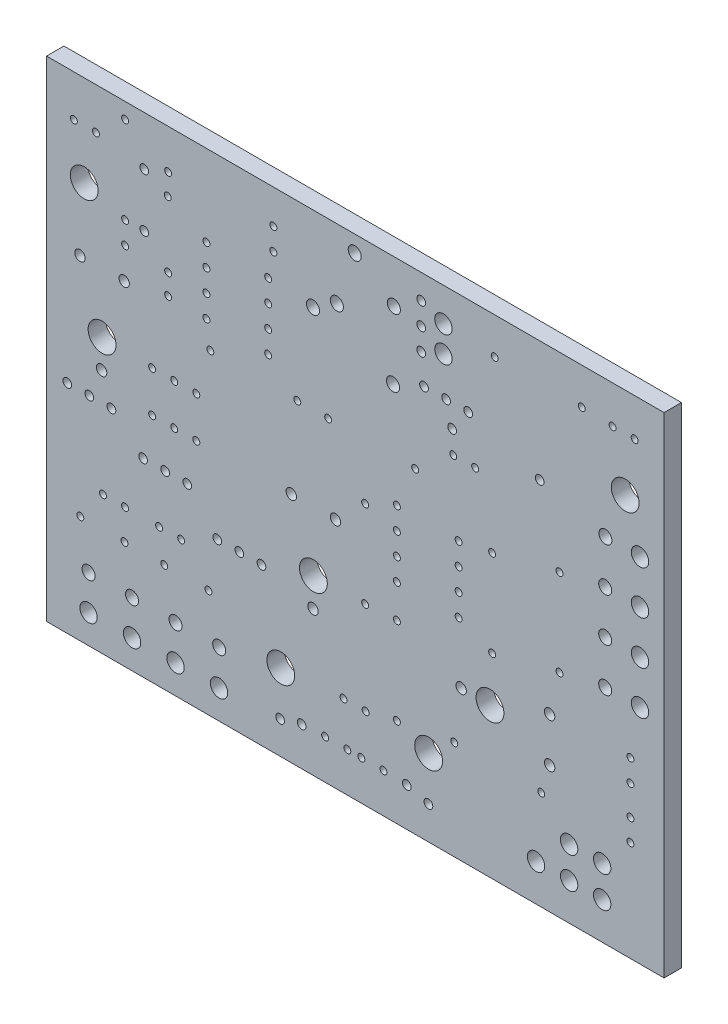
ISO-10303-21;
HEADER;
FILE_DESCRIPTION(('STEP AP214'),'2;1');
FILE_NAME('part.step','',(''),(''),'','','');
FILE_SCHEMA(('AUTOMOTIVE_DESIGN { 1 0 10303 214 1 1 1 1 }'));
ENDSEC;
DATA;
#1=APPLICATION_CONTEXT('core data for automotive mechanical design processes');
#2=APPLICATION_PROTOCOL_DEFINITION('international standard','automotive_design',2000,#1);
#3=PRODUCT_CONTEXT('',#1,'mechanical');
#4=PRODUCT('Part','Part','',(#3));
#5=PRODUCT_RELATED_PRODUCT_CATEGORY('part','',(#4));
#6=PRODUCT_DEFINITION_FORMATION('','',#4);
#7=PRODUCT_DEFINITION_CONTEXT('part definition',#1,'design');
#8=PRODUCT_DEFINITION('design','',#6,#7);
#9=PRODUCT_DEFINITION_SHAPE('','',#8);
#10=(LENGTH_UNIT() NAMED_UNIT(*) SI_UNIT(.MILLI.,.METRE.));
#11=(NAMED_UNIT(*) PLANE_ANGLE_UNIT() SI_UNIT($,.RADIAN.));
#12=(NAMED_UNIT(*) SI_UNIT($,.STERADIAN.) SOLID_ANGLE_UNIT());
#13=UNCERTAINTY_MEASURE_WITH_UNIT(LENGTH_MEASURE(1.E-05),#10,'distance_accuracy_value','');
#14=(GEOMETRIC_REPRESENTATION_CONTEXT(3) GLOBAL_UNCERTAINTY_ASSIGNED_CONTEXT((#13)) GLOBAL_UNIT_ASSIGNED_CONTEXT((#10,
#11,#12)) REPRESENTATION_CONTEXT('',''));
#15=CARTESIAN_POINT('',(0.,0.,0.));
#16=DIRECTION('',(0.,0.,1.));
#17=DIRECTION('',(1.,0.,0.));
#18=AXIS2_PLACEMENT_3D('',#15,#16,#17);
#19=CARTESIAN_POINT('',(0.,0.,2.));
#20=DIRECTION('',(1.,0.,0.));
#21=DIRECTION('',(0.,1.,0.));
#22=AXIS2_PLACEMENT_3D('',#19,#20,#21);
#23=PLANE('',#22);
#24=DIRECTION('',(0.,-1.,0.));
#25=VECTOR('',#24,1.);
#26=CARTESIAN_POINT('',(0.,0.,0.));
#27=LINE('',#26,#25);
#28=CARTESIAN_POINT('',(0.,0.,0.));
#29=VERTEX_POINT('',#28);
#30=CARTESIAN_POINT('',(0.,-56.3,0.));
#31=VERTEX_POINT('',#30);
#32=EDGE_CURVE('E71',#29,#31,#27,.T.);
#33=ORIENTED_EDGE('',*,*,#32,.T.);
#34=DIRECTION('',(0.,0.,-1.));
#35=VECTOR('',#34,1.);
#36=CARTESIAN_POINT('',(0.,-56.3,2.));
#37=LINE('',#36,#35);
#38=CARTESIAN_POINT('',(0.,-56.3,2.));
#39=VERTEX_POINT('',#38);
#40=EDGE_CURVE('E11',#39,#31,#37,.T.);
#41=ORIENTED_EDGE('',*,*,#40,.F.);
#42=DIRECTION('',(0.,-1.,0.));
#43=VECTOR('',#42,1.);
#44=CARTESIAN_POINT('',(0.,0.,2.));
#45=LINE('',#44,#43);
#46=CARTESIAN_POINT('',(0.,0.,2.));
#47=VERTEX_POINT('',#46);
#48=EDGE_CURVE('E94',#47,#39,#45,.T.);
#49=ORIENTED_EDGE('',*,*,#48,.F.);
#50=DIRECTION('',(0.,0.,-1.));
#51=VECTOR('',#50,1.);
#52=CARTESIAN_POINT('',(0.,0.,2.));
#53=LINE('',#52,#51);
#54=EDGE_CURVE('E83',#47,#29,#53,.T.);
#55=ORIENTED_EDGE('',*,*,#54,.T.);
#56=EDGE_LOOP('',(#33,#41,#49,#55));
#57=FACE_BOUND('',#56,.T.);
#58=ADVANCED_FACE('F27',(#57),#23,.F.);
#59=CARTESIAN_POINT('',(0.,-56.3,2.));
#60=DIRECTION('',(0.,1.,0.));
#61=DIRECTION('',(0.,0.,1.));
#62=AXIS2_PLACEMENT_3D('',#59,#60,#61);
#63=PLANE('',#62);
#64=DIRECTION('',(1.,0.,0.));
#65=VECTOR('',#64,1.);
#66=CARTESIAN_POINT('',(0.,-56.3,0.));
#67=LINE('',#66,#65);
#68=CARTESIAN_POINT('',(71.,-56.3,0.));
#69=VERTEX_POINT('',#68);
#70=EDGE_CURVE('E67',#31,#69,#67,.T.);
#71=ORIENTED_EDGE('',*,*,#70,.T.);
#72=DIRECTION('',(0.,0.,-1.));
#73=VECTOR('',#72,1.);
#74=CARTESIAN_POINT('',(71.,-56.3,2.));
#75=LINE('',#74,#73);
#76=CARTESIAN_POINT('',(71.,-56.3,2.));
#77=VERTEX_POINT('',#76);
#78=EDGE_CURVE('E34',#77,#69,#75,.T.);
#79=ORIENTED_EDGE('',*,*,#78,.F.);
#80=DIRECTION('',(1.,0.,0.));
#81=VECTOR('',#80,1.);
#82=CARTESIAN_POINT('',(0.,-56.3,2.));
#83=LINE('',#82,#81);
#84=EDGE_CURVE('E79',#39,#77,#83,.T.);
#85=ORIENTED_EDGE('',*,*,#84,.F.);
#86=ORIENTED_EDGE('',*,*,#40,.T.);
#87=EDGE_LOOP('',(#71,#79,#85,#86));
#88=FACE_BOUND('',#87,.T.);
#89=ADVANCED_FACE('F78',(#88),#63,.F.);
#90=CARTESIAN_POINT('',(71.,0.,2.));
#91=DIRECTION('',(-1.,0.,0.));
#92=DIRECTION('',(0.,0.,1.));
#93=AXIS2_PLACEMENT_3D('',#90,#91,#92);
#94=PLANE('',#93);
#95=DIRECTION('',(0.,1.,0.));
#96=VECTOR('',#95,1.);
#97=CARTESIAN_POINT('',(71.,0.,0.));
#98=LINE('',#97,#96);
#99=CARTESIAN_POINT('',(71.,0.,0.));
#100=VERTEX_POINT('',#99);
#101=EDGE_CURVE('E72',#69,#100,#98,.T.);
#102=ORIENTED_EDGE('',*,*,#101,.T.);
#103=DIRECTION('',(0.,0.,-1.));
#104=VECTOR('',#103,1.);
#105=CARTESIAN_POINT('',(71.,0.,2.));
#106=LINE('',#105,#104);
#107=CARTESIAN_POINT('',(71.,0.,2.));
#108=VERTEX_POINT('',#107);
#109=EDGE_CURVE('E100',#108,#100,#106,.T.);
#110=ORIENTED_EDGE('',*,*,#109,.F.);
#111=DIRECTION('',(0.,1.,0.));
#112=VECTOR('',#111,1.);
#113=CARTESIAN_POINT('',(71.,0.,2.));
#114=LINE('',#113,#112);
#115=EDGE_CURVE('E46',#77,#108,#114,.T.);
#116=ORIENTED_EDGE('',*,*,#115,.F.);
#117=ORIENTED_EDGE('',*,*,#78,.T.);
#118=EDGE_LOOP('',(#102,#110,#116,#117));
#119=FACE_BOUND('',#118,.T.);
#120=ADVANCED_FACE('F103',(#119),#94,.F.);
#121=CARTESIAN_POINT('',(0.,0.,2.));
#122=DIRECTION('',(0.,-1.,0.));
#123=DIRECTION('',(0.,0.,-1.));
#124=AXIS2_PLACEMENT_3D('',#121,#122,#123);
#125=PLANE('',#124);
#126=DIRECTION('',(-1.,0.,0.));
#127=VECTOR('',#126,1.);
#128=CARTESIAN_POINT('',(0.,0.,0.));
#129=LINE('',#128,#127);
#130=EDGE_CURVE('E92',#100,#29,#129,.T.);
#131=ORIENTED_EDGE('',*,*,#130,.T.);
#132=ORIENTED_EDGE('',*,*,#54,.F.);
#133=DIRECTION('',(-1.,0.,0.));
#134=VECTOR('',#133,1.);
#135=CARTESIAN_POINT('',(0.,0.,2.));
#136=LINE('',#135,#134);
#137=EDGE_CURVE('E41',#108,#47,#136,.T.);
#138=ORIENTED_EDGE('',*,*,#137,.F.);
#139=ORIENTED_EDGE('',*,*,#109,.T.);
#140=EDGE_LOOP('',(#131,#132,#138,#139));
#141=FACE_BOUND('',#140,.T.);
#142=ADVANCED_FACE('F105',(#141),#125,.F.);
#143=CARTESIAN_POINT('',(0.,-56.3,2.));
#144=DIRECTION('',(0.,0.,1.));
#145=DIRECTION('',(1.,0.,0.));
#146=AXIS2_PLACEMENT_3D('',#143,#144,#145);
#147=PLANE('',#146);
#148=CARTESIAN_POINT('',(45.631675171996,-3.85064,2.));
#149=DIRECTION('',(0.,0.,-1.));
#150=DIRECTION('',(-1.,0.,0.));
#151=AXIS2_PLACEMENT_3D('',#148,#149,#150);
#152=CIRCLE('',#151,1.00076);
#153=CARTESIAN_POINT('',(44.630915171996,-3.85064,2.));
#154=VERTEX_POINT('',#153);
#155=EDGE_CURVE('E1247',#154,#154,#152,.T.);
#156=ORIENTED_EDGE('',*,*,#155,.T.);
#157=EDGE_LOOP('',(#156));
#158=FACE_BOUND('',#157,.T.);
#159=CARTESIAN_POINT('',(46.761975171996,-16.34998,2.));
#160=DIRECTION('',(0.,0.,-1.));
#161=DIRECTION('',(-1.,0.,0.));
#162=AXIS2_PLACEMENT_3D('',#159,#160,#161);
#163=CIRCLE('',#162,0.398780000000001);
#164=CARTESIAN_POINT('',(46.363195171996,-16.34998,2.));
#165=VERTEX_POINT('',#164);
#166=EDGE_CURVE('E1257',#165,#165,#163,.T.);
#167=ORIENTED_EDGE('',*,*,#166,.T.);
#168=EDGE_LOOP('',(#167));
#169=FACE_BOUND('',#168,.T.);
#170=CARTESIAN_POINT('',(49.281655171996,-16.34998,2.));
#171=DIRECTION('',(0.,0.,-1.));
#172=DIRECTION('',(-1.,0.,0.));
#173=AXIS2_PLACEMENT_3D('',#170,#171,#172);
#174=CIRCLE('',#173,0.398780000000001);
#175=CARTESIAN_POINT('',(48.882875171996,-16.34998,2.));
#176=VERTEX_POINT('',#175);
#177=EDGE_CURVE('E1263',#176,#176,#174,.T.);
#178=ORIENTED_EDGE('',*,*,#177,.T.);
#179=EDGE_LOOP('',(#178));
#180=FACE_BOUND('',#179,.T.);
#181=CARTESIAN_POINT('',(45.631675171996,-6.85038,2.));
#182=DIRECTION('',(0.,0.,-1.));
#183=DIRECTION('',(-1.,0.,0.));
#184=AXIS2_PLACEMENT_3D('',#181,#182,#183);
#185=CIRCLE('',#184,1.00076);
#186=CARTESIAN_POINT('',(44.630915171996,-6.85038,2.));
#187=VERTEX_POINT('',#186);
#188=EDGE_CURVE('E1269',#187,#187,#185,.T.);
#189=ORIENTED_EDGE('',*,*,#188,.T.);
#190=EDGE_LOOP('',(#189));
#191=FACE_BOUND('',#190,.T.);
#192=CARTESIAN_POINT('',(43.0815151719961,-5.36194,2.));
#193=DIRECTION('',(0.,0.,-1.));
#194=DIRECTION('',(-1.,0.,0.));
#195=AXIS2_PLACEMENT_3D('',#192,#193,#194);
#196=CIRCLE('',#195,0.500380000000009);
#197=CARTESIAN_POINT('',(42.581135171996,-5.36194,2.));
#198=VERTEX_POINT('',#197);
#199=EDGE_CURVE('E1275',#198,#198,#196,.T.);
#200=ORIENTED_EDGE('',*,*,#199,.T.);
#201=EDGE_LOOP('',(#200));
#202=FACE_BOUND('',#201,.T.);
#203=CARTESIAN_POINT('',(43.0815151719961,-2.82194,2.));
#204=DIRECTION('',(0.,0.,-1.));
#205=DIRECTION('',(-1.,0.,0.));
#206=AXIS2_PLACEMENT_3D('',#203,#204,#205);
#207=CIRCLE('',#206,0.500380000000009);
#208=CARTESIAN_POINT('',(42.581135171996,-2.82194,2.));
#209=VERTEX_POINT('',#208);
#210=EDGE_CURVE('E1281',#209,#209,#207,.T.);
#211=ORIENTED_EDGE('',*,*,#210,.T.);
#212=EDGE_LOOP('',(#211));
#213=FACE_BOUND('',#212,.T.);
#214=CARTESIAN_POINT('',(43.0815151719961,-7.90194,2.));
#215=DIRECTION('',(0.,0.,-1.));
#216=DIRECTION('',(-1.,0.,0.));
#217=AXIS2_PLACEMENT_3D('',#214,#215,#216);
#218=CIRCLE('',#217,0.500380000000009);
#219=CARTESIAN_POINT('',(42.581135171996,-7.90194,2.));
#220=VERTEX_POINT('',#219);
#221=EDGE_CURVE('E1287',#220,#220,#218,.T.);
#222=ORIENTED_EDGE('',*,*,#221,.T.);
#223=EDGE_LOOP('',(#222));
#224=FACE_BOUND('',#223,.T.);
#225=CARTESIAN_POINT('',(45.941555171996,-11.2014,2.));
#226=DIRECTION('',(0.,0.,-1.));
#227=DIRECTION('',(-1.,0.,0.));
#228=AXIS2_PLACEMENT_3D('',#225,#226,#227);
#229=CIRCLE('',#228,0.500379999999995);
#230=CARTESIAN_POINT('',(45.4411751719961,-11.2014,2.));
#231=VERTEX_POINT('',#230);
#232=EDGE_CURVE('E1293',#231,#231,#229,.T.);
#233=ORIENTED_EDGE('',*,*,#232,.T.);
#234=EDGE_LOOP('',(#233));
#235=FACE_BOUND('',#234,.T.);
#236=CARTESIAN_POINT('',(43.401555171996,-11.2014,2.));
#237=DIRECTION('',(0.,0.,-1.));
#238=DIRECTION('',(-1.,0.,0.));
#239=AXIS2_PLACEMENT_3D('',#236,#237,#238);
#240=CIRCLE('',#239,0.500379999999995);
#241=CARTESIAN_POINT('',(42.9011751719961,-11.2014,2.));
#242=VERTEX_POINT('',#241);
#243=EDGE_CURVE('E1299',#242,#242,#240,.T.);
#244=ORIENTED_EDGE('',*,*,#243,.T.);
#245=EDGE_LOOP('',(#244));
#246=FACE_BOUND('',#245,.T.);
#247=CARTESIAN_POINT('',(48.481555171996,-11.2014,2.));
#248=DIRECTION('',(0.,0.,-1.));
#249=DIRECTION('',(-1.,0.,0.));
#250=AXIS2_PLACEMENT_3D('',#247,#248,#249);
#251=CIRCLE('',#250,0.500379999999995);
#252=CARTESIAN_POINT('',(47.981175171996,-11.2014,2.));
#253=VERTEX_POINT('',#252);
#254=EDGE_CURVE('E1305',#253,#253,#251,.T.);
#255=ORIENTED_EDGE('',*,*,#254,.T.);
#256=EDGE_LOOP('',(#255));
#257=FACE_BOUND('',#256,.T.);
#258=CARTESIAN_POINT('',(18.3825551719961,-14.42974,2.));
#259=DIRECTION('',(0.,0.,-1.));
#260=DIRECTION('',(-1.,0.,0.));
#261=AXIS2_PLACEMENT_3D('',#258,#259,#260);
#262=CIRCLE('',#261,0.398780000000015);
#263=CARTESIAN_POINT('',(17.983775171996,-14.42974,2.));
#264=VERTEX_POINT('',#263);
#265=EDGE_CURVE('E1311',#264,#264,#262,.T.);
#266=ORIENTED_EDGE('',*,*,#265,.T.);
#267=EDGE_LOOP('',(#266));
#268=FACE_BOUND('',#267,.T.);
#269=CARTESIAN_POINT('',(18.3825551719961,-11.88974,2.));
#270=DIRECTION('',(0.,0.,-1.));
#271=DIRECTION('',(-1.,0.,0.));
#272=AXIS2_PLACEMENT_3D('',#269,#270,#271);
#273=CIRCLE('',#272,0.398780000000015);
#274=CARTESIAN_POINT('',(17.983775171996,-11.88974,2.));
#275=VERTEX_POINT('',#274);
#276=EDGE_CURVE('E1317',#275,#275,#273,.T.);
#277=ORIENTED_EDGE('',*,*,#276,.T.);
#278=EDGE_LOOP('',(#277));
#279=FACE_BOUND('',#278,.T.);
#280=CARTESIAN_POINT('',(18.3825551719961,-16.96974,2.));
#281=DIRECTION('',(0.,0.,-1.));
#282=DIRECTION('',(-1.,0.,0.));
#283=AXIS2_PLACEMENT_3D('',#280,#281,#282);
#284=CIRCLE('',#283,0.398780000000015);
#285=CARTESIAN_POINT('',(17.983775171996,-16.96974,2.));
#286=VERTEX_POINT('',#285);
#287=EDGE_CURVE('E1323',#286,#286,#284,.T.);
#288=ORIENTED_EDGE('',*,*,#287,.T.);
#289=EDGE_LOOP('',(#288));
#290=FACE_BOUND('',#289,.T.);
#291=CARTESIAN_POINT('',(18.3825551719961,-9.34974,2.));
#292=DIRECTION('',(0.,0.,-1.));
#293=DIRECTION('',(-1.,0.,0.));
#294=AXIS2_PLACEMENT_3D('',#291,#292,#293);
#295=CIRCLE('',#294,0.398780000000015);
#296=CARTESIAN_POINT('',(17.983775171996,-9.34974,2.));
#297=VERTEX_POINT('',#296);
#298=EDGE_CURVE('E1329',#297,#297,#295,.T.);
#299=ORIENTED_EDGE('',*,*,#298,.T.);
#300=EDGE_LOOP('',(#299));
#301=FACE_BOUND('',#300,.T.);
#302=CARTESIAN_POINT('',(25.4818551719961,-14.42974,2.));
#303=DIRECTION('',(0.,0.,-1.));
#304=DIRECTION('',(-1.,0.,0.));
#305=AXIS2_PLACEMENT_3D('',#302,#303,#304);
#306=CIRCLE('',#305,0.398780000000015);
#307=CARTESIAN_POINT('',(25.083075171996,-14.42974,2.));
#308=VERTEX_POINT('',#307);
#309=EDGE_CURVE('E1335',#308,#308,#306,.T.);
#310=ORIENTED_EDGE('',*,*,#309,.T.);
#311=EDGE_LOOP('',(#310));
#312=FACE_BOUND('',#311,.T.);
#313=CARTESIAN_POINT('',(25.4818551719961,-11.88974,2.));
#314=DIRECTION('',(0.,0.,-1.));
#315=DIRECTION('',(-1.,0.,0.));
#316=AXIS2_PLACEMENT_3D('',#313,#314,#315);
#317=CIRCLE('',#316,0.398780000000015);
#318=CARTESIAN_POINT('',(25.083075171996,-11.88974,2.));
#319=VERTEX_POINT('',#318);
#320=EDGE_CURVE('E1341',#319,#319,#317,.T.);
#321=ORIENTED_EDGE('',*,*,#320,.T.);
#322=EDGE_LOOP('',(#321));
#323=FACE_BOUND('',#322,.T.);
#324=CARTESIAN_POINT('',(25.4818551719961,-16.96974,2.));
#325=DIRECTION('',(0.,0.,-1.));
#326=DIRECTION('',(-1.,0.,0.));
#327=AXIS2_PLACEMENT_3D('',#324,#325,#326);
#328=CIRCLE('',#327,0.398780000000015);
#329=CARTESIAN_POINT('',(25.083075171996,-16.96974,2.));
#330=VERTEX_POINT('',#329);
#331=EDGE_CURVE('E1347',#330,#330,#328,.T.);
#332=ORIENTED_EDGE('',*,*,#331,.T.);
#333=EDGE_LOOP('',(#332));
#334=FACE_BOUND('',#333,.T.);
#335=CARTESIAN_POINT('',(40.282435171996,-29.6799,2.));
#336=DIRECTION('',(0.,0.,-1.));
#337=DIRECTION('',(-1.,0.,0.));
#338=AXIS2_PLACEMENT_3D('',#335,#336,#337);
#339=CIRCLE('',#338,0.398780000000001);
#340=CARTESIAN_POINT('',(39.883655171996,-29.6799,2.));
#341=VERTEX_POINT('',#340);
#342=EDGE_CURVE('E1353',#341,#341,#339,.T.);
#343=ORIENTED_EDGE('',*,*,#342,.T.);
#344=EDGE_LOOP('',(#343));
#345=FACE_BOUND('',#344,.T.);
#346=CARTESIAN_POINT('',(40.282435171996,-27.1399,2.));
#347=DIRECTION('',(0.,0.,-1.));
#348=DIRECTION('',(-1.,0.,0.));
#349=AXIS2_PLACEMENT_3D('',#346,#347,#348);
#350=CIRCLE('',#349,0.398780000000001);
#351=CARTESIAN_POINT('',(39.883655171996,-27.1399,2.));
#352=VERTEX_POINT('',#351);
#353=EDGE_CURVE('E1359',#352,#352,#350,.T.);
#354=ORIENTED_EDGE('',*,*,#353,.T.);
#355=EDGE_LOOP('',(#354));
#356=FACE_BOUND('',#355,.T.);
#357=CARTESIAN_POINT('',(40.282435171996,-32.2199,2.));
#358=DIRECTION('',(0.,0.,-1.));
#359=DIRECTION('',(-1.,0.,0.));
#360=AXIS2_PLACEMENT_3D('',#357,#358,#359);
#361=CIRCLE('',#360,0.398780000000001);
#362=CARTESIAN_POINT('',(39.883655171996,-32.2199,2.));
#363=VERTEX_POINT('',#362);
#364=EDGE_CURVE('E1365',#363,#363,#361,.T.);
#365=ORIENTED_EDGE('',*,*,#364,.T.);
#366=EDGE_LOOP('',(#365));
#367=FACE_BOUND('',#366,.T.);
#368=CARTESIAN_POINT('',(40.282435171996,-24.5999,2.));
#369=DIRECTION('',(0.,0.,-1.));
#370=DIRECTION('',(-1.,0.,0.));
#371=AXIS2_PLACEMENT_3D('',#368,#369,#370);
#372=CIRCLE('',#371,0.398780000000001);
#373=CARTESIAN_POINT('',(39.883655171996,-24.5999,2.));
#374=VERTEX_POINT('',#373);
#375=EDGE_CURVE('E1371',#374,#374,#372,.T.);
#376=ORIENTED_EDGE('',*,*,#375,.T.);
#377=EDGE_LOOP('',(#376));
#378=FACE_BOUND('',#377,.T.);
#379=CARTESIAN_POINT('',(47.381735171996,-29.6799,2.));
#380=DIRECTION('',(0.,0.,-1.));
#381=DIRECTION('',(-1.,0.,0.));
#382=AXIS2_PLACEMENT_3D('',#379,#380,#381);
#383=CIRCLE('',#382,0.398780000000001);
#384=CARTESIAN_POINT('',(46.982955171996,-29.6799,2.));
#385=VERTEX_POINT('',#384);
#386=EDGE_CURVE('E1377',#385,#385,#383,.T.);
#387=ORIENTED_EDGE('',*,*,#386,.T.);
#388=EDGE_LOOP('',(#387));
#389=FACE_BOUND('',#388,.T.);
#390=CARTESIAN_POINT('',(47.381735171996,-27.1399,2.));
#391=DIRECTION('',(0.,0.,-1.));
#392=DIRECTION('',(-1.,0.,0.));
#393=AXIS2_PLACEMENT_3D('',#390,#391,#392);
#394=CIRCLE('',#393,0.398780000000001);
#395=CARTESIAN_POINT('',(46.982955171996,-27.1399,2.));
#396=VERTEX_POINT('',#395);
#397=EDGE_CURVE('E1383',#396,#396,#394,.T.);
#398=ORIENTED_EDGE('',*,*,#397,.T.);
#399=EDGE_LOOP('',(#398));
#400=FACE_BOUND('',#399,.T.);
#401=CARTESIAN_POINT('',(47.381735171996,-32.2199,2.));
#402=DIRECTION('',(0.,0.,-1.));
#403=DIRECTION('',(-1.,0.,0.));
#404=AXIS2_PLACEMENT_3D('',#401,#402,#403);
#405=CIRCLE('',#404,0.398780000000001);
#406=CARTESIAN_POINT('',(46.982955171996,-32.2199,2.));
#407=VERTEX_POINT('',#406);
#408=EDGE_CURVE('E1389',#407,#407,#405,.T.);
#409=ORIENTED_EDGE('',*,*,#408,.T.);
#410=EDGE_LOOP('',(#409));
#411=FACE_BOUND('',#410,.T.);
#412=CARTESIAN_POINT('',(47.381735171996,-24.5999,2.));
#413=DIRECTION('',(0.,0.,-1.));
#414=DIRECTION('',(-1.,0.,0.));
#415=AXIS2_PLACEMENT_3D('',#412,#413,#414);
#416=CIRCLE('',#415,0.398780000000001);
#417=CARTESIAN_POINT('',(46.982955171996,-24.5999,2.));
#418=VERTEX_POINT('',#417);
#419=EDGE_CURVE('E1395',#418,#418,#416,.T.);
#420=ORIENTED_EDGE('',*,*,#419,.T.);
#421=EDGE_LOOP('',(#420));
#422=FACE_BOUND('',#421,.T.);
#423=CARTESIAN_POINT('',(30.6812351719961,-36.40074,2.));
#424=DIRECTION('',(0.,0.,-1.));
#425=DIRECTION('',(-1.,0.,0.));
#426=AXIS2_PLACEMENT_3D('',#423,#424,#425);
#427=CIRCLE('',#426,1.60020000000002);
#428=CARTESIAN_POINT('',(29.081035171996,-36.40074,2.));
#429=VERTEX_POINT('',#428);
#430=EDGE_CURVE('E1401',#429,#429,#427,.T.);
#431=ORIENTED_EDGE('',*,*,#430,.T.);
#432=EDGE_LOOP('',(#431));
#433=FACE_BOUND('',#432,.T.);
#434=CARTESIAN_POINT('',(30.632975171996,-39.71036,2.));
#435=DIRECTION('',(0.,0.,-1.));
#436=DIRECTION('',(-1.,0.,0.));
#437=AXIS2_PLACEMENT_3D('',#434,#435,#436);
#438=CIRCLE('',#437,0.599439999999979);
#439=CARTESIAN_POINT('',(30.0335351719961,-39.71036,2.));
#440=VERTEX_POINT('',#439);
#441=EDGE_CURVE('E1407',#440,#440,#438,.T.);
#442=ORIENTED_EDGE('',*,*,#441,.T.);
#443=EDGE_LOOP('',(#442));
#444=FACE_BOUND('',#443,.T.);
#445=CARTESIAN_POINT('',(33.221235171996,-29.5402,2.));
#446=DIRECTION('',(0.,0.,-1.));
#447=DIRECTION('',(-1.,0.,0.));
#448=AXIS2_PLACEMENT_3D('',#445,#446,#447);
#449=CIRCLE('',#448,0.599440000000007);
#450=CARTESIAN_POINT('',(32.621795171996,-29.5402,2.));
#451=VERTEX_POINT('',#450);
#452=EDGE_CURVE('E1413',#451,#451,#449,.T.);
#453=ORIENTED_EDGE('',*,*,#452,.T.);
#454=EDGE_LOOP('',(#453));
#455=FACE_BOUND('',#454,.T.);
#456=CARTESIAN_POINT('',(28.141235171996,-29.5402,2.));
#457=DIRECTION('',(0.,0.,-1.));
#458=DIRECTION('',(-1.,0.,0.));
#459=AXIS2_PLACEMENT_3D('',#456,#457,#458);
#460=CIRCLE('',#459,0.599440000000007);
#461=CARTESIAN_POINT('',(27.541795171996,-29.5402,2.));
#462=VERTEX_POINT('',#461);
#463=EDGE_CURVE('E1419',#462,#462,#460,.T.);
#464=ORIENTED_EDGE('',*,*,#463,.T.);
#465=EDGE_LOOP('',(#464));
#466=FACE_BOUND('',#465,.T.);
#467=CARTESIAN_POINT('',(7.46309517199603,-31.35122,2.));
#468=DIRECTION('',(0.,0.,-1.));
#469=DIRECTION('',(-1.,0.,0.));
#470=AXIS2_PLACEMENT_3D('',#467,#468,#469);
#471=CIRCLE('',#470,0.500379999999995);
#472=CARTESIAN_POINT('',(6.96271517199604,-31.35122,2.));
#473=VERTEX_POINT('',#472);
#474=EDGE_CURVE('E1425',#473,#473,#471,.T.);
#475=ORIENTED_EDGE('',*,*,#474,.T.);
#476=EDGE_LOOP('',(#475));
#477=FACE_BOUND('',#476,.T.);
#478=CARTESIAN_POINT('',(4.92309517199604,-31.35122,2.));
#479=DIRECTION('',(0.,0.,-1.));
#480=DIRECTION('',(-1.,0.,0.));
#481=AXIS2_PLACEMENT_3D('',#478,#479,#480);
#482=CIRCLE('',#481,0.500379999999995);
#483=CARTESIAN_POINT('',(4.42271517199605,-31.35122,2.));
#484=VERTEX_POINT('',#483);
#485=EDGE_CURVE('E1431',#484,#484,#482,.T.);
#486=ORIENTED_EDGE('',*,*,#485,.T.);
#487=EDGE_LOOP('',(#486));
#488=FACE_BOUND('',#487,.T.);
#489=CARTESIAN_POINT('',(2.38309517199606,-31.35122,2.));
#490=DIRECTION('',(0.,0.,-1.));
#491=DIRECTION('',(-1.,0.,0.));
#492=AXIS2_PLACEMENT_3D('',#489,#490,#491);
#493=CIRCLE('',#492,0.500379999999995);
#494=CARTESIAN_POINT('',(1.88271517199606,-31.35122,2.));
#495=VERTEX_POINT('',#494);
#496=EDGE_CURVE('E1437',#495,#495,#493,.T.);
#497=ORIENTED_EDGE('',*,*,#496,.T.);
#498=EDGE_LOOP('',(#497));
#499=FACE_BOUND('',#498,.T.);
#500=CARTESIAN_POINT('',(12.1417751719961,-29.70022,2.));
#501=DIRECTION('',(0.,0.,-1.));
#502=DIRECTION('',(-1.,0.,0.));
#503=AXIS2_PLACEMENT_3D('',#500,#501,#502);
#504=CIRCLE('',#503,0.398780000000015);
#505=CARTESIAN_POINT('',(11.742995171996,-29.70022,2.));
#506=VERTEX_POINT('',#505);
#507=EDGE_CURVE('E1443',#506,#506,#504,.T.);
#508=ORIENTED_EDGE('',*,*,#507,.T.);
#509=EDGE_LOOP('',(#508));
#510=FACE_BOUND('',#509,.T.);
#511=CARTESIAN_POINT('',(14.681775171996,-29.70022,2.));
#512=DIRECTION('',(0.,0.,-1.));
#513=DIRECTION('',(-1.,0.,0.));
#514=AXIS2_PLACEMENT_3D('',#511,#512,#513);
#515=CIRCLE('',#514,0.398779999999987);
#516=CARTESIAN_POINT('',(14.282995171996,-29.70022,2.));
#517=VERTEX_POINT('',#516);
#518=EDGE_CURVE('E1449',#517,#517,#515,.T.);
#519=ORIENTED_EDGE('',*,*,#518,.T.);
#520=EDGE_LOOP('',(#519));
#521=FACE_BOUND('',#520,.T.);
#522=CARTESIAN_POINT('',(17.2217751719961,-29.70022,2.));
#523=DIRECTION('',(0.,0.,-1.));
#524=DIRECTION('',(-1.,0.,0.));
#525=AXIS2_PLACEMENT_3D('',#522,#523,#524);
#526=CIRCLE('',#525,0.398779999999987);
#527=CARTESIAN_POINT('',(16.8229951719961,-29.70022,2.));
#528=VERTEX_POINT('',#527);
#529=EDGE_CURVE('E1455',#528,#528,#526,.T.);
#530=ORIENTED_EDGE('',*,*,#529,.T.);
#531=EDGE_LOOP('',(#530));
#532=FACE_BOUND('',#531,.T.);
#533=CARTESIAN_POINT('',(9.03281517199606,-14.34084,2.));
#534=DIRECTION('',(0.,0.,-1.));
#535=DIRECTION('',(-1.,0.,0.));
#536=AXIS2_PLACEMENT_3D('',#533,#534,#535);
#537=CIRCLE('',#536,0.398780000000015);
#538=CARTESIAN_POINT('',(8.63403517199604,-14.34084,2.));
#539=VERTEX_POINT('',#538);
#540=EDGE_CURVE('E1461',#539,#539,#537,.T.);
#541=ORIENTED_EDGE('',*,*,#540,.T.);
#542=EDGE_LOOP('',(#541));
#543=FACE_BOUND('',#542,.T.);
#544=CARTESIAN_POINT('',(9.03281517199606,-1.80086,2.));
#545=DIRECTION('',(0.,0.,-1.));
#546=DIRECTION('',(-1.,0.,0.));
#547=AXIS2_PLACEMENT_3D('',#544,#545,#546);
#548=CIRCLE('',#547,0.398780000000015);
#549=CARTESIAN_POINT('',(8.63403517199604,-1.80086,2.));
#550=VERTEX_POINT('',#549);
#551=EDGE_CURVE('E1467',#550,#550,#548,.T.);
#552=ORIENTED_EDGE('',*,*,#551,.T.);
#553=EDGE_LOOP('',(#552));
#554=FACE_BOUND('',#553,.T.);
#555=CARTESIAN_POINT('',(9.03281517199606,-11.80084,2.));
#556=DIRECTION('',(0.,0.,-1.));
#557=DIRECTION('',(-1.,0.,0.));
#558=AXIS2_PLACEMENT_3D('',#555,#556,#557);
#559=CIRCLE('',#558,0.398780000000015);
#560=CARTESIAN_POINT('',(8.63403517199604,-11.80084,2.));
#561=VERTEX_POINT('',#560);
#562=EDGE_CURVE('E1473',#561,#561,#559,.T.);
#563=ORIENTED_EDGE('',*,*,#562,.T.);
#564=EDGE_LOOP('',(#563));
#565=FACE_BOUND('',#564,.T.);
#566=CARTESIAN_POINT('',(33.381255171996,-7.9502,2.));
#567=DIRECTION('',(0.,0.,-1.));
#568=DIRECTION('',(-1.,0.,0.));
#569=AXIS2_PLACEMENT_3D('',#566,#567,#568);
#570=CIRCLE('',#569,0.749299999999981);
#571=CARTESIAN_POINT('',(32.631955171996,-7.9502,2.));
#572=VERTEX_POINT('',#571);
#573=EDGE_CURVE('E1479',#572,#572,#570,.T.);
#574=ORIENTED_EDGE('',*,*,#573,.T.);
#575=EDGE_LOOP('',(#574));
#576=FACE_BOUND('',#575,.T.);
#577=CARTESIAN_POINT('',(30.632975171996,-9.70026,2.));
#578=DIRECTION('',(0.,0.,-1.));
#579=DIRECTION('',(-1.,0.,0.));
#580=AXIS2_PLACEMENT_3D('',#577,#578,#579);
#581=CIRCLE('',#580,0.749299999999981);
#582=CARTESIAN_POINT('',(29.8836751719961,-9.70026,2.));
#583=VERTEX_POINT('',#582);
#584=EDGE_CURVE('E1485',#583,#583,#581,.T.);
#585=ORIENTED_EDGE('',*,*,#584,.T.);
#586=EDGE_LOOP('',(#585));
#587=FACE_BOUND('',#586,.T.);
#588=CARTESIAN_POINT('',(39.8328551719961,-12.7508,2.));
#589=DIRECTION('',(0.,0.,-1.));
#590=DIRECTION('',(-1.,0.,0.));
#591=AXIS2_PLACEMENT_3D('',#588,#589,#590);
#592=CIRCLE('',#591,0.749300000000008);
#593=CARTESIAN_POINT('',(39.083555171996,-12.7508,2.));
#594=VERTEX_POINT('',#593);
#595=EDGE_CURVE('E1491',#594,#594,#592,.T.);
#596=ORIENTED_EDGE('',*,*,#595,.T.);
#597=EDGE_LOOP('',(#596));
#598=FACE_BOUND('',#597,.T.);
#599=CARTESIAN_POINT('',(39.931915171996,-4.95046,2.));
#600=DIRECTION('',(0.,0.,-1.));
#601=DIRECTION('',(-1.,0.,0.));
#602=AXIS2_PLACEMENT_3D('',#599,#600,#601);
#603=CIRCLE('',#602,0.749300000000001);
#604=CARTESIAN_POINT('',(39.182615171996,-4.95046,2.));
#605=VERTEX_POINT('',#604);
#606=EDGE_CURVE('E1497',#605,#605,#603,.T.);
#607=ORIENTED_EDGE('',*,*,#606,.T.);
#608=EDGE_LOOP('',(#607));
#609=FACE_BOUND('',#608,.T.);
#610=CARTESIAN_POINT('',(35.433575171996,-1.89992,2.));
#611=DIRECTION('',(0.,0.,-1.));
#612=DIRECTION('',(-1.,0.,0.));
#613=AXIS2_PLACEMENT_3D('',#610,#611,#612);
#614=CIRCLE('',#613,0.749300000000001);
#615=CARTESIAN_POINT('',(34.684275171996,-1.89992,2.));
#616=VERTEX_POINT('',#615);
#617=EDGE_CURVE('E1503',#616,#616,#614,.T.);
#618=ORIENTED_EDGE('',*,*,#617,.T.);
#619=EDGE_LOOP('',(#618));
#620=FACE_BOUND('',#619,.T.);
#621=CARTESIAN_POINT('',(56.281895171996,-52.04968,2.));
#622=DIRECTION('',(0.,0.,-1.));
#623=DIRECTION('',(-1.,0.,0.));
#624=AXIS2_PLACEMENT_3D('',#621,#622,#623);
#625=CIRCLE('',#624,1.00076);
#626=CARTESIAN_POINT('',(55.281135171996,-52.04968,2.));
#627=VERTEX_POINT('',#626);
#628=EDGE_CURVE('E1509',#627,#627,#625,.T.);
#629=ORIENTED_EDGE('',*,*,#628,.T.);
#630=EDGE_LOOP('',(#629));
#631=FACE_BOUND('',#630,.T.);
#632=CARTESIAN_POINT('',(60.081735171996,-52.04968,2.));
#633=DIRECTION('',(0.,0.,-1.));
#634=DIRECTION('',(-1.,0.,0.));
#635=AXIS2_PLACEMENT_3D('',#632,#633,#634);
#636=CIRCLE('',#635,1.00076);
#637=CARTESIAN_POINT('',(59.080975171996,-52.04968,2.));
#638=VERTEX_POINT('',#637);
#639=EDGE_CURVE('E1515',#638,#638,#636,.T.);
#640=ORIENTED_EDGE('',*,*,#639,.T.);
#641=EDGE_LOOP('',(#640));
#642=FACE_BOUND('',#641,.T.);
#643=CARTESIAN_POINT('',(63.8815751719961,-52.04968,2.));
#644=DIRECTION('',(0.,0.,-1.));
#645=DIRECTION('',(-1.,0.,0.));
#646=AXIS2_PLACEMENT_3D('',#643,#644,#645);
#647=CIRCLE('',#646,1.00076000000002);
#648=CARTESIAN_POINT('',(62.880815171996,-52.04968,2.));
#649=VERTEX_POINT('',#648);
#650=EDGE_CURVE('E1521',#649,#649,#647,.T.);
#651=ORIENTED_EDGE('',*,*,#650,.T.);
#652=EDGE_LOOP('',(#651));
#653=FACE_BOUND('',#652,.T.);
#654=CARTESIAN_POINT('',(43.907015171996,-52.50942,2.));
#655=DIRECTION('',(0.,0.,-1.));
#656=DIRECTION('',(-1.,0.,0.));
#657=AXIS2_PLACEMENT_3D('',#654,#655,#656);
#658=CIRCLE('',#657,0.500379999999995);
#659=CARTESIAN_POINT('',(43.4066351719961,-52.50942,2.));
#660=VERTEX_POINT('',#659);
#661=EDGE_CURVE('E1527',#660,#660,#658,.T.);
#662=ORIENTED_EDGE('',*,*,#661,.T.);
#663=EDGE_LOOP('',(#662));
#664=FACE_BOUND('',#663,.T.);
#665=CARTESIAN_POINT('',(41.4228951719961,-51.86934,2.));
#666=DIRECTION('',(0.,0.,-1.));
#667=DIRECTION('',(-1.,0.,0.));
#668=AXIS2_PLACEMENT_3D('',#665,#666,#667);
#669=CIRCLE('',#668,0.500380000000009);
#670=CARTESIAN_POINT('',(40.922515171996,-51.86934,2.));
#671=VERTEX_POINT('',#670);
#672=EDGE_CURVE('E1533',#671,#671,#669,.T.);
#673=ORIENTED_EDGE('',*,*,#672,.T.);
#674=EDGE_LOOP('',(#673));
#675=FACE_BOUND('',#674,.T.);
#676=CARTESIAN_POINT('',(29.335035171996,-51.86934,2.));
#677=DIRECTION('',(0.,0.,-1.));
#678=DIRECTION('',(-1.,0.,0.));
#679=AXIS2_PLACEMENT_3D('',#676,#677,#678);
#680=CIRCLE('',#679,0.500379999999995);
#681=CARTESIAN_POINT('',(28.834655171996,-51.86934,2.));
#682=VERTEX_POINT('',#681);
#683=EDGE_CURVE('E1539',#682,#682,#680,.T.);
#684=ORIENTED_EDGE('',*,*,#683,.T.);
#685=EDGE_LOOP('',(#684));
#686=FACE_BOUND('',#685,.T.);
#687=CARTESIAN_POINT('',(26.863615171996,-52.55768,2.));
#688=DIRECTION('',(0.,0.,-1.));
#689=DIRECTION('',(-1.,0.,0.));
#690=AXIS2_PLACEMENT_3D('',#687,#688,#689);
#691=CIRCLE('',#690,0.500379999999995);
#692=CARTESIAN_POINT('',(26.363235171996,-52.55768,2.));
#693=VERTEX_POINT('',#692);
#694=EDGE_CURVE('E1545',#693,#693,#691,.T.);
#695=ORIENTED_EDGE('',*,*,#694,.T.);
#696=EDGE_LOOP('',(#695));
#697=FACE_BOUND('',#696,.T.);
#698=CARTESIAN_POINT('',(67.132775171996,-42.25036,2.));
#699=DIRECTION('',(0.,0.,-1.));
#700=DIRECTION('',(-1.,0.,0.));
#701=AXIS2_PLACEMENT_3D('',#698,#699,#700);
#702=CIRCLE('',#701,0.398780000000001);
#703=CARTESIAN_POINT('',(66.733995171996,-42.25036,2.));
#704=VERTEX_POINT('',#703);
#705=EDGE_CURVE('E1551',#704,#704,#702,.T.);
#706=ORIENTED_EDGE('',*,*,#705,.T.);
#707=EDGE_LOOP('',(#706));
#708=FACE_BOUND('',#707,.T.);
#709=CARTESIAN_POINT('',(67.132775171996,-44.74972,2.));
#710=DIRECTION('',(0.,0.,-1.));
#711=DIRECTION('',(-1.,0.,0.));
#712=AXIS2_PLACEMENT_3D('',#709,#710,#711);
#713=CIRCLE('',#712,0.398780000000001);
#714=CARTESIAN_POINT('',(66.733995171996,-44.74972,2.));
#715=VERTEX_POINT('',#714);
#716=EDGE_CURVE('E1557',#715,#715,#713,.T.);
#717=ORIENTED_EDGE('',*,*,#716,.T.);
#718=EDGE_LOOP('',(#717));
#719=FACE_BOUND('',#718,.T.);
#720=CARTESIAN_POINT('',(67.132775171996,-38.84168,2.));
#721=DIRECTION('',(0.,0.,-1.));
#722=DIRECTION('',(-1.,0.,0.));
#723=AXIS2_PLACEMENT_3D('',#720,#721,#722);
#724=CIRCLE('',#723,0.398780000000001);
#725=CARTESIAN_POINT('',(66.733995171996,-38.84168,2.));
#726=VERTEX_POINT('',#725);
#727=EDGE_CURVE('E1563',#726,#726,#724,.T.);
#728=ORIENTED_EDGE('',*,*,#727,.T.);
#729=EDGE_LOOP('',(#728));
#730=FACE_BOUND('',#729,.T.);
#731=CARTESIAN_POINT('',(67.132775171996,-36.30168,2.));
#732=DIRECTION('',(0.,0.,-1.));
#733=DIRECTION('',(-1.,0.,0.));
#734=AXIS2_PLACEMENT_3D('',#731,#732,#733);
#735=CIRCLE('',#734,0.398780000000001);
#736=CARTESIAN_POINT('',(66.733995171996,-36.30168,2.));
#737=VERTEX_POINT('',#736);
#738=EDGE_CURVE('E1569',#737,#737,#735,.T.);
#739=ORIENTED_EDGE('',*,*,#738,.T.);
#740=EDGE_LOOP('',(#739));
#741=FACE_BOUND('',#740,.T.);
#742=CARTESIAN_POINT('',(18.613695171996,-43.90136,2.));
#743=DIRECTION('',(0.,0.,-1.));
#744=DIRECTION('',(-1.,0.,0.));
#745=AXIS2_PLACEMENT_3D('',#742,#743,#744);
#746=CIRCLE('',#745,0.398779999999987);
#747=CARTESIAN_POINT('',(18.2149151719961,-43.90136,2.));
#748=VERTEX_POINT('',#747);
#749=EDGE_CURVE('E1575',#748,#748,#746,.T.);
#750=ORIENTED_EDGE('',*,*,#749,.T.);
#751=EDGE_LOOP('',(#750));
#752=FACE_BOUND('',#751,.T.);
#753=CARTESIAN_POINT('',(13.533695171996,-43.90136,2.));
#754=DIRECTION('',(0.,0.,-1.));
#755=DIRECTION('',(-1.,0.,0.));
#756=AXIS2_PLACEMENT_3D('',#753,#754,#755);
#757=CIRCLE('',#756,0.398779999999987);
#758=CARTESIAN_POINT('',(13.1349151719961,-43.90136,2.));
#759=VERTEX_POINT('',#758);
#760=EDGE_CURVE('E1581',#759,#759,#757,.T.);
#761=ORIENTED_EDGE('',*,*,#760,.T.);
#762=EDGE_LOOP('',(#761));
#763=FACE_BOUND('',#762,.T.);
#764=CARTESIAN_POINT('',(8.96169517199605,-43.90136,2.));
#765=DIRECTION('',(0.,0.,-1.));
#766=DIRECTION('',(-1.,0.,0.));
#767=AXIS2_PLACEMENT_3D('',#764,#765,#766);
#768=CIRCLE('',#767,0.398780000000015);
#769=CARTESIAN_POINT('',(8.56291517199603,-43.90136,2.));
#770=VERTEX_POINT('',#769);
#771=EDGE_CURVE('E1587',#770,#770,#768,.T.);
#772=ORIENTED_EDGE('',*,*,#771,.T.);
#773=EDGE_LOOP('',(#772));
#774=FACE_BOUND('',#773,.T.);
#775=CARTESIAN_POINT('',(3.88169517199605,-43.90136,2.));
#776=DIRECTION('',(0.,0.,-1.));
#777=DIRECTION('',(-1.,0.,0.));
#778=AXIS2_PLACEMENT_3D('',#775,#776,#777);
#779=CIRCLE('',#778,0.398780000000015);
#780=CARTESIAN_POINT('',(3.48291517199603,-43.90136,2.));
#781=VERTEX_POINT('',#780);
#782=EDGE_CURVE('E1593',#781,#781,#779,.T.);
#783=ORIENTED_EDGE('',*,*,#782,.T.);
#784=EDGE_LOOP('',(#783));
#785=FACE_BOUND('',#784,.T.);
#786=CARTESIAN_POINT('',(12.941875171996,-40.40124,2.));
#787=DIRECTION('',(0.,0.,-1.));
#788=DIRECTION('',(-1.,0.,0.));
#789=AXIS2_PLACEMENT_3D('',#786,#787,#788);
#790=CIRCLE('',#789,0.398780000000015);
#791=CARTESIAN_POINT('',(12.543095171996,-40.40124,2.));
#792=VERTEX_POINT('',#791);
#793=EDGE_CURVE('E1599',#792,#792,#790,.T.);
#794=ORIENTED_EDGE('',*,*,#793,.T.);
#795=EDGE_LOOP('',(#794));
#796=FACE_BOUND('',#795,.T.);
#797=CARTESIAN_POINT('',(15.481875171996,-40.40124,2.));
#798=DIRECTION('',(0.,0.,-1.));
#799=DIRECTION('',(-1.,0.,0.));
#800=AXIS2_PLACEMENT_3D('',#797,#798,#799);
#801=CIRCLE('',#800,0.398779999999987);
#802=CARTESIAN_POINT('',(15.083095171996,-40.40124,2.));
#803=VERTEX_POINT('',#802);
#804=EDGE_CURVE('E1605',#803,#803,#801,.T.);
#805=ORIENTED_EDGE('',*,*,#804,.T.);
#806=EDGE_LOOP('',(#805));
#807=FACE_BOUND('',#806,.T.);
#808=CARTESIAN_POINT('',(4.83165517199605,-53.00218,2.));
#809=DIRECTION('',(0.,0.,-1.));
#810=DIRECTION('',(-1.,0.,0.));
#811=AXIS2_PLACEMENT_3D('',#808,#809,#810);
#812=CIRCLE('',#811,1.00075999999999);
#813=CARTESIAN_POINT('',(3.83089517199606,-53.00218,2.));
#814=VERTEX_POINT('',#813);
#815=EDGE_CURVE('E1611',#814,#814,#812,.T.);
#816=ORIENTED_EDGE('',*,*,#815,.T.);
#817=EDGE_LOOP('',(#816));
#818=FACE_BOUND('',#817,.T.);
#819=CARTESIAN_POINT('',(14.831635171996,-53.00218,2.));
#820=DIRECTION('',(0.,0.,-1.));
#821=DIRECTION('',(-1.,0.,0.));
#822=AXIS2_PLACEMENT_3D('',#819,#820,#821);
#823=CIRCLE('',#822,1.00075999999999);
#824=CARTESIAN_POINT('',(13.830875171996,-53.00218,2.));
#825=VERTEX_POINT('',#824);
#826=EDGE_CURVE('E1617',#825,#825,#823,.T.);
#827=ORIENTED_EDGE('',*,*,#826,.T.);
#828=EDGE_LOOP('',(#827));
#829=FACE_BOUND('',#828,.T.);
#830=CARTESIAN_POINT('',(9.83291517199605,-53.00218,2.));
#831=DIRECTION('',(0.,0.,-1.));
#832=DIRECTION('',(-1.,0.,0.));
#833=AXIS2_PLACEMENT_3D('',#830,#831,#832);
#834=CIRCLE('',#833,1.00076000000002);
#835=CARTESIAN_POINT('',(8.83215517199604,-53.00218,2.));
#836=VERTEX_POINT('',#835);
#837=EDGE_CURVE('E1623',#836,#836,#834,.T.);
#838=ORIENTED_EDGE('',*,*,#837,.T.);
#839=EDGE_LOOP('',(#838));
#840=FACE_BOUND('',#839,.T.);
#841=CARTESIAN_POINT('',(19.832895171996,-53.00218,2.));
#842=DIRECTION('',(0.,0.,-1.));
#843=DIRECTION('',(-1.,0.,0.));
#844=AXIS2_PLACEMENT_3D('',#841,#842,#843);
#845=CIRCLE('',#844,1.00075999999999);
#846=CARTESIAN_POINT('',(18.8321351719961,-53.00218,2.));
#847=VERTEX_POINT('',#846);
#848=EDGE_CURVE('E1629',#847,#847,#845,.T.);
#849=ORIENTED_EDGE('',*,*,#848,.T.);
#850=EDGE_LOOP('',(#849));
#851=FACE_BOUND('',#850,.T.);
#852=CARTESIAN_POINT('',(9.83291517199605,-49.00168,2.));
#853=DIRECTION('',(0.,0.,-1.));
#854=DIRECTION('',(-1.,0.,0.));
#855=AXIS2_PLACEMENT_3D('',#852,#853,#854);
#856=CIRCLE('',#855,0.749300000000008);
#857=CARTESIAN_POINT('',(9.08361517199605,-49.00168,2.));
#858=VERTEX_POINT('',#857);
#859=EDGE_CURVE('E1635',#858,#858,#856,.T.);
#860=ORIENTED_EDGE('',*,*,#859,.T.);
#861=EDGE_LOOP('',(#860));
#862=FACE_BOUND('',#861,.T.);
#863=CARTESIAN_POINT('',(4.83165517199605,-49.00168,2.));
#864=DIRECTION('',(0.,0.,-1.));
#865=DIRECTION('',(-1.,0.,0.));
#866=AXIS2_PLACEMENT_3D('',#863,#864,#865);
#867=CIRCLE('',#866,0.749299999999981);
#868=CARTESIAN_POINT('',(4.08235517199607,-49.00168,2.));
#869=VERTEX_POINT('',#868);
#870=EDGE_CURVE('E1641',#869,#869,#867,.T.);
#871=ORIENTED_EDGE('',*,*,#870,.T.);
#872=EDGE_LOOP('',(#871));
#873=FACE_BOUND('',#872,.T.);
#874=CARTESIAN_POINT('',(14.831635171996,-49.00168,2.));
#875=DIRECTION('',(0.,0.,-1.));
#876=DIRECTION('',(-1.,0.,0.));
#877=AXIS2_PLACEMENT_3D('',#874,#875,#876);
#878=CIRCLE('',#877,0.749299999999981);
#879=CARTESIAN_POINT('',(14.0823351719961,-49.00168,2.));
#880=VERTEX_POINT('',#879);
#881=EDGE_CURVE('E1647',#880,#880,#878,.T.);
#882=ORIENTED_EDGE('',*,*,#881,.T.);
#883=EDGE_LOOP('',(#882));
#884=FACE_BOUND('',#883,.T.);
#885=CARTESIAN_POINT('',(11.102915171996,-34.50082,2.));
#886=DIRECTION('',(0.,0.,-1.));
#887=DIRECTION('',(-1.,0.,0.));
#888=AXIS2_PLACEMENT_3D('',#885,#886,#887);
#889=CIRCLE('',#888,0.500379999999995);
#890=CARTESIAN_POINT('',(10.6025351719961,-34.50082,2.));
#891=VERTEX_POINT('',#890);
#892=EDGE_CURVE('E1653',#891,#891,#889,.T.);
#893=ORIENTED_EDGE('',*,*,#892,.T.);
#894=EDGE_LOOP('',(#893));
#895=FACE_BOUND('',#894,.T.);
#896=CARTESIAN_POINT('',(13.642915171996,-34.50082,2.));
#897=DIRECTION('',(0.,0.,-1.));
#898=DIRECTION('',(-1.,0.,0.));
#899=AXIS2_PLACEMENT_3D('',#896,#897,#898);
#900=CIRCLE('',#899,0.500379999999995);
#901=CARTESIAN_POINT('',(13.142535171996,-34.50082,2.));
#902=VERTEX_POINT('',#901);
#903=EDGE_CURVE('E1659',#902,#902,#900,.T.);
#904=ORIENTED_EDGE('',*,*,#903,.T.);
#905=EDGE_LOOP('',(#904));
#906=FACE_BOUND('',#905,.T.);
#907=CARTESIAN_POINT('',(16.182915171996,-34.50082,2.));
#908=DIRECTION('',(0.,0.,-1.));
#909=DIRECTION('',(-1.,0.,0.));
#910=AXIS2_PLACEMENT_3D('',#907,#908,#909);
#911=CIRCLE('',#910,0.500379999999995);
#912=CARTESIAN_POINT('',(15.6825351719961,-34.50082,2.));
#913=VERTEX_POINT('',#912);
#914=EDGE_CURVE('E1665',#913,#913,#911,.T.);
#915=ORIENTED_EDGE('',*,*,#914,.T.);
#916=EDGE_LOOP('',(#915));
#917=FACE_BOUND('',#916,.T.);
#918=CARTESIAN_POINT('',(17.2217751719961,-25.00122,2.));
#919=DIRECTION('',(0.,0.,-1.));
#920=DIRECTION('',(-1.,0.,0.));
#921=AXIS2_PLACEMENT_3D('',#918,#919,#920);
#922=CIRCLE('',#921,0.398779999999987);
#923=CARTESIAN_POINT('',(16.8229951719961,-25.00122,2.));
#924=VERTEX_POINT('',#923);
#925=EDGE_CURVE('E1671',#924,#924,#922,.T.);
#926=ORIENTED_EDGE('',*,*,#925,.T.);
#927=EDGE_LOOP('',(#926));
#928=FACE_BOUND('',#927,.T.);
#929=CARTESIAN_POINT('',(14.681775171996,-25.00122,2.));
#930=DIRECTION('',(0.,0.,-1.));
#931=DIRECTION('',(-1.,0.,0.));
#932=AXIS2_PLACEMENT_3D('',#929,#930,#931);
#933=CIRCLE('',#932,0.398779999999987);
#934=CARTESIAN_POINT('',(14.282995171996,-25.00122,2.));
#935=VERTEX_POINT('',#934);
#936=EDGE_CURVE('E1677',#935,#935,#933,.T.);
#937=ORIENTED_EDGE('',*,*,#936,.T.);
#938=EDGE_LOOP('',(#937));
#939=FACE_BOUND('',#938,.T.);
#940=CARTESIAN_POINT('',(12.1417751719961,-25.00122,2.));
#941=DIRECTION('',(0.,0.,-1.));
#942=DIRECTION('',(-1.,0.,0.));
#943=AXIS2_PLACEMENT_3D('',#940,#941,#942);
#944=CIRCLE('',#943,0.398780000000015);
#945=CARTESIAN_POINT('',(11.742995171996,-25.00122,2.));
#946=VERTEX_POINT('',#945);
#947=EDGE_CURVE('E1683',#946,#946,#944,.T.);
#948=ORIENTED_EDGE('',*,*,#947,.T.);
#949=EDGE_LOOP('',(#948));
#950=FACE_BOUND('',#949,.T.);
#951=CARTESIAN_POINT('',(19.853215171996,-48.95088,2.));
#952=DIRECTION('',(0.,0.,-1.));
#953=DIRECTION('',(-1.,0.,0.));
#954=AXIS2_PLACEMENT_3D('',#951,#952,#953);
#955=CIRCLE('',#954,0.749299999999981);
#956=CARTESIAN_POINT('',(19.1039151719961,-48.95088,2.));
#957=VERTEX_POINT('',#956);
#958=EDGE_CURVE('E1689',#957,#957,#955,.T.);
#959=ORIENTED_EDGE('',*,*,#958,.T.);
#960=EDGE_LOOP('',(#959));
#961=FACE_BOUND('',#960,.T.);
#962=CARTESIAN_POINT('',(9.02265517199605,-40.40124,2.));
#963=DIRECTION('',(0.,0.,-1.));
#964=DIRECTION('',(-1.,0.,0.));
#965=AXIS2_PLACEMENT_3D('',#962,#963,#964);
#966=CIRCLE('',#965,0.398779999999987);
#967=CARTESIAN_POINT('',(8.62387517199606,-40.40124,2.));
#968=VERTEX_POINT('',#967);
#969=EDGE_CURVE('E1695',#968,#968,#966,.T.);
#970=ORIENTED_EDGE('',*,*,#969,.T.);
#971=EDGE_LOOP('',(#970));
#972=FACE_BOUND('',#971,.T.);
#973=CARTESIAN_POINT('',(6.48265517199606,-40.40124,2.));
#974=DIRECTION('',(0.,0.,-1.));
#975=DIRECTION('',(-1.,0.,0.));
#976=AXIS2_PLACEMENT_3D('',#973,#974,#975);
#977=CIRCLE('',#976,0.398780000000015);
#978=CARTESIAN_POINT('',(6.08387517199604,-40.40124,2.));
#979=VERTEX_POINT('',#978);
#980=EDGE_CURVE('E1701',#979,#979,#977,.T.);
#981=ORIENTED_EDGE('',*,*,#980,.T.);
#982=EDGE_LOOP('',(#981));
#983=FACE_BOUND('',#982,.T.);
#984=CARTESIAN_POINT('',(13.9324751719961,-7.00024000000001,2.));
#985=DIRECTION('',(0.,0.,-1.));
#986=DIRECTION('',(-1.,0.,0.));
#987=AXIS2_PLACEMENT_3D('',#984,#985,#986);
#988=CIRCLE('',#987,0.398780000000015);
#989=CARTESIAN_POINT('',(13.533695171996,-7.00024000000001,2.));
#990=VERTEX_POINT('',#989);
#991=EDGE_CURVE('E1707',#990,#990,#988,.T.);
#992=ORIENTED_EDGE('',*,*,#991,.T.);
#993=EDGE_LOOP('',(#992));
#994=FACE_BOUND('',#993,.T.);
#995=CARTESIAN_POINT('',(13.983275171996,-16.90116,2.));
#996=DIRECTION('',(0.,0.,-1.));
#997=DIRECTION('',(-1.,0.,0.));
#998=AXIS2_PLACEMENT_3D('',#995,#996,#997);
#999=CIRCLE('',#998,0.398780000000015);
#1000=CARTESIAN_POINT('',(13.584495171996,-16.90116,2.));
#1001=VERTEX_POINT('',#1000);
#1002=EDGE_CURVE('E1713',#1001,#1001,#999,.T.);
#1003=ORIENTED_EDGE('',*,*,#1002,.T.);
#1004=EDGE_LOOP('',(#1003));
#1005=FACE_BOUND('',#1004,.T.);
#1006=CARTESIAN_POINT('',(36.195575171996,-51.76774,2.));
#1007=DIRECTION('',(0.,0.,-1.));
#1008=DIRECTION('',(-1.,0.,0.));
#1009=AXIS2_PLACEMENT_3D('',#1006,#1007,#1008);
#1010=CIRCLE('',#1009,0.398780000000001);
#1011=CARTESIAN_POINT('',(35.796795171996,-51.76774,2.));
#1012=VERTEX_POINT('',#1011);
#1013=EDGE_CURVE('E1719',#1012,#1012,#1010,.T.);
#1014=ORIENTED_EDGE('',*,*,#1013,.T.);
#1015=EDGE_LOOP('',(#1014));
#1016=FACE_BOUND('',#1015,.T.);
#1017=CARTESIAN_POINT('',(34.582675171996,-51.75758,2.));
#1018=DIRECTION('',(0.,0.,-1.));
#1019=DIRECTION('',(-1.,0.,0.));
#1020=AXIS2_PLACEMENT_3D('',#1017,#1018,#1019);
#1021=CIRCLE('',#1020,0.398779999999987);
#1022=CARTESIAN_POINT('',(34.183895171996,-51.75758,2.));
#1023=VERTEX_POINT('',#1022);
#1024=EDGE_CURVE('E1725',#1023,#1023,#1021,.T.);
#1025=ORIENTED_EDGE('',*,*,#1024,.T.);
#1026=EDGE_LOOP('',(#1025));
#1027=FACE_BOUND('',#1026,.T.);
#1028=CARTESIAN_POINT('',(32.032515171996,-51.74996,2.));
#1029=DIRECTION('',(0.,0.,-1.));
#1030=DIRECTION('',(-1.,0.,0.));
#1031=AXIS2_PLACEMENT_3D('',#1028,#1029,#1030);
#1032=CIRCLE('',#1031,0.398779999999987);
#1033=CARTESIAN_POINT('',(31.6337351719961,-51.74996,2.));
#1034=VERTEX_POINT('',#1033);
#1035=EDGE_CURVE('E1731',#1034,#1034,#1032,.T.);
#1036=ORIENTED_EDGE('',*,*,#1035,.T.);
#1037=EDGE_LOOP('',(#1036));
#1038=FACE_BOUND('',#1037,.T.);
#1039=CARTESIAN_POINT('',(63.8815751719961,-48.4505,2.));
#1040=DIRECTION('',(0.,0.,-1.));
#1041=DIRECTION('',(-1.,0.,0.));
#1042=AXIS2_PLACEMENT_3D('',#1039,#1040,#1041);
#1043=CIRCLE('',#1042,1.00076000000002);
#1044=CARTESIAN_POINT('',(62.880815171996,-48.4505,2.));
#1045=VERTEX_POINT('',#1044);
#1046=EDGE_CURVE('E1737',#1045,#1045,#1043,.T.);
#1047=ORIENTED_EDGE('',*,*,#1046,.T.);
#1048=EDGE_LOOP('',(#1047));
#1049=FACE_BOUND('',#1048,.T.);
#1050=CARTESIAN_POINT('',(60.081735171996,-48.4505,2.));
#1051=DIRECTION('',(0.,0.,-1.));
#1052=DIRECTION('',(-1.,0.,0.));
#1053=AXIS2_PLACEMENT_3D('',#1050,#1051,#1052);
#1054=CIRCLE('',#1053,1.00076);
#1055=CARTESIAN_POINT('',(59.080975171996,-48.4505,2.));
#1056=VERTEX_POINT('',#1055);
#1057=EDGE_CURVE('E1743',#1056,#1056,#1054,.T.);
#1058=ORIENTED_EDGE('',*,*,#1057,.T.);
#1059=EDGE_LOOP('',(#1058));
#1060=FACE_BOUND('',#1059,.T.);
#1061=CARTESIAN_POINT('',(68.232595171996,-30.75178,2.));
#1062=DIRECTION('',(0.,0.,-1.));
#1063=DIRECTION('',(-1.,0.,0.));
#1064=AXIS2_PLACEMENT_3D('',#1061,#1062,#1063);
#1065=CIRCLE('',#1064,1.00075999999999);
#1066=CARTESIAN_POINT('',(67.231835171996,-30.75178,2.));
#1067=VERTEX_POINT('',#1066);
#1068=EDGE_CURVE('E1749',#1067,#1067,#1065,.T.);
#1069=ORIENTED_EDGE('',*,*,#1068,.T.);
#1070=EDGE_LOOP('',(#1069));
#1071=FACE_BOUND('',#1070,.T.);
#1072=CARTESIAN_POINT('',(68.232595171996,-20.7518,2.));
#1073=DIRECTION('',(0.,0.,-1.));
#1074=DIRECTION('',(-1.,0.,0.));
#1075=AXIS2_PLACEMENT_3D('',#1072,#1073,#1074);
#1076=CIRCLE('',#1075,1.00075999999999);
#1077=CARTESIAN_POINT('',(67.231835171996,-20.7518,2.));
#1078=VERTEX_POINT('',#1077);
#1079=EDGE_CURVE('E1755',#1078,#1078,#1076,.T.);
#1080=ORIENTED_EDGE('',*,*,#1079,.T.);
#1081=EDGE_LOOP('',(#1080));
#1082=FACE_BOUND('',#1081,.T.);
#1083=CARTESIAN_POINT('',(68.232595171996,-25.75052,2.));
#1084=DIRECTION('',(0.,0.,-1.));
#1085=DIRECTION('',(-1.,0.,0.));
#1086=AXIS2_PLACEMENT_3D('',#1083,#1084,#1085);
#1087=CIRCLE('',#1086,1.00075999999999);
#1088=CARTESIAN_POINT('',(67.231835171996,-25.75052,2.));
#1089=VERTEX_POINT('',#1088);
#1090=EDGE_CURVE('E1761',#1089,#1089,#1087,.T.);
#1091=ORIENTED_EDGE('',*,*,#1090,.T.);
#1092=EDGE_LOOP('',(#1091));
#1093=FACE_BOUND('',#1092,.T.);
#1094=CARTESIAN_POINT('',(68.232595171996,-15.75054,2.));
#1095=DIRECTION('',(0.,0.,-1.));
#1096=DIRECTION('',(-1.,0.,0.));
#1097=AXIS2_PLACEMENT_3D('',#1094,#1095,#1096);
#1098=CIRCLE('',#1097,1.00075999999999);
#1099=CARTESIAN_POINT('',(67.231835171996,-15.75054,2.));
#1100=VERTEX_POINT('',#1099);
#1101=EDGE_CURVE('E1767',#1100,#1100,#1098,.T.);
#1102=ORIENTED_EDGE('',*,*,#1101,.T.);
#1103=EDGE_LOOP('',(#1102));
#1104=FACE_BOUND('',#1103,.T.);
#1105=CARTESIAN_POINT('',(26.932195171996,-47.44974,2.));
#1106=DIRECTION('',(0.,0.,-1.));
#1107=DIRECTION('',(-1.,0.,0.));
#1108=AXIS2_PLACEMENT_3D('',#1105,#1106,#1107);
#1109=CIRCLE('',#1108,1.6002);
#1110=CARTESIAN_POINT('',(25.3319951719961,-47.44974,2.));
#1111=VERTEX_POINT('',#1110);
#1112=EDGE_CURVE('E1773',#1111,#1111,#1109,.T.);
#1113=ORIENTED_EDGE('',*,*,#1112,.T.);
#1114=EDGE_LOOP('',(#1113));
#1115=FACE_BOUND('',#1114,.T.);
#1116=CARTESIAN_POINT('',(64.2320951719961,-25.75052,2.));
#1117=DIRECTION('',(0.,0.,-1.));
#1118=DIRECTION('',(-1.,0.,0.));
#1119=AXIS2_PLACEMENT_3D('',#1116,#1117,#1118);
#1120=CIRCLE('',#1119,0.749300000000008);
#1121=CARTESIAN_POINT('',(63.482795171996,-25.75052,2.));
#1122=VERTEX_POINT('',#1121);
#1123=EDGE_CURVE('E1779',#1122,#1122,#1120,.T.);
#1124=ORIENTED_EDGE('',*,*,#1123,.T.);
#1125=EDGE_LOOP('',(#1124));
#1126=FACE_BOUND('',#1125,.T.);
#1127=CARTESIAN_POINT('',(64.2320951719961,-30.75178,2.));
#1128=DIRECTION('',(0.,0.,-1.));
#1129=DIRECTION('',(-1.,0.,0.));
#1130=AXIS2_PLACEMENT_3D('',#1127,#1128,#1129);
#1131=CIRCLE('',#1130,0.749300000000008);
#1132=CARTESIAN_POINT('',(63.482795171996,-30.75178,2.));
#1133=VERTEX_POINT('',#1132);
#1134=EDGE_CURVE('E1785',#1133,#1133,#1131,.T.);
#1135=ORIENTED_EDGE('',*,*,#1134,.T.);
#1136=EDGE_LOOP('',(#1135));
#1137=FACE_BOUND('',#1136,.T.);
#1138=CARTESIAN_POINT('',(64.2320951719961,-20.7518,2.));
#1139=DIRECTION('',(0.,0.,-1.));
#1140=DIRECTION('',(-1.,0.,0.));
#1141=AXIS2_PLACEMENT_3D('',#1138,#1139,#1140);
#1142=CIRCLE('',#1141,0.749300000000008);
#1143=CARTESIAN_POINT('',(63.482795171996,-20.7518,2.));
#1144=VERTEX_POINT('',#1143);
#1145=EDGE_CURVE('E1791',#1144,#1144,#1142,.T.);
#1146=ORIENTED_EDGE('',*,*,#1145,.T.);
#1147=EDGE_LOOP('',(#1146));
#1148=FACE_BOUND('',#1147,.T.);
#1149=CARTESIAN_POINT('',(64.254955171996,-15.74038,2.));
#1150=DIRECTION('',(0.,0.,-1.));
#1151=DIRECTION('',(-1.,0.,0.));
#1152=AXIS2_PLACEMENT_3D('',#1149,#1150,#1151);
#1153=CIRCLE('',#1152,0.749299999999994);
#1154=CARTESIAN_POINT('',(63.5056551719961,-15.74038,2.));
#1155=VERTEX_POINT('',#1154);
#1156=EDGE_CURVE('E1797',#1155,#1155,#1153,.T.);
#1157=ORIENTED_EDGE('',*,*,#1156,.T.);
#1158=EDGE_LOOP('',(#1157));
#1159=FACE_BOUND('',#1158,.T.);
#1160=CARTESIAN_POINT('',(6.38359517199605,-24.80056,2.));
#1161=DIRECTION('',(0.,0.,-1.));
#1162=DIRECTION('',(-1.,0.,0.));
#1163=AXIS2_PLACEMENT_3D('',#1160,#1161,#1162);
#1164=CIRCLE('',#1163,1.6002);
#1165=CARTESIAN_POINT('',(4.78339517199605,-24.80056,2.));
#1166=VERTEX_POINT('',#1165);
#1167=EDGE_CURVE('E1803',#1166,#1166,#1164,.T.);
#1168=ORIENTED_EDGE('',*,*,#1167,.T.);
#1169=EDGE_LOOP('',(#1168));
#1170=FACE_BOUND('',#1169,.T.);
#1171=CARTESIAN_POINT('',(50.983455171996,-39.15156,2.));
#1172=DIRECTION('',(0.,0.,-1.));
#1173=DIRECTION('',(-1.,0.,0.));
#1174=AXIS2_PLACEMENT_3D('',#1171,#1172,#1173);
#1175=CIRCLE('',#1174,1.6002);
#1176=CARTESIAN_POINT('',(49.383255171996,-39.15156,2.));
#1177=VERTEX_POINT('',#1176);
#1178=EDGE_CURVE('E1809',#1177,#1177,#1175,.T.);
#1179=ORIENTED_EDGE('',*,*,#1178,.T.);
#1180=EDGE_LOOP('',(#1179));
#1181=FACE_BOUND('',#1180,.T.);
#1182=CARTESIAN_POINT('',(11.2324551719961,-5.6515,2.));
#1183=DIRECTION('',(0.,0.,-1.));
#1184=DIRECTION('',(-1.,0.,0.));
#1185=AXIS2_PLACEMENT_3D('',#1182,#1183,#1184);
#1186=CIRCLE('',#1185,0.500380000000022);
#1187=CARTESIAN_POINT('',(10.732075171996,-5.6515,2.));
#1188=VERTEX_POINT('',#1187);
#1189=EDGE_CURVE('E1815',#1188,#1188,#1186,.T.);
#1190=ORIENTED_EDGE('',*,*,#1189,.T.);
#1191=EDGE_LOOP('',(#1190));
#1192=FACE_BOUND('',#1191,.T.);
#1193=CARTESIAN_POINT('',(24.7122351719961,-38.30066,2.));
#1194=DIRECTION('',(0.,0.,-1.));
#1195=DIRECTION('',(-1.,0.,0.));
#1196=AXIS2_PLACEMENT_3D('',#1193,#1194,#1195);
#1197=CIRCLE('',#1196,0.500379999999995);
#1198=CARTESIAN_POINT('',(24.2118551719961,-38.30066,2.));
#1199=VERTEX_POINT('',#1198);
#1200=EDGE_CURVE('E1821',#1199,#1199,#1197,.T.);
#1201=ORIENTED_EDGE('',*,*,#1200,.T.);
#1202=EDGE_LOOP('',(#1201));
#1203=FACE_BOUND('',#1202,.T.);
#1204=CARTESIAN_POINT('',(22.172235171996,-38.30066,2.));
#1205=DIRECTION('',(0.,0.,-1.));
#1206=DIRECTION('',(-1.,0.,0.));
#1207=AXIS2_PLACEMENT_3D('',#1204,#1205,#1206);
#1208=CIRCLE('',#1207,0.500379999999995);
#1209=CARTESIAN_POINT('',(21.671855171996,-38.30066,2.));
#1210=VERTEX_POINT('',#1209);
#1211=EDGE_CURVE('E1827',#1210,#1210,#1208,.T.);
#1212=ORIENTED_EDGE('',*,*,#1211,.T.);
#1213=EDGE_LOOP('',(#1212));
#1214=FACE_BOUND('',#1213,.T.);
#1215=CARTESIAN_POINT('',(19.6322351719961,-38.30066,2.));
#1216=DIRECTION('',(0.,0.,-1.));
#1217=DIRECTION('',(-1.,0.,0.));
#1218=AXIS2_PLACEMENT_3D('',#1215,#1216,#1217);
#1219=CIRCLE('',#1218,0.500379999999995);
#1220=CARTESIAN_POINT('',(19.1318551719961,-38.30066,2.));
#1221=VERTEX_POINT('',#1220);
#1222=EDGE_CURVE('E1833',#1221,#1221,#1219,.T.);
#1223=ORIENTED_EDGE('',*,*,#1222,.T.);
#1224=EDGE_LOOP('',(#1223));
#1225=FACE_BOUND('',#1224,.T.);
#1226=CARTESIAN_POINT('',(6.33279517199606,-28.11018,2.));
#1227=DIRECTION('',(0.,0.,-1.));
#1228=DIRECTION('',(-1.,0.,0.));
#1229=AXIS2_PLACEMENT_3D('',#1226,#1227,#1228);
#1230=CIRCLE('',#1229,0.599440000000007);
#1231=CARTESIAN_POINT('',(5.73335517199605,-28.11018,2.));
#1232=VERTEX_POINT('',#1231);
#1233=EDGE_CURVE('E1839',#1232,#1232,#1230,.T.);
#1234=ORIENTED_EDGE('',*,*,#1233,.T.);
#1235=EDGE_LOOP('',(#1234));
#1236=FACE_BOUND('',#1235,.T.);
#1237=CARTESIAN_POINT('',(8.92359517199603,-17.94002,2.));
#1238=DIRECTION('',(0.,0.,-1.));
#1239=DIRECTION('',(-1.,0.,0.));
#1240=AXIS2_PLACEMENT_3D('',#1237,#1238,#1239);
#1241=CIRCLE('',#1240,0.599440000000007);
#1242=CARTESIAN_POINT('',(8.32415517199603,-17.94002,2.));
#1243=VERTEX_POINT('',#1242);
#1244=EDGE_CURVE('E1845',#1243,#1243,#1241,.T.);
#1245=ORIENTED_EDGE('',*,*,#1244,.T.);
#1246=EDGE_LOOP('',(#1245));
#1247=FACE_BOUND('',#1246,.T.);
#1248=CARTESIAN_POINT('',(3.84359517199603,-17.94002,2.));
#1249=DIRECTION('',(0.,0.,-1.));
#1250=DIRECTION('',(-1.,0.,0.));
#1251=AXIS2_PLACEMENT_3D('',#1248,#1249,#1250);
#1252=CIRCLE('',#1251,0.599440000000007);
#1253=CARTESIAN_POINT('',(3.24415517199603,-17.94002,2.));
#1254=VERTEX_POINT('',#1253);
#1255=EDGE_CURVE('E1851',#1254,#1254,#1252,.T.);
#1256=ORIENTED_EDGE('',*,*,#1255,.T.);
#1257=EDGE_LOOP('',(#1256));
#1258=FACE_BOUND('',#1257,.T.);
#1259=CARTESIAN_POINT('',(47.6712951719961,-39.10076,2.));
#1260=DIRECTION('',(0.,0.,-1.));
#1261=DIRECTION('',(-1.,0.,0.));
#1262=AXIS2_PLACEMENT_3D('',#1259,#1260,#1261);
#1263=CIRCLE('',#1262,0.599440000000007);
#1264=CARTESIAN_POINT('',(47.071855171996,-39.10076,2.));
#1265=VERTEX_POINT('',#1264);
#1266=EDGE_CURVE('E1857',#1265,#1265,#1263,.T.);
#1267=ORIENTED_EDGE('',*,*,#1266,.T.);
#1268=EDGE_LOOP('',(#1267));
#1269=FACE_BOUND('',#1268,.T.);
#1270=CARTESIAN_POINT('',(57.841455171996,-41.69156,2.));
#1271=DIRECTION('',(0.,0.,-1.));
#1272=DIRECTION('',(-1.,0.,0.));
#1273=AXIS2_PLACEMENT_3D('',#1270,#1271,#1272);
#1274=CIRCLE('',#1273,0.59944);
#1275=CARTESIAN_POINT('',(57.242015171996,-41.69156,2.));
#1276=VERTEX_POINT('',#1275);
#1277=EDGE_CURVE('E1863',#1276,#1276,#1274,.T.);
#1278=ORIENTED_EDGE('',*,*,#1277,.T.);
#1279=EDGE_LOOP('',(#1278));
#1280=FACE_BOUND('',#1279,.T.);
#1281=CARTESIAN_POINT('',(57.841455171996,-36.61156,2.));
#1282=DIRECTION('',(0.,0.,-1.));
#1283=DIRECTION('',(-1.,0.,0.));
#1284=AXIS2_PLACEMENT_3D('',#1281,#1282,#1283);
#1285=CIRCLE('',#1284,0.59944);
#1286=CARTESIAN_POINT('',(57.242015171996,-36.61156,2.));
#1287=VERTEX_POINT('',#1286);
#1288=EDGE_CURVE('E1869',#1287,#1287,#1285,.T.);
#1289=ORIENTED_EDGE('',*,*,#1288,.T.);
#1290=EDGE_LOOP('',(#1289));
#1291=FACE_BOUND('',#1290,.T.);
#1292=CARTESIAN_POINT('',(11.2324551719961,-11.80084,2.));
#1293=DIRECTION('',(0.,0.,-1.));
#1294=DIRECTION('',(-1.,0.,0.));
#1295=AXIS2_PLACEMENT_3D('',#1292,#1293,#1294);
#1296=CIRCLE('',#1295,0.500380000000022);
#1297=CARTESIAN_POINT('',(10.732075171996,-11.80084,2.));
#1298=VERTEX_POINT('',#1297);
#1299=EDGE_CURVE('E1875',#1298,#1298,#1296,.T.);
#1300=ORIENTED_EDGE('',*,*,#1299,.T.);
#1301=EDGE_LOOP('',(#1300));
#1302=FACE_BOUND('',#1301,.T.);
#1303=CARTESIAN_POINT('',(66.533335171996,-10.4521,2.));
#1304=DIRECTION('',(0.,0.,-1.));
#1305=DIRECTION('',(-1.,0.,0.));
#1306=AXIS2_PLACEMENT_3D('',#1303,#1304,#1305);
#1307=CIRCLE('',#1306,1.6002);
#1308=CARTESIAN_POINT('',(64.933135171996,-10.4521,2.));
#1309=VERTEX_POINT('',#1308);
#1310=EDGE_CURVE('E1881',#1309,#1309,#1307,.T.);
#1311=ORIENTED_EDGE('',*,*,#1310,.T.);
#1312=EDGE_LOOP('',(#1311));
#1313=FACE_BOUND('',#1312,.T.);
#1314=CARTESIAN_POINT('',(38.735575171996,-51.76774,2.));
#1315=DIRECTION('',(0.,0.,-1.));
#1316=DIRECTION('',(-1.,0.,0.));
#1317=AXIS2_PLACEMENT_3D('',#1314,#1315,#1316);
#1318=CIRCLE('',#1317,0.398780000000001);
#1319=CARTESIAN_POINT('',(38.336795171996,-51.76774,2.));
#1320=VERTEX_POINT('',#1319);
#1321=EDGE_CURVE('E1887',#1320,#1320,#1318,.T.);
#1322=ORIENTED_EDGE('',*,*,#1321,.T.);
#1323=EDGE_LOOP('',(#1322));
#1324=FACE_BOUND('',#1323,.T.);
#1325=CARTESIAN_POINT('',(34.143255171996,-46.9011,2.));
#1326=DIRECTION('',(0.,0.,-1.));
#1327=DIRECTION('',(-1.,0.,0.));
#1328=AXIS2_PLACEMENT_3D('',#1325,#1326,#1327);
#1329=CIRCLE('',#1328,0.398779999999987);
#1330=CARTESIAN_POINT('',(33.7444751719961,-46.9011,2.));
#1331=VERTEX_POINT('',#1330);
#1332=EDGE_CURVE('E1893',#1331,#1331,#1329,.T.);
#1333=ORIENTED_EDGE('',*,*,#1332,.T.);
#1334=EDGE_LOOP('',(#1333));
#1335=FACE_BOUND('',#1334,.T.);
#1336=CARTESIAN_POINT('',(36.683255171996,-46.9011,2.));
#1337=DIRECTION('',(0.,0.,-1.));
#1338=DIRECTION('',(-1.,0.,0.));
#1339=AXIS2_PLACEMENT_3D('',#1336,#1337,#1338);
#1340=CIRCLE('',#1339,0.398780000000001);
#1341=CARTESIAN_POINT('',(36.284475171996,-46.9011,2.));
#1342=VERTEX_POINT('',#1341);
#1343=EDGE_CURVE('E1899',#1342,#1342,#1340,.T.);
#1344=ORIENTED_EDGE('',*,*,#1343,.T.);
#1345=EDGE_LOOP('',(#1344));
#1346=FACE_BOUND('',#1345,.T.);
#1347=CARTESIAN_POINT('',(13.983275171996,-14.55166,2.));
#1348=DIRECTION('',(0.,0.,-1.));
#1349=DIRECTION('',(-1.,0.,0.));
#1350=AXIS2_PLACEMENT_3D('',#1347,#1348,#1349);
#1351=CIRCLE('',#1350,0.398780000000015);
#1352=CARTESIAN_POINT('',(13.584495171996,-14.55166,2.));
#1353=VERTEX_POINT('',#1352);
#1354=EDGE_CURVE('E1905',#1353,#1353,#1351,.T.);
#1355=ORIENTED_EDGE('',*,*,#1354,.T.);
#1356=EDGE_LOOP('',(#1355));
#1357=FACE_BOUND('',#1356,.T.);
#1358=CARTESIAN_POINT('',(13.983275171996,-4.55168,2.));
#1359=DIRECTION('',(0.,0.,-1.));
#1360=DIRECTION('',(-1.,0.,0.));
#1361=AXIS2_PLACEMENT_3D('',#1358,#1359,#1360);
#1362=CIRCLE('',#1361,0.398780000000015);
#1363=CARTESIAN_POINT('',(13.584495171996,-4.55168,2.));
#1364=VERTEX_POINT('',#1363);
#1365=EDGE_CURVE('E1911',#1364,#1364,#1362,.T.);
#1366=ORIENTED_EDGE('',*,*,#1365,.T.);
#1367=EDGE_LOOP('',(#1366));
#1368=FACE_BOUND('',#1367,.T.);
#1369=CARTESIAN_POINT('',(43.932415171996,-47.44974,2.));
#1370=DIRECTION('',(0.,0.,-1.));
#1371=DIRECTION('',(-1.,0.,0.));
#1372=AXIS2_PLACEMENT_3D('',#1369,#1370,#1371);
#1373=CIRCLE('',#1372,1.6002);
#1374=CARTESIAN_POINT('',(42.332215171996,-47.44974,2.));
#1375=VERTEX_POINT('',#1374);
#1376=EDGE_CURVE('E1917',#1375,#1375,#1373,.T.);
#1377=ORIENTED_EDGE('',*,*,#1376,.T.);
#1378=EDGE_LOOP('',(#1377));
#1379=FACE_BOUND('',#1378,.T.);
#1380=CARTESIAN_POINT('',(42.383015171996,-19.9009,2.));
#1381=DIRECTION('',(0.,0.,-1.));
#1382=DIRECTION('',(-1.,0.,0.));
#1383=AXIS2_PLACEMENT_3D('',#1380,#1381,#1382);
#1384=CIRCLE('',#1383,0.398780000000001);
#1385=CARTESIAN_POINT('',(41.984235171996,-19.9009,2.));
#1386=VERTEX_POINT('',#1385);
#1387=EDGE_CURVE('E1923',#1386,#1386,#1384,.T.);
#1388=ORIENTED_EDGE('',*,*,#1387,.T.);
#1389=EDGE_LOOP('',(#1388));
#1390=FACE_BOUND('',#1389,.T.);
#1391=CARTESIAN_POINT('',(32.383035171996,-19.9009,2.));
#1392=DIRECTION('',(0.,0.,-1.));
#1393=DIRECTION('',(-1.,0.,0.));
#1394=AXIS2_PLACEMENT_3D('',#1391,#1392,#1393);
#1395=CIRCLE('',#1394,0.398779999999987);
#1396=CARTESIAN_POINT('',(31.984255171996,-19.9009,2.));
#1397=VERTEX_POINT('',#1396);
#1398=EDGE_CURVE('E1929',#1397,#1397,#1395,.T.);
#1399=ORIENTED_EDGE('',*,*,#1398,.T.);
#1400=EDGE_LOOP('',(#1399));
#1401=FACE_BOUND('',#1400,.T.);
#1402=CARTESIAN_POINT('',(51.232375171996,-33.85058,2.));
#1403=DIRECTION('',(0.,0.,-1.));
#1404=DIRECTION('',(-1.,0.,0.));
#1405=AXIS2_PLACEMENT_3D('',#1402,#1403,#1404);
#1406=CIRCLE('',#1405,0.398780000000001);
#1407=CARTESIAN_POINT('',(50.833595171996,-33.85058,2.));
#1408=VERTEX_POINT('',#1407);
#1409=EDGE_CURVE('E1935',#1408,#1408,#1406,.T.);
#1410=ORIENTED_EDGE('',*,*,#1409,.T.);
#1411=EDGE_LOOP('',(#1410));
#1412=FACE_BOUND('',#1411,.T.);
#1413=CARTESIAN_POINT('',(51.232375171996,-23.8506,2.));
#1414=DIRECTION('',(0.,0.,-1.));
#1415=DIRECTION('',(-1.,0.,0.));
#1416=AXIS2_PLACEMENT_3D('',#1413,#1414,#1415);
#1417=CIRCLE('',#1416,0.398780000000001);
#1418=CARTESIAN_POINT('',(50.833595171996,-23.8506,2.));
#1419=VERTEX_POINT('',#1418);
#1420=EDGE_CURVE('E1941',#1419,#1419,#1417,.T.);
#1421=ORIENTED_EDGE('',*,*,#1420,.T.);
#1422=EDGE_LOOP('',(#1421));
#1423=FACE_BOUND('',#1422,.T.);
#1424=CARTESIAN_POINT('',(58.981915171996,-21.89988,2.));
#1425=DIRECTION('',(0.,0.,-1.));
#1426=DIRECTION('',(-1.,0.,0.));
#1427=AXIS2_PLACEMENT_3D('',#1424,#1425,#1426);
#1428=CIRCLE('',#1427,0.398780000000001);
#1429=CARTESIAN_POINT('',(58.583135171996,-21.89988,2.));
#1430=VERTEX_POINT('',#1429);
#1431=EDGE_CURVE('E1947',#1430,#1430,#1428,.T.);
#1432=ORIENTED_EDGE('',*,*,#1431,.T.);
#1433=EDGE_LOOP('',(#1432));
#1434=FACE_BOUND('',#1433,.T.);
#1435=CARTESIAN_POINT('',(58.981915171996,-31.89986,2.));
#1436=DIRECTION('',(0.,0.,-1.));
#1437=DIRECTION('',(-1.,0.,0.));
#1438=AXIS2_PLACEMENT_3D('',#1435,#1436,#1437);
#1439=CIRCLE('',#1438,0.398780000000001);
#1440=CARTESIAN_POINT('',(58.583135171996,-31.89986,2.));
#1441=VERTEX_POINT('',#1440);
#1442=EDGE_CURVE('E1953',#1441,#1441,#1439,.T.);
#1443=ORIENTED_EDGE('',*,*,#1442,.T.);
#1444=EDGE_LOOP('',(#1443));
#1445=FACE_BOUND('',#1444,.T.);
#1446=CARTESIAN_POINT('',(18.8321351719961,-19.9009,2.));
#1447=DIRECTION('',(0.,0.,-1.));
#1448=DIRECTION('',(-1.,0.,0.));
#1449=AXIS2_PLACEMENT_3D('',#1446,#1447,#1448);
#1450=CIRCLE('',#1449,0.398780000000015);
#1451=CARTESIAN_POINT('',(18.433355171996,-19.9009,2.));
#1452=VERTEX_POINT('',#1451);
#1453=EDGE_CURVE('E1959',#1452,#1452,#1450,.T.);
#1454=ORIENTED_EDGE('',*,*,#1453,.T.);
#1455=EDGE_LOOP('',(#1454));
#1456=FACE_BOUND('',#1455,.T.);
#1457=CARTESIAN_POINT('',(28.832115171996,-19.9009,2.));
#1458=DIRECTION('',(0.,0.,-1.));
#1459=DIRECTION('',(-1.,0.,0.));
#1460=AXIS2_PLACEMENT_3D('',#1457,#1458,#1459);
#1461=CIRCLE('',#1460,0.398780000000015);
#1462=CARTESIAN_POINT('',(28.433335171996,-19.9009,2.));
#1463=VERTEX_POINT('',#1462);
#1464=EDGE_CURVE('E1965',#1463,#1463,#1461,.T.);
#1465=ORIENTED_EDGE('',*,*,#1464,.T.);
#1466=EDGE_LOOP('',(#1465));
#1467=FACE_BOUND('',#1466,.T.);
#1468=CARTESIAN_POINT('',(56.881335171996,-44.90212,2.));
#1469=DIRECTION('',(0.,0.,-1.));
#1470=DIRECTION('',(-1.,0.,0.));
#1471=AXIS2_PLACEMENT_3D('',#1468,#1469,#1470);
#1472=CIRCLE('',#1471,0.398780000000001);
#1473=CARTESIAN_POINT('',(56.482555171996,-44.90212,2.));
#1474=VERTEX_POINT('',#1473);
#1475=EDGE_CURVE('E1971',#1474,#1474,#1472,.T.);
#1476=ORIENTED_EDGE('',*,*,#1475,.T.);
#1477=EDGE_LOOP('',(#1476));
#1478=FACE_BOUND('',#1477,.T.);
#1479=CARTESIAN_POINT('',(46.881355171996,-44.90212,2.));
#1480=DIRECTION('',(0.,0.,-1.));
#1481=DIRECTION('',(-1.,0.,0.));
#1482=AXIS2_PLACEMENT_3D('',#1479,#1480,#1481);
#1483=CIRCLE('',#1482,0.398780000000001);
#1484=CARTESIAN_POINT('',(46.482575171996,-44.90212,2.));
#1485=VERTEX_POINT('',#1484);
#1486=EDGE_CURVE('E1977',#1485,#1485,#1483,.T.);
#1487=ORIENTED_EDGE('',*,*,#1486,.T.);
#1488=EDGE_LOOP('',(#1487));
#1489=FACE_BOUND('',#1488,.T.);
#1490=CARTESIAN_POINT('',(51.532095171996,-4.20116,2.));
#1491=DIRECTION('',(0.,0.,-1.));
#1492=DIRECTION('',(-1.,0.,0.));
#1493=AXIS2_PLACEMENT_3D('',#1490,#1491,#1492);
#1494=CIRCLE('',#1493,0.398780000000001);
#1495=CARTESIAN_POINT('',(51.133315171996,-4.20116,2.));
#1496=VERTEX_POINT('',#1495);
#1497=EDGE_CURVE('E1983',#1496,#1496,#1494,.T.);
#1498=ORIENTED_EDGE('',*,*,#1497,.T.);
#1499=EDGE_LOOP('',(#1498));
#1500=FACE_BOUND('',#1499,.T.);
#1501=CARTESIAN_POINT('',(61.532075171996,-4.20116,2.));
#1502=DIRECTION('',(0.,0.,-1.));
#1503=DIRECTION('',(-1.,0.,0.));
#1504=AXIS2_PLACEMENT_3D('',#1501,#1502,#1503);
#1505=CIRCLE('',#1504,0.398780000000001);
#1506=CARTESIAN_POINT('',(61.133295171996,-4.20116,2.));
#1507=VERTEX_POINT('',#1506);
#1508=EDGE_CURVE('E1989',#1507,#1507,#1505,.T.);
#1509=ORIENTED_EDGE('',*,*,#1508,.T.);
#1510=EDGE_LOOP('',(#1509));
#1511=FACE_BOUND('',#1510,.T.);
#1512=CARTESIAN_POINT('',(36.632455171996,-36.25088,2.));
#1513=DIRECTION('',(0.,0.,-1.));
#1514=DIRECTION('',(-1.,0.,0.));
#1515=AXIS2_PLACEMENT_3D('',#1512,#1513,#1514);
#1516=CIRCLE('',#1515,0.398780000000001);
#1517=CARTESIAN_POINT('',(36.233675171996,-36.25088,2.));
#1518=VERTEX_POINT('',#1517);
#1519=EDGE_CURVE('E1995',#1518,#1518,#1516,.T.);
#1520=ORIENTED_EDGE('',*,*,#1519,.T.);
#1521=EDGE_LOOP('',(#1520));
#1522=FACE_BOUND('',#1521,.T.);
#1523=CARTESIAN_POINT('',(36.632455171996,-26.2509,2.));
#1524=DIRECTION('',(0.,0.,-1.));
#1525=DIRECTION('',(-1.,0.,0.));
#1526=AXIS2_PLACEMENT_3D('',#1523,#1524,#1525);
#1527=CIRCLE('',#1526,0.398780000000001);
#1528=CARTESIAN_POINT('',(36.233675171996,-26.2509,2.));
#1529=VERTEX_POINT('',#1528);
#1530=EDGE_CURVE('E2001',#1529,#1529,#1527,.T.);
#1531=ORIENTED_EDGE('',*,*,#1530,.T.);
#1532=EDGE_LOOP('',(#1531));
#1533=FACE_BOUND('',#1532,.T.);
#1534=CARTESIAN_POINT('',(40.282435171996,-36.05022,2.));
#1535=DIRECTION('',(0.,0.,-1.));
#1536=DIRECTION('',(-1.,0.,0.));
#1537=AXIS2_PLACEMENT_3D('',#1534,#1535,#1536);
#1538=CIRCLE('',#1537,0.398780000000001);
#1539=CARTESIAN_POINT('',(39.883655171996,-36.05022,2.));
#1540=VERTEX_POINT('',#1539);
#1541=EDGE_CURVE('E2007',#1540,#1540,#1538,.T.);
#1542=ORIENTED_EDGE('',*,*,#1541,.T.);
#1543=EDGE_LOOP('',(#1542));
#1544=FACE_BOUND('',#1543,.T.);
#1545=CARTESIAN_POINT('',(40.282435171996,-46.0502,2.));
#1546=DIRECTION('',(0.,0.,-1.));
#1547=DIRECTION('',(-1.,0.,0.));
#1548=AXIS2_PLACEMENT_3D('',#1545,#1546,#1547);
#1549=CIRCLE('',#1548,0.398780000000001);
#1550=CARTESIAN_POINT('',(39.883655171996,-46.0502,2.));
#1551=VERTEX_POINT('',#1550);
#1552=EDGE_CURVE('E2013',#1551,#1551,#1549,.T.);
#1553=ORIENTED_EDGE('',*,*,#1552,.T.);
#1554=EDGE_LOOP('',(#1553));
#1555=FACE_BOUND('',#1554,.T.);
#1556=CARTESIAN_POINT('',(25.4818551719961,-9.34974,2.));
#1557=DIRECTION('',(0.,0.,-1.));
#1558=DIRECTION('',(-1.,0.,0.));
#1559=AXIS2_PLACEMENT_3D('',#1556,#1557,#1558);
#1560=CIRCLE('',#1559,0.398780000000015);
#1561=CARTESIAN_POINT('',(25.083075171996,-9.34974,2.));
#1562=VERTEX_POINT('',#1561);
#1563=EDGE_CURVE('E2019',#1562,#1562,#1560,.T.);
#1564=ORIENTED_EDGE('',*,*,#1563,.T.);
#1565=EDGE_LOOP('',(#1564));
#1566=FACE_BOUND('',#1565,.T.);
#1567=CARTESIAN_POINT('',(4.33127517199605,-10.4521,2.));
#1568=DIRECTION('',(0.,0.,-1.));
#1569=DIRECTION('',(-1.,0.,0.));
#1570=AXIS2_PLACEMENT_3D('',#1567,#1568,#1569);
#1571=CIRCLE('',#1570,1.6002);
#1572=CARTESIAN_POINT('',(2.73107517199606,-10.4521,2.));
#1573=VERTEX_POINT('',#1572);
#1574=EDGE_CURVE('E2025',#1573,#1573,#1571,.T.);
#1575=ORIENTED_EDGE('',*,*,#1574,.T.);
#1576=EDGE_LOOP('',(#1575));
#1577=FACE_BOUND('',#1576,.T.);
#1578=CARTESIAN_POINT('',(3.14255517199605,-4.77012,2.));
#1579=DIRECTION('',(0.,0.,-1.));
#1580=DIRECTION('',(-1.,0.,0.));
#1581=AXIS2_PLACEMENT_3D('',#1578,#1579,#1580);
#1582=CIRCLE('',#1581,0.398779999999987);
#1583=CARTESIAN_POINT('',(2.74377517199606,-4.77012,2.));
#1584=VERTEX_POINT('',#1583);
#1585=EDGE_CURVE('E2031',#1584,#1584,#1582,.T.);
#1586=ORIENTED_EDGE('',*,*,#1585,.T.);
#1587=EDGE_LOOP('',(#1586));
#1588=FACE_BOUND('',#1587,.T.);
#1589=CARTESIAN_POINT('',(5.68255517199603,-4.77012,2.));
#1590=DIRECTION('',(0.,0.,-1.));
#1591=DIRECTION('',(-1.,0.,0.));
#1592=AXIS2_PLACEMENT_3D('',#1589,#1590,#1591);
#1593=CIRCLE('',#1592,0.398779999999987);
#1594=CARTESIAN_POINT('',(5.28377517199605,-4.77012,2.));
#1595=VERTEX_POINT('',#1594);
#1596=EDGE_CURVE('E2037',#1595,#1595,#1593,.T.);
#1597=ORIENTED_EDGE('',*,*,#1596,.T.);
#1598=EDGE_LOOP('',(#1597));
#1599=FACE_BOUND('',#1598,.T.);
#1600=CARTESIAN_POINT('',(67.6204551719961,-4.33324,2.));
#1601=DIRECTION('',(0.,0.,-1.));
#1602=DIRECTION('',(-1.,0.,0.));
#1603=AXIS2_PLACEMENT_3D('',#1600,#1601,#1602);
#1604=CIRCLE('',#1603,0.398780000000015);
#1605=CARTESIAN_POINT('',(67.221675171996,-4.33324,2.));
#1606=VERTEX_POINT('',#1605);
#1607=EDGE_CURVE('E2043',#1606,#1606,#1604,.T.);
#1608=ORIENTED_EDGE('',*,*,#1607,.T.);
#1609=EDGE_LOOP('',(#1608));
#1610=FACE_BOUND('',#1609,.T.);
#1611=CARTESIAN_POINT('',(65.080455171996,-4.33324,2.));
#1612=DIRECTION('',(0.,0.,-1.));
#1613=DIRECTION('',(-1.,0.,0.));
#1614=AXIS2_PLACEMENT_3D('',#1611,#1612,#1613);
#1615=CIRCLE('',#1614,0.398779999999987);
#1616=CARTESIAN_POINT('',(64.681675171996,-4.33324,2.));
#1617=VERTEX_POINT('',#1616);
#1618=EDGE_CURVE('E2049',#1617,#1617,#1615,.T.);
#1619=ORIENTED_EDGE('',*,*,#1618,.T.);
#1620=EDGE_LOOP('',(#1619));
#1621=FACE_BOUND('',#1620,.T.);
#1622=CARTESIAN_POINT('',(26.081295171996,-6.44144,2.));
#1623=DIRECTION('',(0.,0.,-1.));
#1624=DIRECTION('',(-1.,0.,0.));
#1625=AXIS2_PLACEMENT_3D('',#1622,#1623,#1624);
#1626=CIRCLE('',#1625,0.398779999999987);
#1627=CARTESIAN_POINT('',(25.682515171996,-6.44144,2.));
#1628=VERTEX_POINT('',#1627);
#1629=EDGE_CURVE('E2055',#1628,#1628,#1626,.T.);
#1630=ORIENTED_EDGE('',*,*,#1629,.T.);
#1631=EDGE_LOOP('',(#1630));
#1632=FACE_BOUND('',#1631,.T.);
#1633=CARTESIAN_POINT('',(26.081295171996,-3.90144,2.));
#1634=DIRECTION('',(0.,0.,-1.));
#1635=DIRECTION('',(-1.,0.,0.));
#1636=AXIS2_PLACEMENT_3D('',#1633,#1634,#1635);
#1637=CIRCLE('',#1636,0.398779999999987);
#1638=CARTESIAN_POINT('',(25.682515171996,-3.90144,2.));
#1639=VERTEX_POINT('',#1638);
#1640=EDGE_CURVE('E2061',#1639,#1639,#1637,.T.);
#1641=ORIENTED_EDGE('',*,*,#1640,.T.);
#1642=EDGE_LOOP('',(#1641));
#1643=FACE_BOUND('',#1642,.T.);
#1644=CARTESIAN_POINT('',(56.695915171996,-13.85062,2.));
#1645=DIRECTION('',(0.,0.,-1.));
#1646=DIRECTION('',(-1.,0.,0.));
#1647=AXIS2_PLACEMENT_3D('',#1644,#1645,#1646);
#1648=CIRCLE('',#1647,0.500380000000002);
#1649=CARTESIAN_POINT('',(56.195535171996,-13.85062,2.));
#1650=VERTEX_POINT('',#1649);
#1651=EDGE_CURVE('E2067',#1650,#1650,#1648,.T.);
#1652=ORIENTED_EDGE('',*,*,#1651,.T.);
#1653=EDGE_LOOP('',(#1652));
#1654=FACE_BOUND('',#1653,.T.);
#1655=CARTESIAN_POINT('',(46.6324351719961,-13.79982,2.));
#1656=DIRECTION('',(0.,0.,-1.));
#1657=DIRECTION('',(-1.,0.,0.));
#1658=AXIS2_PLACEMENT_3D('',#1655,#1656,#1657);
#1659=CIRCLE('',#1658,0.500380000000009);
#1660=CARTESIAN_POINT('',(46.132055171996,-13.79982,2.));
#1661=VERTEX_POINT('',#1660);
#1662=EDGE_CURVE('E84',#1661,#1661,#1659,.T.);
#1663=ORIENTED_EDGE('',*,*,#1662,.T.);
#1664=EDGE_LOOP('',(#1663));
#1665=FACE_BOUND('',#1664,.T.);
#1666=ORIENTED_EDGE('',*,*,#48,.T.);
#1667=ORIENTED_EDGE('',*,*,#84,.T.);
#1668=ORIENTED_EDGE('',*,*,#115,.T.);
#1669=ORIENTED_EDGE('',*,*,#137,.T.);
#1670=EDGE_LOOP('',(#1666,#1667,#1668,#1669));
#1671=FACE_BOUND('',#1670,.T.);
#1672=ADVANCED_FACE('F106',(#158,#169,#180,#191,#202,#213,#224,#235,#246,#257,#268,#279,#290,
#301,#312,#323,#334,#345,#356,#367,#378,#389,#400,#411,#422,#433,#444,#455,#466,#477,#488,#499,
#510,#521,#532,#543,#554,#565,#576,#587,#598,#609,#620,#631,#642,#653,#664,#675,#686,#697,#708,
#719,#730,#741,#752,#763,#774,#785,#796,#807,#818,#829,#840,#851,#862,#873,#884,#895,#906,#917,
#928,#939,#950,#961,#972,#983,#994,#1005,#1016,#1027,#1038,#1049,#1060,#1071,#1082,#1093,#1104,
#1115,#1126,#1137,#1148,#1159,#1170,#1181,#1192,#1203,#1214,#1225,#1236,#1247,#1258,#1269,#1280,
#1291,#1302,#1313,#1324,#1335,#1346,#1357,#1368,#1379,#1390,#1401,#1412,#1423,#1434,#1445,#1456,
#1467,#1478,#1489,#1500,#1511,#1522,#1533,#1544,#1555,#1566,#1577,#1588,#1599,#1610,#1621,#1632,
#1643,#1654,#1665,#1671),#147,.T.);
#1673=CARTESIAN_POINT('',(0.,-56.3,0.));
#1674=DIRECTION('',(0.,0.,1.));
#1675=DIRECTION('',(1.,0.,0.));
#1676=AXIS2_PLACEMENT_3D('',#1673,#1674,#1675);
#1677=PLANE('',#1676);
#1678=CARTESIAN_POINT('',(45.631675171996,-3.85064,0.));
#1679=DIRECTION('',(0.,0.,-1.));
#1680=DIRECTION('',(-1.,0.,0.));
#1681=AXIS2_PLACEMENT_3D('',#1678,#1679,#1680);
#1682=CIRCLE('',#1681,1.00076);
#1683=CARTESIAN_POINT('',(44.630915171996,-3.85064,0.));
#1684=VERTEX_POINT('',#1683);
#1685=EDGE_CURVE('E1250',#1684,#1684,#1682,.T.);
#1686=ORIENTED_EDGE('',*,*,#1685,.F.);
#1687=EDGE_LOOP('',(#1686));
#1688=FACE_BOUND('',#1687,.T.);
#1689=CARTESIAN_POINT('',(46.761975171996,-16.34998,0.));
#1690=DIRECTION('',(0.,0.,-1.));
#1691=DIRECTION('',(-1.,0.,0.));
#1692=AXIS2_PLACEMENT_3D('',#1689,#1690,#1691);
#1693=CIRCLE('',#1692,0.398780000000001);
#1694=CARTESIAN_POINT('',(46.363195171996,-16.34998,0.));
#1695=VERTEX_POINT('',#1694);
#1696=EDGE_CURVE('E1252',#1695,#1695,#1693,.T.);
#1697=ORIENTED_EDGE('',*,*,#1696,.F.);
#1698=EDGE_LOOP('',(#1697));
#1699=FACE_BOUND('',#1698,.T.);
#1700=CARTESIAN_POINT('',(49.281655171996,-16.34998,0.));
#1701=DIRECTION('',(0.,0.,-1.));
#1702=DIRECTION('',(-1.,0.,0.));
#1703=AXIS2_PLACEMENT_3D('',#1700,#1701,#1702);
#1704=CIRCLE('',#1703,0.398780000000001);
#1705=CARTESIAN_POINT('',(48.882875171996,-16.34998,0.));
#1706=VERTEX_POINT('',#1705);
#1707=EDGE_CURVE('E1260',#1706,#1706,#1704,.T.);
#1708=ORIENTED_EDGE('',*,*,#1707,.F.);
#1709=EDGE_LOOP('',(#1708));
#1710=FACE_BOUND('',#1709,.T.);
#1711=CARTESIAN_POINT('',(45.631675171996,-6.85038,0.));
#1712=DIRECTION('',(0.,0.,-1.));
#1713=DIRECTION('',(-1.,0.,0.));
#1714=AXIS2_PLACEMENT_3D('',#1711,#1712,#1713);
#1715=CIRCLE('',#1714,1.00076);
#1716=CARTESIAN_POINT('',(44.630915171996,-6.85038,0.));
#1717=VERTEX_POINT('',#1716);
#1718=EDGE_CURVE('E1266',#1717,#1717,#1715,.T.);
#1719=ORIENTED_EDGE('',*,*,#1718,.F.);
#1720=EDGE_LOOP('',(#1719));
#1721=FACE_BOUND('',#1720,.T.);
#1722=CARTESIAN_POINT('',(43.0815151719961,-5.36194,0.));
#1723=DIRECTION('',(0.,0.,-1.));
#1724=DIRECTION('',(-1.,0.,0.));
#1725=AXIS2_PLACEMENT_3D('',#1722,#1723,#1724);
#1726=CIRCLE('',#1725,0.500380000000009);
#1727=CARTESIAN_POINT('',(42.581135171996,-5.36194,0.));
#1728=VERTEX_POINT('',#1727);
#1729=EDGE_CURVE('E1272',#1728,#1728,#1726,.T.);
#1730=ORIENTED_EDGE('',*,*,#1729,.F.);
#1731=EDGE_LOOP('',(#1730));
#1732=FACE_BOUND('',#1731,.T.);
#1733=CARTESIAN_POINT('',(43.0815151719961,-2.82194,0.));
#1734=DIRECTION('',(0.,0.,-1.));
#1735=DIRECTION('',(-1.,0.,0.));
#1736=AXIS2_PLACEMENT_3D('',#1733,#1734,#1735);
#1737=CIRCLE('',#1736,0.500380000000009);
#1738=CARTESIAN_POINT('',(42.581135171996,-2.82194,0.));
#1739=VERTEX_POINT('',#1738);
#1740=EDGE_CURVE('E1278',#1739,#1739,#1737,.T.);
#1741=ORIENTED_EDGE('',*,*,#1740,.F.);
#1742=EDGE_LOOP('',(#1741));
#1743=FACE_BOUND('',#1742,.T.);
#1744=CARTESIAN_POINT('',(43.0815151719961,-7.90194,0.));
#1745=DIRECTION('',(0.,0.,-1.));
#1746=DIRECTION('',(-1.,0.,0.));
#1747=AXIS2_PLACEMENT_3D('',#1744,#1745,#1746);
#1748=CIRCLE('',#1747,0.500380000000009);
#1749=CARTESIAN_POINT('',(42.581135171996,-7.90194,0.));
#1750=VERTEX_POINT('',#1749);
#1751=EDGE_CURVE('E1284',#1750,#1750,#1748,.T.);
#1752=ORIENTED_EDGE('',*,*,#1751,.F.);
#1753=EDGE_LOOP('',(#1752));
#1754=FACE_BOUND('',#1753,.T.);
#1755=CARTESIAN_POINT('',(45.941555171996,-11.2014,0.));
#1756=DIRECTION('',(0.,0.,-1.));
#1757=DIRECTION('',(-1.,0.,0.));
#1758=AXIS2_PLACEMENT_3D('',#1755,#1756,#1757);
#1759=CIRCLE('',#1758,0.500379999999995);
#1760=CARTESIAN_POINT('',(45.4411751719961,-11.2014,0.));
#1761=VERTEX_POINT('',#1760);
#1762=EDGE_CURVE('E1290',#1761,#1761,#1759,.T.);
#1763=ORIENTED_EDGE('',*,*,#1762,.F.);
#1764=EDGE_LOOP('',(#1763));
#1765=FACE_BOUND('',#1764,.T.);
#1766=CARTESIAN_POINT('',(43.401555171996,-11.2014,0.));
#1767=DIRECTION('',(0.,0.,-1.));
#1768=DIRECTION('',(-1.,0.,0.));
#1769=AXIS2_PLACEMENT_3D('',#1766,#1767,#1768);
#1770=CIRCLE('',#1769,0.500379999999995);
#1771=CARTESIAN_POINT('',(42.9011751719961,-11.2014,0.));
#1772=VERTEX_POINT('',#1771);
#1773=EDGE_CURVE('E1296',#1772,#1772,#1770,.T.);
#1774=ORIENTED_EDGE('',*,*,#1773,.F.);
#1775=EDGE_LOOP('',(#1774));
#1776=FACE_BOUND('',#1775,.T.);
#1777=CARTESIAN_POINT('',(48.481555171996,-11.2014,0.));
#1778=DIRECTION('',(0.,0.,-1.));
#1779=DIRECTION('',(-1.,0.,0.));
#1780=AXIS2_PLACEMENT_3D('',#1777,#1778,#1779);
#1781=CIRCLE('',#1780,0.500379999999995);
#1782=CARTESIAN_POINT('',(47.981175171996,-11.2014,0.));
#1783=VERTEX_POINT('',#1782);
#1784=EDGE_CURVE('E1302',#1783,#1783,#1781,.T.);
#1785=ORIENTED_EDGE('',*,*,#1784,.F.);
#1786=EDGE_LOOP('',(#1785));
#1787=FACE_BOUND('',#1786,.T.);
#1788=CARTESIAN_POINT('',(18.3825551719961,-14.42974,0.));
#1789=DIRECTION('',(0.,0.,-1.));
#1790=DIRECTION('',(-1.,0.,0.));
#1791=AXIS2_PLACEMENT_3D('',#1788,#1789,#1790);
#1792=CIRCLE('',#1791,0.398780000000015);
#1793=CARTESIAN_POINT('',(17.983775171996,-14.42974,0.));
#1794=VERTEX_POINT('',#1793);
#1795=EDGE_CURVE('E1308',#1794,#1794,#1792,.T.);
#1796=ORIENTED_EDGE('',*,*,#1795,.F.);
#1797=EDGE_LOOP('',(#1796));
#1798=FACE_BOUND('',#1797,.T.);
#1799=CARTESIAN_POINT('',(18.3825551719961,-11.88974,0.));
#1800=DIRECTION('',(0.,0.,-1.));
#1801=DIRECTION('',(-1.,0.,0.));
#1802=AXIS2_PLACEMENT_3D('',#1799,#1800,#1801);
#1803=CIRCLE('',#1802,0.398780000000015);
#1804=CARTESIAN_POINT('',(17.983775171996,-11.88974,0.));
#1805=VERTEX_POINT('',#1804);
#1806=EDGE_CURVE('E1314',#1805,#1805,#1803,.T.);
#1807=ORIENTED_EDGE('',*,*,#1806,.F.);
#1808=EDGE_LOOP('',(#1807));
#1809=FACE_BOUND('',#1808,.T.);
#1810=CARTESIAN_POINT('',(18.3825551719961,-16.96974,0.));
#1811=DIRECTION('',(0.,0.,-1.));
#1812=DIRECTION('',(-1.,0.,0.));
#1813=AXIS2_PLACEMENT_3D('',#1810,#1811,#1812);
#1814=CIRCLE('',#1813,0.398780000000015);
#1815=CARTESIAN_POINT('',(17.983775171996,-16.96974,0.));
#1816=VERTEX_POINT('',#1815);
#1817=EDGE_CURVE('E1320',#1816,#1816,#1814,.T.);
#1818=ORIENTED_EDGE('',*,*,#1817,.F.);
#1819=EDGE_LOOP('',(#1818));
#1820=FACE_BOUND('',#1819,.T.);
#1821=CARTESIAN_POINT('',(18.3825551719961,-9.34974,0.));
#1822=DIRECTION('',(0.,0.,-1.));
#1823=DIRECTION('',(-1.,0.,0.));
#1824=AXIS2_PLACEMENT_3D('',#1821,#1822,#1823);
#1825=CIRCLE('',#1824,0.398780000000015);
#1826=CARTESIAN_POINT('',(17.983775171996,-9.34974,0.));
#1827=VERTEX_POINT('',#1826);
#1828=EDGE_CURVE('E1326',#1827,#1827,#1825,.T.);
#1829=ORIENTED_EDGE('',*,*,#1828,.F.);
#1830=EDGE_LOOP('',(#1829));
#1831=FACE_BOUND('',#1830,.T.);
#1832=CARTESIAN_POINT('',(25.4818551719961,-14.42974,0.));
#1833=DIRECTION('',(0.,0.,-1.));
#1834=DIRECTION('',(-1.,0.,0.));
#1835=AXIS2_PLACEMENT_3D('',#1832,#1833,#1834);
#1836=CIRCLE('',#1835,0.398780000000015);
#1837=CARTESIAN_POINT('',(25.083075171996,-14.42974,0.));
#1838=VERTEX_POINT('',#1837);
#1839=EDGE_CURVE('E1332',#1838,#1838,#1836,.T.);
#1840=ORIENTED_EDGE('',*,*,#1839,.F.);
#1841=EDGE_LOOP('',(#1840));
#1842=FACE_BOUND('',#1841,.T.);
#1843=CARTESIAN_POINT('',(25.4818551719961,-11.88974,0.));
#1844=DIRECTION('',(0.,0.,-1.));
#1845=DIRECTION('',(-1.,0.,0.));
#1846=AXIS2_PLACEMENT_3D('',#1843,#1844,#1845);
#1847=CIRCLE('',#1846,0.398780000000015);
#1848=CARTESIAN_POINT('',(25.083075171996,-11.88974,0.));
#1849=VERTEX_POINT('',#1848);
#1850=EDGE_CURVE('E1338',#1849,#1849,#1847,.T.);
#1851=ORIENTED_EDGE('',*,*,#1850,.F.);
#1852=EDGE_LOOP('',(#1851));
#1853=FACE_BOUND('',#1852,.T.);
#1854=CARTESIAN_POINT('',(25.4818551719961,-16.96974,0.));
#1855=DIRECTION('',(0.,0.,-1.));
#1856=DIRECTION('',(-1.,0.,0.));
#1857=AXIS2_PLACEMENT_3D('',#1854,#1855,#1856);
#1858=CIRCLE('',#1857,0.398780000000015);
#1859=CARTESIAN_POINT('',(25.083075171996,-16.96974,0.));
#1860=VERTEX_POINT('',#1859);
#1861=EDGE_CURVE('E1344',#1860,#1860,#1858,.T.);
#1862=ORIENTED_EDGE('',*,*,#1861,.F.);
#1863=EDGE_LOOP('',(#1862));
#1864=FACE_BOUND('',#1863,.T.);
#1865=CARTESIAN_POINT('',(40.282435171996,-29.6799,0.));
#1866=DIRECTION('',(0.,0.,-1.));
#1867=DIRECTION('',(-1.,0.,0.));
#1868=AXIS2_PLACEMENT_3D('',#1865,#1866,#1867);
#1869=CIRCLE('',#1868,0.398780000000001);
#1870=CARTESIAN_POINT('',(39.883655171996,-29.6799,0.));
#1871=VERTEX_POINT('',#1870);
#1872=EDGE_CURVE('E1350',#1871,#1871,#1869,.T.);
#1873=ORIENTED_EDGE('',*,*,#1872,.F.);
#1874=EDGE_LOOP('',(#1873));
#1875=FACE_BOUND('',#1874,.T.);
#1876=CARTESIAN_POINT('',(40.282435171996,-27.1399,0.));
#1877=DIRECTION('',(0.,0.,-1.));
#1878=DIRECTION('',(-1.,0.,0.));
#1879=AXIS2_PLACEMENT_3D('',#1876,#1877,#1878);
#1880=CIRCLE('',#1879,0.398780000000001);
#1881=CARTESIAN_POINT('',(39.883655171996,-27.1399,0.));
#1882=VERTEX_POINT('',#1881);
#1883=EDGE_CURVE('E1356',#1882,#1882,#1880,.T.);
#1884=ORIENTED_EDGE('',*,*,#1883,.F.);
#1885=EDGE_LOOP('',(#1884));
#1886=FACE_BOUND('',#1885,.T.);
#1887=CARTESIAN_POINT('',(40.282435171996,-32.2199,0.));
#1888=DIRECTION('',(0.,0.,-1.));
#1889=DIRECTION('',(-1.,0.,0.));
#1890=AXIS2_PLACEMENT_3D('',#1887,#1888,#1889);
#1891=CIRCLE('',#1890,0.398780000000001);
#1892=CARTESIAN_POINT('',(39.883655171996,-32.2199,0.));
#1893=VERTEX_POINT('',#1892);
#1894=EDGE_CURVE('E1362',#1893,#1893,#1891,.T.);
#1895=ORIENTED_EDGE('',*,*,#1894,.F.);
#1896=EDGE_LOOP('',(#1895));
#1897=FACE_BOUND('',#1896,.T.);
#1898=CARTESIAN_POINT('',(40.282435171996,-24.5999,0.));
#1899=DIRECTION('',(0.,0.,-1.));
#1900=DIRECTION('',(-1.,0.,0.));
#1901=AXIS2_PLACEMENT_3D('',#1898,#1899,#1900);
#1902=CIRCLE('',#1901,0.398780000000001);
#1903=CARTESIAN_POINT('',(39.883655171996,-24.5999,0.));
#1904=VERTEX_POINT('',#1903);
#1905=EDGE_CURVE('E1368',#1904,#1904,#1902,.T.);
#1906=ORIENTED_EDGE('',*,*,#1905,.F.);
#1907=EDGE_LOOP('',(#1906));
#1908=FACE_BOUND('',#1907,.T.);
#1909=CARTESIAN_POINT('',(47.381735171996,-29.6799,0.));
#1910=DIRECTION('',(0.,0.,-1.));
#1911=DIRECTION('',(-1.,0.,0.));
#1912=AXIS2_PLACEMENT_3D('',#1909,#1910,#1911);
#1913=CIRCLE('',#1912,0.398780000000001);
#1914=CARTESIAN_POINT('',(46.982955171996,-29.6799,0.));
#1915=VERTEX_POINT('',#1914);
#1916=EDGE_CURVE('E1374',#1915,#1915,#1913,.T.);
#1917=ORIENTED_EDGE('',*,*,#1916,.F.);
#1918=EDGE_LOOP('',(#1917));
#1919=FACE_BOUND('',#1918,.T.);
#1920=CARTESIAN_POINT('',(47.381735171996,-27.1399,0.));
#1921=DIRECTION('',(0.,0.,-1.));
#1922=DIRECTION('',(-1.,0.,0.));
#1923=AXIS2_PLACEMENT_3D('',#1920,#1921,#1922);
#1924=CIRCLE('',#1923,0.398780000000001);
#1925=CARTESIAN_POINT('',(46.982955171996,-27.1399,0.));
#1926=VERTEX_POINT('',#1925);
#1927=EDGE_CURVE('E1380',#1926,#1926,#1924,.T.);
#1928=ORIENTED_EDGE('',*,*,#1927,.F.);
#1929=EDGE_LOOP('',(#1928));
#1930=FACE_BOUND('',#1929,.T.);
#1931=CARTESIAN_POINT('',(47.381735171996,-32.2199,0.));
#1932=DIRECTION('',(0.,0.,-1.));
#1933=DIRECTION('',(-1.,0.,0.));
#1934=AXIS2_PLACEMENT_3D('',#1931,#1932,#1933);
#1935=CIRCLE('',#1934,0.398780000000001);
#1936=CARTESIAN_POINT('',(46.982955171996,-32.2199,0.));
#1937=VERTEX_POINT('',#1936);
#1938=EDGE_CURVE('E1386',#1937,#1937,#1935,.T.);
#1939=ORIENTED_EDGE('',*,*,#1938,.F.);
#1940=EDGE_LOOP('',(#1939));
#1941=FACE_BOUND('',#1940,.T.);
#1942=CARTESIAN_POINT('',(47.381735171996,-24.5999,0.));
#1943=DIRECTION('',(0.,0.,-1.));
#1944=DIRECTION('',(-1.,0.,0.));
#1945=AXIS2_PLACEMENT_3D('',#1942,#1943,#1944);
#1946=CIRCLE('',#1945,0.398780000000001);
#1947=CARTESIAN_POINT('',(46.982955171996,-24.5999,0.));
#1948=VERTEX_POINT('',#1947);
#1949=EDGE_CURVE('E1392',#1948,#1948,#1946,.T.);
#1950=ORIENTED_EDGE('',*,*,#1949,.F.);
#1951=EDGE_LOOP('',(#1950));
#1952=FACE_BOUND('',#1951,.T.);
#1953=CARTESIAN_POINT('',(30.6812351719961,-36.40074,0.));
#1954=DIRECTION('',(0.,0.,-1.));
#1955=DIRECTION('',(-1.,0.,0.));
#1956=AXIS2_PLACEMENT_3D('',#1953,#1954,#1955);
#1957=CIRCLE('',#1956,1.60020000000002);
#1958=CARTESIAN_POINT('',(29.081035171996,-36.40074,0.));
#1959=VERTEX_POINT('',#1958);
#1960=EDGE_CURVE('E1398',#1959,#1959,#1957,.T.);
#1961=ORIENTED_EDGE('',*,*,#1960,.F.);
#1962=EDGE_LOOP('',(#1961));
#1963=FACE_BOUND('',#1962,.T.);
#1964=CARTESIAN_POINT('',(30.632975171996,-39.71036,0.));
#1965=DIRECTION('',(0.,0.,-1.));
#1966=DIRECTION('',(-1.,0.,0.));
#1967=AXIS2_PLACEMENT_3D('',#1964,#1965,#1966);
#1968=CIRCLE('',#1967,0.599439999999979);
#1969=CARTESIAN_POINT('',(30.0335351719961,-39.71036,0.));
#1970=VERTEX_POINT('',#1969);
#1971=EDGE_CURVE('E1404',#1970,#1970,#1968,.T.);
#1972=ORIENTED_EDGE('',*,*,#1971,.F.);
#1973=EDGE_LOOP('',(#1972));
#1974=FACE_BOUND('',#1973,.T.);
#1975=CARTESIAN_POINT('',(33.221235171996,-29.5402,0.));
#1976=DIRECTION('',(0.,0.,-1.));
#1977=DIRECTION('',(-1.,0.,0.));
#1978=AXIS2_PLACEMENT_3D('',#1975,#1976,#1977);
#1979=CIRCLE('',#1978,0.599440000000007);
#1980=CARTESIAN_POINT('',(32.621795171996,-29.5402,0.));
#1981=VERTEX_POINT('',#1980);
#1982=EDGE_CURVE('E1410',#1981,#1981,#1979,.T.);
#1983=ORIENTED_EDGE('',*,*,#1982,.F.);
#1984=EDGE_LOOP('',(#1983));
#1985=FACE_BOUND('',#1984,.T.);
#1986=CARTESIAN_POINT('',(28.141235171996,-29.5402,0.));
#1987=DIRECTION('',(0.,0.,-1.));
#1988=DIRECTION('',(-1.,0.,0.));
#1989=AXIS2_PLACEMENT_3D('',#1986,#1987,#1988);
#1990=CIRCLE('',#1989,0.599440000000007);
#1991=CARTESIAN_POINT('',(27.541795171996,-29.5402,0.));
#1992=VERTEX_POINT('',#1991);
#1993=EDGE_CURVE('E1416',#1992,#1992,#1990,.T.);
#1994=ORIENTED_EDGE('',*,*,#1993,.F.);
#1995=EDGE_LOOP('',(#1994));
#1996=FACE_BOUND('',#1995,.T.);
#1997=CARTESIAN_POINT('',(7.46309517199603,-31.35122,0.));
#1998=DIRECTION('',(0.,0.,-1.));
#1999=DIRECTION('',(-1.,0.,0.));
#2000=AXIS2_PLACEMENT_3D('',#1997,#1998,#1999);
#2001=CIRCLE('',#2000,0.500379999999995);
#2002=CARTESIAN_POINT('',(6.96271517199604,-31.35122,0.));
#2003=VERTEX_POINT('',#2002);
#2004=EDGE_CURVE('E1422',#2003,#2003,#2001,.T.);
#2005=ORIENTED_EDGE('',*,*,#2004,.F.);
#2006=EDGE_LOOP('',(#2005));
#2007=FACE_BOUND('',#2006,.T.);
#2008=CARTESIAN_POINT('',(4.92309517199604,-31.35122,0.));
#2009=DIRECTION('',(0.,0.,-1.));
#2010=DIRECTION('',(-1.,0.,0.));
#2011=AXIS2_PLACEMENT_3D('',#2008,#2009,#2010);
#2012=CIRCLE('',#2011,0.500379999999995);
#2013=CARTESIAN_POINT('',(4.42271517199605,-31.35122,0.));
#2014=VERTEX_POINT('',#2013);
#2015=EDGE_CURVE('E1428',#2014,#2014,#2012,.T.);
#2016=ORIENTED_EDGE('',*,*,#2015,.F.);
#2017=EDGE_LOOP('',(#2016));
#2018=FACE_BOUND('',#2017,.T.);
#2019=CARTESIAN_POINT('',(2.38309517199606,-31.35122,0.));
#2020=DIRECTION('',(0.,0.,-1.));
#2021=DIRECTION('',(-1.,0.,0.));
#2022=AXIS2_PLACEMENT_3D('',#2019,#2020,#2021);
#2023=CIRCLE('',#2022,0.500379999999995);
#2024=CARTESIAN_POINT('',(1.88271517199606,-31.35122,0.));
#2025=VERTEX_POINT('',#2024);
#2026=EDGE_CURVE('E1434',#2025,#2025,#2023,.T.);
#2027=ORIENTED_EDGE('',*,*,#2026,.F.);
#2028=EDGE_LOOP('',(#2027));
#2029=FACE_BOUND('',#2028,.T.);
#2030=CARTESIAN_POINT('',(12.1417751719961,-29.70022,0.));
#2031=DIRECTION('',(0.,0.,-1.));
#2032=DIRECTION('',(-1.,0.,0.));
#2033=AXIS2_PLACEMENT_3D('',#2030,#2031,#2032);
#2034=CIRCLE('',#2033,0.398780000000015);
#2035=CARTESIAN_POINT('',(11.742995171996,-29.70022,0.));
#2036=VERTEX_POINT('',#2035);
#2037=EDGE_CURVE('E1440',#2036,#2036,#2034,.T.);
#2038=ORIENTED_EDGE('',*,*,#2037,.F.);
#2039=EDGE_LOOP('',(#2038));
#2040=FACE_BOUND('',#2039,.T.);
#2041=CARTESIAN_POINT('',(14.681775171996,-29.70022,0.));
#2042=DIRECTION('',(0.,0.,-1.));
#2043=DIRECTION('',(-1.,0.,0.));
#2044=AXIS2_PLACEMENT_3D('',#2041,#2042,#2043);
#2045=CIRCLE('',#2044,0.398779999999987);
#2046=CARTESIAN_POINT('',(14.282995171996,-29.70022,0.));
#2047=VERTEX_POINT('',#2046);
#2048=EDGE_CURVE('E1446',#2047,#2047,#2045,.T.);
#2049=ORIENTED_EDGE('',*,*,#2048,.F.);
#2050=EDGE_LOOP('',(#2049));
#2051=FACE_BOUND('',#2050,.T.);
#2052=CARTESIAN_POINT('',(17.2217751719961,-29.70022,0.));
#2053=DIRECTION('',(0.,0.,-1.));
#2054=DIRECTION('',(-1.,0.,0.));
#2055=AXIS2_PLACEMENT_3D('',#2052,#2053,#2054);
#2056=CIRCLE('',#2055,0.398779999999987);
#2057=CARTESIAN_POINT('',(16.8229951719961,-29.70022,0.));
#2058=VERTEX_POINT('',#2057);
#2059=EDGE_CURVE('E1452',#2058,#2058,#2056,.T.);
#2060=ORIENTED_EDGE('',*,*,#2059,.F.);
#2061=EDGE_LOOP('',(#2060));
#2062=FACE_BOUND('',#2061,.T.);
#2063=CARTESIAN_POINT('',(9.03281517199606,-14.34084,0.));
#2064=DIRECTION('',(0.,0.,-1.));
#2065=DIRECTION('',(-1.,0.,0.));
#2066=AXIS2_PLACEMENT_3D('',#2063,#2064,#2065);
#2067=CIRCLE('',#2066,0.398780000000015);
#2068=CARTESIAN_POINT('',(8.63403517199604,-14.34084,0.));
#2069=VERTEX_POINT('',#2068);
#2070=EDGE_CURVE('E1458',#2069,#2069,#2067,.T.);
#2071=ORIENTED_EDGE('',*,*,#2070,.F.);
#2072=EDGE_LOOP('',(#2071));
#2073=FACE_BOUND('',#2072,.T.);
#2074=CARTESIAN_POINT('',(9.03281517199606,-1.80086,0.));
#2075=DIRECTION('',(0.,0.,-1.));
#2076=DIRECTION('',(-1.,0.,0.));
#2077=AXIS2_PLACEMENT_3D('',#2074,#2075,#2076);
#2078=CIRCLE('',#2077,0.398780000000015);
#2079=CARTESIAN_POINT('',(8.63403517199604,-1.80086,0.));
#2080=VERTEX_POINT('',#2079);
#2081=EDGE_CURVE('E1464',#2080,#2080,#2078,.T.);
#2082=ORIENTED_EDGE('',*,*,#2081,.F.);
#2083=EDGE_LOOP('',(#2082));
#2084=FACE_BOUND('',#2083,.T.);
#2085=CARTESIAN_POINT('',(9.03281517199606,-11.80084,0.));
#2086=DIRECTION('',(0.,0.,-1.));
#2087=DIRECTION('',(-1.,0.,0.));
#2088=AXIS2_PLACEMENT_3D('',#2085,#2086,#2087);
#2089=CIRCLE('',#2088,0.398780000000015);
#2090=CARTESIAN_POINT('',(8.63403517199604,-11.80084,0.));
#2091=VERTEX_POINT('',#2090);
#2092=EDGE_CURVE('E1470',#2091,#2091,#2089,.T.);
#2093=ORIENTED_EDGE('',*,*,#2092,.F.);
#2094=EDGE_LOOP('',(#2093));
#2095=FACE_BOUND('',#2094,.T.);
#2096=CARTESIAN_POINT('',(33.381255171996,-7.9502,0.));
#2097=DIRECTION('',(0.,0.,-1.));
#2098=DIRECTION('',(-1.,0.,0.));
#2099=AXIS2_PLACEMENT_3D('',#2096,#2097,#2098);
#2100=CIRCLE('',#2099,0.749299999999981);
#2101=CARTESIAN_POINT('',(32.631955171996,-7.9502,0.));
#2102=VERTEX_POINT('',#2101);
#2103=EDGE_CURVE('E1476',#2102,#2102,#2100,.T.);
#2104=ORIENTED_EDGE('',*,*,#2103,.F.);
#2105=EDGE_LOOP('',(#2104));
#2106=FACE_BOUND('',#2105,.T.);
#2107=CARTESIAN_POINT('',(30.632975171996,-9.70026,0.));
#2108=DIRECTION('',(0.,0.,-1.));
#2109=DIRECTION('',(-1.,0.,0.));
#2110=AXIS2_PLACEMENT_3D('',#2107,#2108,#2109);
#2111=CIRCLE('',#2110,0.749299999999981);
#2112=CARTESIAN_POINT('',(29.8836751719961,-9.70026,0.));
#2113=VERTEX_POINT('',#2112);
#2114=EDGE_CURVE('E1482',#2113,#2113,#2111,.T.);
#2115=ORIENTED_EDGE('',*,*,#2114,.F.);
#2116=EDGE_LOOP('',(#2115));
#2117=FACE_BOUND('',#2116,.T.);
#2118=CARTESIAN_POINT('',(39.8328551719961,-12.7508,0.));
#2119=DIRECTION('',(0.,0.,-1.));
#2120=DIRECTION('',(-1.,0.,0.));
#2121=AXIS2_PLACEMENT_3D('',#2118,#2119,#2120);
#2122=CIRCLE('',#2121,0.749300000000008);
#2123=CARTESIAN_POINT('',(39.083555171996,-12.7508,0.));
#2124=VERTEX_POINT('',#2123);
#2125=EDGE_CURVE('E1488',#2124,#2124,#2122,.T.);
#2126=ORIENTED_EDGE('',*,*,#2125,.F.);
#2127=EDGE_LOOP('',(#2126));
#2128=FACE_BOUND('',#2127,.T.);
#2129=CARTESIAN_POINT('',(39.931915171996,-4.95046,0.));
#2130=DIRECTION('',(0.,0.,-1.));
#2131=DIRECTION('',(-1.,0.,0.));
#2132=AXIS2_PLACEMENT_3D('',#2129,#2130,#2131);
#2133=CIRCLE('',#2132,0.749300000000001);
#2134=CARTESIAN_POINT('',(39.182615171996,-4.95046,0.));
#2135=VERTEX_POINT('',#2134);
#2136=EDGE_CURVE('E1494',#2135,#2135,#2133,.T.);
#2137=ORIENTED_EDGE('',*,*,#2136,.F.);
#2138=EDGE_LOOP('',(#2137));
#2139=FACE_BOUND('',#2138,.T.);
#2140=CARTESIAN_POINT('',(35.433575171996,-1.89992,0.));
#2141=DIRECTION('',(0.,0.,-1.));
#2142=DIRECTION('',(-1.,0.,0.));
#2143=AXIS2_PLACEMENT_3D('',#2140,#2141,#2142);
#2144=CIRCLE('',#2143,0.749300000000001);
#2145=CARTESIAN_POINT('',(34.684275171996,-1.89992,0.));
#2146=VERTEX_POINT('',#2145);
#2147=EDGE_CURVE('E1500',#2146,#2146,#2144,.T.);
#2148=ORIENTED_EDGE('',*,*,#2147,.F.);
#2149=EDGE_LOOP('',(#2148));
#2150=FACE_BOUND('',#2149,.T.);
#2151=CARTESIAN_POINT('',(56.281895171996,-52.04968,0.));
#2152=DIRECTION('',(0.,0.,-1.));
#2153=DIRECTION('',(-1.,0.,0.));
#2154=AXIS2_PLACEMENT_3D('',#2151,#2152,#2153);
#2155=CIRCLE('',#2154,1.00076);
#2156=CARTESIAN_POINT('',(55.281135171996,-52.04968,0.));
#2157=VERTEX_POINT('',#2156);
#2158=EDGE_CURVE('E1506',#2157,#2157,#2155,.T.);
#2159=ORIENTED_EDGE('',*,*,#2158,.F.);
#2160=EDGE_LOOP('',(#2159));
#2161=FACE_BOUND('',#2160,.T.);
#2162=CARTESIAN_POINT('',(60.081735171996,-52.04968,0.));
#2163=DIRECTION('',(0.,0.,-1.));
#2164=DIRECTION('',(-1.,0.,0.));
#2165=AXIS2_PLACEMENT_3D('',#2162,#2163,#2164);
#2166=CIRCLE('',#2165,1.00076);
#2167=CARTESIAN_POINT('',(59.080975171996,-52.04968,0.));
#2168=VERTEX_POINT('',#2167);
#2169=EDGE_CURVE('E1512',#2168,#2168,#2166,.T.);
#2170=ORIENTED_EDGE('',*,*,#2169,.F.);
#2171=EDGE_LOOP('',(#2170));
#2172=FACE_BOUND('',#2171,.T.);
#2173=CARTESIAN_POINT('',(63.8815751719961,-52.04968,0.));
#2174=DIRECTION('',(0.,0.,-1.));
#2175=DIRECTION('',(-1.,0.,0.));
#2176=AXIS2_PLACEMENT_3D('',#2173,#2174,#2175);
#2177=CIRCLE('',#2176,1.00076000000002);
#2178=CARTESIAN_POINT('',(62.880815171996,-52.04968,0.));
#2179=VERTEX_POINT('',#2178);
#2180=EDGE_CURVE('E1518',#2179,#2179,#2177,.T.);
#2181=ORIENTED_EDGE('',*,*,#2180,.F.);
#2182=EDGE_LOOP('',(#2181));
#2183=FACE_BOUND('',#2182,.T.);
#2184=CARTESIAN_POINT('',(43.907015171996,-52.50942,0.));
#2185=DIRECTION('',(0.,0.,-1.));
#2186=DIRECTION('',(-1.,0.,0.));
#2187=AXIS2_PLACEMENT_3D('',#2184,#2185,#2186);
#2188=CIRCLE('',#2187,0.500379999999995);
#2189=CARTESIAN_POINT('',(43.4066351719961,-52.50942,0.));
#2190=VERTEX_POINT('',#2189);
#2191=EDGE_CURVE('E1524',#2190,#2190,#2188,.T.);
#2192=ORIENTED_EDGE('',*,*,#2191,.F.);
#2193=EDGE_LOOP('',(#2192));
#2194=FACE_BOUND('',#2193,.T.);
#2195=CARTESIAN_POINT('',(41.4228951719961,-51.86934,0.));
#2196=DIRECTION('',(0.,0.,-1.));
#2197=DIRECTION('',(-1.,0.,0.));
#2198=AXIS2_PLACEMENT_3D('',#2195,#2196,#2197);
#2199=CIRCLE('',#2198,0.500380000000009);
#2200=CARTESIAN_POINT('',(40.922515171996,-51.86934,0.));
#2201=VERTEX_POINT('',#2200);
#2202=EDGE_CURVE('E1530',#2201,#2201,#2199,.T.);
#2203=ORIENTED_EDGE('',*,*,#2202,.F.);
#2204=EDGE_LOOP('',(#2203));
#2205=FACE_BOUND('',#2204,.T.);
#2206=CARTESIAN_POINT('',(29.335035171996,-51.86934,0.));
#2207=DIRECTION('',(0.,0.,-1.));
#2208=DIRECTION('',(-1.,0.,0.));
#2209=AXIS2_PLACEMENT_3D('',#2206,#2207,#2208);
#2210=CIRCLE('',#2209,0.500379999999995);
#2211=CARTESIAN_POINT('',(28.834655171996,-51.86934,0.));
#2212=VERTEX_POINT('',#2211);
#2213=EDGE_CURVE('E1536',#2212,#2212,#2210,.T.);
#2214=ORIENTED_EDGE('',*,*,#2213,.F.);
#2215=EDGE_LOOP('',(#2214));
#2216=FACE_BOUND('',#2215,.T.);
#2217=CARTESIAN_POINT('',(26.863615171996,-52.55768,0.));
#2218=DIRECTION('',(0.,0.,-1.));
#2219=DIRECTION('',(-1.,0.,0.));
#2220=AXIS2_PLACEMENT_3D('',#2217,#2218,#2219);
#2221=CIRCLE('',#2220,0.500379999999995);
#2222=CARTESIAN_POINT('',(26.363235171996,-52.55768,0.));
#2223=VERTEX_POINT('',#2222);
#2224=EDGE_CURVE('E1542',#2223,#2223,#2221,.T.);
#2225=ORIENTED_EDGE('',*,*,#2224,.F.);
#2226=EDGE_LOOP('',(#2225));
#2227=FACE_BOUND('',#2226,.T.);
#2228=CARTESIAN_POINT('',(67.132775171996,-42.25036,0.));
#2229=DIRECTION('',(0.,0.,-1.));
#2230=DIRECTION('',(-1.,0.,0.));
#2231=AXIS2_PLACEMENT_3D('',#2228,#2229,#2230);
#2232=CIRCLE('',#2231,0.398780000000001);
#2233=CARTESIAN_POINT('',(66.733995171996,-42.25036,0.));
#2234=VERTEX_POINT('',#2233);
#2235=EDGE_CURVE('E1548',#2234,#2234,#2232,.T.);
#2236=ORIENTED_EDGE('',*,*,#2235,.F.);
#2237=EDGE_LOOP('',(#2236));
#2238=FACE_BOUND('',#2237,.T.);
#2239=CARTESIAN_POINT('',(67.132775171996,-44.74972,0.));
#2240=DIRECTION('',(0.,0.,-1.));
#2241=DIRECTION('',(-1.,0.,0.));
#2242=AXIS2_PLACEMENT_3D('',#2239,#2240,#2241);
#2243=CIRCLE('',#2242,0.398780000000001);
#2244=CARTESIAN_POINT('',(66.733995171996,-44.74972,0.));
#2245=VERTEX_POINT('',#2244);
#2246=EDGE_CURVE('E1554',#2245,#2245,#2243,.T.);
#2247=ORIENTED_EDGE('',*,*,#2246,.F.);
#2248=EDGE_LOOP('',(#2247));
#2249=FACE_BOUND('',#2248,.T.);
#2250=CARTESIAN_POINT('',(67.132775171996,-38.84168,0.));
#2251=DIRECTION('',(0.,0.,-1.));
#2252=DIRECTION('',(-1.,0.,0.));
#2253=AXIS2_PLACEMENT_3D('',#2250,#2251,#2252);
#2254=CIRCLE('',#2253,0.398780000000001);
#2255=CARTESIAN_POINT('',(66.733995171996,-38.84168,0.));
#2256=VERTEX_POINT('',#2255);
#2257=EDGE_CURVE('E1560',#2256,#2256,#2254,.T.);
#2258=ORIENTED_EDGE('',*,*,#2257,.F.);
#2259=EDGE_LOOP('',(#2258));
#2260=FACE_BOUND('',#2259,.T.);
#2261=CARTESIAN_POINT('',(67.132775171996,-36.30168,0.));
#2262=DIRECTION('',(0.,0.,-1.));
#2263=DIRECTION('',(-1.,0.,0.));
#2264=AXIS2_PLACEMENT_3D('',#2261,#2262,#2263);
#2265=CIRCLE('',#2264,0.398780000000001);
#2266=CARTESIAN_POINT('',(66.733995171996,-36.30168,0.));
#2267=VERTEX_POINT('',#2266);
#2268=EDGE_CURVE('E1566',#2267,#2267,#2265,.T.);
#2269=ORIENTED_EDGE('',*,*,#2268,.F.);
#2270=EDGE_LOOP('',(#2269));
#2271=FACE_BOUND('',#2270,.T.);
#2272=CARTESIAN_POINT('',(18.613695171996,-43.90136,0.));
#2273=DIRECTION('',(0.,0.,-1.));
#2274=DIRECTION('',(-1.,0.,0.));
#2275=AXIS2_PLACEMENT_3D('',#2272,#2273,#2274);
#2276=CIRCLE('',#2275,0.398779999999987);
#2277=CARTESIAN_POINT('',(18.2149151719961,-43.90136,0.));
#2278=VERTEX_POINT('',#2277);
#2279=EDGE_CURVE('E1572',#2278,#2278,#2276,.T.);
#2280=ORIENTED_EDGE('',*,*,#2279,.F.);
#2281=EDGE_LOOP('',(#2280));
#2282=FACE_BOUND('',#2281,.T.);
#2283=CARTESIAN_POINT('',(13.533695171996,-43.90136,0.));
#2284=DIRECTION('',(0.,0.,-1.));
#2285=DIRECTION('',(-1.,0.,0.));
#2286=AXIS2_PLACEMENT_3D('',#2283,#2284,#2285);
#2287=CIRCLE('',#2286,0.398779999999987);
#2288=CARTESIAN_POINT('',(13.1349151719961,-43.90136,0.));
#2289=VERTEX_POINT('',#2288);
#2290=EDGE_CURVE('E1578',#2289,#2289,#2287,.T.);
#2291=ORIENTED_EDGE('',*,*,#2290,.F.);
#2292=EDGE_LOOP('',(#2291));
#2293=FACE_BOUND('',#2292,.T.);
#2294=CARTESIAN_POINT('',(8.96169517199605,-43.90136,0.));
#2295=DIRECTION('',(0.,0.,-1.));
#2296=DIRECTION('',(-1.,0.,0.));
#2297=AXIS2_PLACEMENT_3D('',#2294,#2295,#2296);
#2298=CIRCLE('',#2297,0.398780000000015);
#2299=CARTESIAN_POINT('',(8.56291517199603,-43.90136,0.));
#2300=VERTEX_POINT('',#2299);
#2301=EDGE_CURVE('E1584',#2300,#2300,#2298,.T.);
#2302=ORIENTED_EDGE('',*,*,#2301,.F.);
#2303=EDGE_LOOP('',(#2302));
#2304=FACE_BOUND('',#2303,.T.);
#2305=CARTESIAN_POINT('',(3.88169517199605,-43.90136,0.));
#2306=DIRECTION('',(0.,0.,-1.));
#2307=DIRECTION('',(-1.,0.,0.));
#2308=AXIS2_PLACEMENT_3D('',#2305,#2306,#2307);
#2309=CIRCLE('',#2308,0.398780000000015);
#2310=CARTESIAN_POINT('',(3.48291517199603,-43.90136,0.));
#2311=VERTEX_POINT('',#2310);
#2312=EDGE_CURVE('E1590',#2311,#2311,#2309,.T.);
#2313=ORIENTED_EDGE('',*,*,#2312,.F.);
#2314=EDGE_LOOP('',(#2313));
#2315=FACE_BOUND('',#2314,.T.);
#2316=CARTESIAN_POINT('',(12.941875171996,-40.40124,0.));
#2317=DIRECTION('',(0.,0.,-1.));
#2318=DIRECTION('',(-1.,0.,0.));
#2319=AXIS2_PLACEMENT_3D('',#2316,#2317,#2318);
#2320=CIRCLE('',#2319,0.398780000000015);
#2321=CARTESIAN_POINT('',(12.543095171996,-40.40124,0.));
#2322=VERTEX_POINT('',#2321);
#2323=EDGE_CURVE('E1596',#2322,#2322,#2320,.T.);
#2324=ORIENTED_EDGE('',*,*,#2323,.F.);
#2325=EDGE_LOOP('',(#2324));
#2326=FACE_BOUND('',#2325,.T.);
#2327=CARTESIAN_POINT('',(15.481875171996,-40.40124,0.));
#2328=DIRECTION('',(0.,0.,-1.));
#2329=DIRECTION('',(-1.,0.,0.));
#2330=AXIS2_PLACEMENT_3D('',#2327,#2328,#2329);
#2331=CIRCLE('',#2330,0.398779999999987);
#2332=CARTESIAN_POINT('',(15.083095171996,-40.40124,0.));
#2333=VERTEX_POINT('',#2332);
#2334=EDGE_CURVE('E1602',#2333,#2333,#2331,.T.);
#2335=ORIENTED_EDGE('',*,*,#2334,.F.);
#2336=EDGE_LOOP('',(#2335));
#2337=FACE_BOUND('',#2336,.T.);
#2338=CARTESIAN_POINT('',(4.83165517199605,-53.00218,0.));
#2339=DIRECTION('',(0.,0.,-1.));
#2340=DIRECTION('',(-1.,0.,0.));
#2341=AXIS2_PLACEMENT_3D('',#2338,#2339,#2340);
#2342=CIRCLE('',#2341,1.00075999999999);
#2343=CARTESIAN_POINT('',(3.83089517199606,-53.00218,0.));
#2344=VERTEX_POINT('',#2343);
#2345=EDGE_CURVE('E1608',#2344,#2344,#2342,.T.);
#2346=ORIENTED_EDGE('',*,*,#2345,.F.);
#2347=EDGE_LOOP('',(#2346));
#2348=FACE_BOUND('',#2347,.T.);
#2349=CARTESIAN_POINT('',(14.831635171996,-53.00218,0.));
#2350=DIRECTION('',(0.,0.,-1.));
#2351=DIRECTION('',(-1.,0.,0.));
#2352=AXIS2_PLACEMENT_3D('',#2349,#2350,#2351);
#2353=CIRCLE('',#2352,1.00075999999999);
#2354=CARTESIAN_POINT('',(13.830875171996,-53.00218,0.));
#2355=VERTEX_POINT('',#2354);
#2356=EDGE_CURVE('E1614',#2355,#2355,#2353,.T.);
#2357=ORIENTED_EDGE('',*,*,#2356,.F.);
#2358=EDGE_LOOP('',(#2357));
#2359=FACE_BOUND('',#2358,.T.);
#2360=CARTESIAN_POINT('',(9.83291517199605,-53.00218,0.));
#2361=DIRECTION('',(0.,0.,-1.));
#2362=DIRECTION('',(-1.,0.,0.));
#2363=AXIS2_PLACEMENT_3D('',#2360,#2361,#2362);
#2364=CIRCLE('',#2363,1.00076000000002);
#2365=CARTESIAN_POINT('',(8.83215517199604,-53.00218,0.));
#2366=VERTEX_POINT('',#2365);
#2367=EDGE_CURVE('E1620',#2366,#2366,#2364,.T.);
#2368=ORIENTED_EDGE('',*,*,#2367,.F.);
#2369=EDGE_LOOP('',(#2368));
#2370=FACE_BOUND('',#2369,.T.);
#2371=CARTESIAN_POINT('',(19.832895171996,-53.00218,0.));
#2372=DIRECTION('',(0.,0.,-1.));
#2373=DIRECTION('',(-1.,0.,0.));
#2374=AXIS2_PLACEMENT_3D('',#2371,#2372,#2373);
#2375=CIRCLE('',#2374,1.00075999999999);
#2376=CARTESIAN_POINT('',(18.8321351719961,-53.00218,0.));
#2377=VERTEX_POINT('',#2376);
#2378=EDGE_CURVE('E1626',#2377,#2377,#2375,.T.);
#2379=ORIENTED_EDGE('',*,*,#2378,.F.);
#2380=EDGE_LOOP('',(#2379));
#2381=FACE_BOUND('',#2380,.T.);
#2382=CARTESIAN_POINT('',(9.83291517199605,-49.00168,0.));
#2383=DIRECTION('',(0.,0.,-1.));
#2384=DIRECTION('',(-1.,0.,0.));
#2385=AXIS2_PLACEMENT_3D('',#2382,#2383,#2384);
#2386=CIRCLE('',#2385,0.749300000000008);
#2387=CARTESIAN_POINT('',(9.08361517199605,-49.00168,0.));
#2388=VERTEX_POINT('',#2387);
#2389=EDGE_CURVE('E1632',#2388,#2388,#2386,.T.);
#2390=ORIENTED_EDGE('',*,*,#2389,.F.);
#2391=EDGE_LOOP('',(#2390));
#2392=FACE_BOUND('',#2391,.T.);
#2393=CARTESIAN_POINT('',(4.83165517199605,-49.00168,0.));
#2394=DIRECTION('',(0.,0.,-1.));
#2395=DIRECTION('',(-1.,0.,0.));
#2396=AXIS2_PLACEMENT_3D('',#2393,#2394,#2395);
#2397=CIRCLE('',#2396,0.749299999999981);
#2398=CARTESIAN_POINT('',(4.08235517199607,-49.00168,0.));
#2399=VERTEX_POINT('',#2398);
#2400=EDGE_CURVE('E1638',#2399,#2399,#2397,.T.);
#2401=ORIENTED_EDGE('',*,*,#2400,.F.);
#2402=EDGE_LOOP('',(#2401));
#2403=FACE_BOUND('',#2402,.T.);
#2404=CARTESIAN_POINT('',(14.831635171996,-49.00168,0.));
#2405=DIRECTION('',(0.,0.,-1.));
#2406=DIRECTION('',(-1.,0.,0.));
#2407=AXIS2_PLACEMENT_3D('',#2404,#2405,#2406);
#2408=CIRCLE('',#2407,0.749299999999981);
#2409=CARTESIAN_POINT('',(14.0823351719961,-49.00168,0.));
#2410=VERTEX_POINT('',#2409);
#2411=EDGE_CURVE('E1644',#2410,#2410,#2408,.T.);
#2412=ORIENTED_EDGE('',*,*,#2411,.F.);
#2413=EDGE_LOOP('',(#2412));
#2414=FACE_BOUND('',#2413,.T.);
#2415=CARTESIAN_POINT('',(11.102915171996,-34.50082,0.));
#2416=DIRECTION('',(0.,0.,-1.));
#2417=DIRECTION('',(-1.,0.,0.));
#2418=AXIS2_PLACEMENT_3D('',#2415,#2416,#2417);
#2419=CIRCLE('',#2418,0.500379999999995);
#2420=CARTESIAN_POINT('',(10.6025351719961,-34.50082,0.));
#2421=VERTEX_POINT('',#2420);
#2422=EDGE_CURVE('E1650',#2421,#2421,#2419,.T.);
#2423=ORIENTED_EDGE('',*,*,#2422,.F.);
#2424=EDGE_LOOP('',(#2423));
#2425=FACE_BOUND('',#2424,.T.);
#2426=CARTESIAN_POINT('',(13.642915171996,-34.50082,0.));
#2427=DIRECTION('',(0.,0.,-1.));
#2428=DIRECTION('',(-1.,0.,0.));
#2429=AXIS2_PLACEMENT_3D('',#2426,#2427,#2428);
#2430=CIRCLE('',#2429,0.500379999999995);
#2431=CARTESIAN_POINT('',(13.142535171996,-34.50082,0.));
#2432=VERTEX_POINT('',#2431);
#2433=EDGE_CURVE('E1656',#2432,#2432,#2430,.T.);
#2434=ORIENTED_EDGE('',*,*,#2433,.F.);
#2435=EDGE_LOOP('',(#2434));
#2436=FACE_BOUND('',#2435,.T.);
#2437=CARTESIAN_POINT('',(16.182915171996,-34.50082,0.));
#2438=DIRECTION('',(0.,0.,-1.));
#2439=DIRECTION('',(-1.,0.,0.));
#2440=AXIS2_PLACEMENT_3D('',#2437,#2438,#2439);
#2441=CIRCLE('',#2440,0.500379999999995);
#2442=CARTESIAN_POINT('',(15.6825351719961,-34.50082,0.));
#2443=VERTEX_POINT('',#2442);
#2444=EDGE_CURVE('E1662',#2443,#2443,#2441,.T.);
#2445=ORIENTED_EDGE('',*,*,#2444,.F.);
#2446=EDGE_LOOP('',(#2445));
#2447=FACE_BOUND('',#2446,.T.);
#2448=CARTESIAN_POINT('',(17.2217751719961,-25.00122,0.));
#2449=DIRECTION('',(0.,0.,-1.));
#2450=DIRECTION('',(-1.,0.,0.));
#2451=AXIS2_PLACEMENT_3D('',#2448,#2449,#2450);
#2452=CIRCLE('',#2451,0.398779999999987);
#2453=CARTESIAN_POINT('',(16.8229951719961,-25.00122,0.));
#2454=VERTEX_POINT('',#2453);
#2455=EDGE_CURVE('E1668',#2454,#2454,#2452,.T.);
#2456=ORIENTED_EDGE('',*,*,#2455,.F.);
#2457=EDGE_LOOP('',(#2456));
#2458=FACE_BOUND('',#2457,.T.);
#2459=CARTESIAN_POINT('',(14.681775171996,-25.00122,0.));
#2460=DIRECTION('',(0.,0.,-1.));
#2461=DIRECTION('',(-1.,0.,0.));
#2462=AXIS2_PLACEMENT_3D('',#2459,#2460,#2461);
#2463=CIRCLE('',#2462,0.398779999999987);
#2464=CARTESIAN_POINT('',(14.282995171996,-25.00122,0.));
#2465=VERTEX_POINT('',#2464);
#2466=EDGE_CURVE('E1674',#2465,#2465,#2463,.T.);
#2467=ORIENTED_EDGE('',*,*,#2466,.F.);
#2468=EDGE_LOOP('',(#2467));
#2469=FACE_BOUND('',#2468,.T.);
#2470=CARTESIAN_POINT('',(12.1417751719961,-25.00122,0.));
#2471=DIRECTION('',(0.,0.,-1.));
#2472=DIRECTION('',(-1.,0.,0.));
#2473=AXIS2_PLACEMENT_3D('',#2470,#2471,#2472);
#2474=CIRCLE('',#2473,0.398780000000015);
#2475=CARTESIAN_POINT('',(11.742995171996,-25.00122,0.));
#2476=VERTEX_POINT('',#2475);
#2477=EDGE_CURVE('E1680',#2476,#2476,#2474,.T.);
#2478=ORIENTED_EDGE('',*,*,#2477,.F.);
#2479=EDGE_LOOP('',(#2478));
#2480=FACE_BOUND('',#2479,.T.);
#2481=CARTESIAN_POINT('',(19.853215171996,-48.95088,0.));
#2482=DIRECTION('',(0.,0.,-1.));
#2483=DIRECTION('',(-1.,0.,0.));
#2484=AXIS2_PLACEMENT_3D('',#2481,#2482,#2483);
#2485=CIRCLE('',#2484,0.749299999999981);
#2486=CARTESIAN_POINT('',(19.1039151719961,-48.95088,0.));
#2487=VERTEX_POINT('',#2486);
#2488=EDGE_CURVE('E1686',#2487,#2487,#2485,.T.);
#2489=ORIENTED_EDGE('',*,*,#2488,.F.);
#2490=EDGE_LOOP('',(#2489));
#2491=FACE_BOUND('',#2490,.T.);
#2492=CARTESIAN_POINT('',(9.02265517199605,-40.40124,0.));
#2493=DIRECTION('',(0.,0.,-1.));
#2494=DIRECTION('',(-1.,0.,0.));
#2495=AXIS2_PLACEMENT_3D('',#2492,#2493,#2494);
#2496=CIRCLE('',#2495,0.398779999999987);
#2497=CARTESIAN_POINT('',(8.62387517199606,-40.40124,0.));
#2498=VERTEX_POINT('',#2497);
#2499=EDGE_CURVE('E1692',#2498,#2498,#2496,.T.);
#2500=ORIENTED_EDGE('',*,*,#2499,.F.);
#2501=EDGE_LOOP('',(#2500));
#2502=FACE_BOUND('',#2501,.T.);
#2503=CARTESIAN_POINT('',(6.48265517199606,-40.40124,0.));
#2504=DIRECTION('',(0.,0.,-1.));
#2505=DIRECTION('',(-1.,0.,0.));
#2506=AXIS2_PLACEMENT_3D('',#2503,#2504,#2505);
#2507=CIRCLE('',#2506,0.398780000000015);
#2508=CARTESIAN_POINT('',(6.08387517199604,-40.40124,0.));
#2509=VERTEX_POINT('',#2508);
#2510=EDGE_CURVE('E1698',#2509,#2509,#2507,.T.);
#2511=ORIENTED_EDGE('',*,*,#2510,.F.);
#2512=EDGE_LOOP('',(#2511));
#2513=FACE_BOUND('',#2512,.T.);
#2514=CARTESIAN_POINT('',(13.9324751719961,-7.00024000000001,0.));
#2515=DIRECTION('',(0.,0.,-1.));
#2516=DIRECTION('',(-1.,0.,0.));
#2517=AXIS2_PLACEMENT_3D('',#2514,#2515,#2516);
#2518=CIRCLE('',#2517,0.398780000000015);
#2519=CARTESIAN_POINT('',(13.533695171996,-7.00024000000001,0.));
#2520=VERTEX_POINT('',#2519);
#2521=EDGE_CURVE('E1704',#2520,#2520,#2518,.T.);
#2522=ORIENTED_EDGE('',*,*,#2521,.F.);
#2523=EDGE_LOOP('',(#2522));
#2524=FACE_BOUND('',#2523,.T.);
#2525=CARTESIAN_POINT('',(13.983275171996,-16.90116,0.));
#2526=DIRECTION('',(0.,0.,-1.));
#2527=DIRECTION('',(-1.,0.,0.));
#2528=AXIS2_PLACEMENT_3D('',#2525,#2526,#2527);
#2529=CIRCLE('',#2528,0.398780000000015);
#2530=CARTESIAN_POINT('',(13.584495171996,-16.90116,0.));
#2531=VERTEX_POINT('',#2530);
#2532=EDGE_CURVE('E1710',#2531,#2531,#2529,.T.);
#2533=ORIENTED_EDGE('',*,*,#2532,.F.);
#2534=EDGE_LOOP('',(#2533));
#2535=FACE_BOUND('',#2534,.T.);
#2536=CARTESIAN_POINT('',(36.195575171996,-51.76774,0.));
#2537=DIRECTION('',(0.,0.,-1.));
#2538=DIRECTION('',(-1.,0.,0.));
#2539=AXIS2_PLACEMENT_3D('',#2536,#2537,#2538);
#2540=CIRCLE('',#2539,0.398780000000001);
#2541=CARTESIAN_POINT('',(35.796795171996,-51.76774,0.));
#2542=VERTEX_POINT('',#2541);
#2543=EDGE_CURVE('E1716',#2542,#2542,#2540,.T.);
#2544=ORIENTED_EDGE('',*,*,#2543,.F.);
#2545=EDGE_LOOP('',(#2544));
#2546=FACE_BOUND('',#2545,.T.);
#2547=CARTESIAN_POINT('',(34.582675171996,-51.75758,0.));
#2548=DIRECTION('',(0.,0.,-1.));
#2549=DIRECTION('',(-1.,0.,0.));
#2550=AXIS2_PLACEMENT_3D('',#2547,#2548,#2549);
#2551=CIRCLE('',#2550,0.398779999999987);
#2552=CARTESIAN_POINT('',(34.183895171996,-51.75758,0.));
#2553=VERTEX_POINT('',#2552);
#2554=EDGE_CURVE('E1722',#2553,#2553,#2551,.T.);
#2555=ORIENTED_EDGE('',*,*,#2554,.F.);
#2556=EDGE_LOOP('',(#2555));
#2557=FACE_BOUND('',#2556,.T.);
#2558=CARTESIAN_POINT('',(32.032515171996,-51.74996,0.));
#2559=DIRECTION('',(0.,0.,-1.));
#2560=DIRECTION('',(-1.,0.,0.));
#2561=AXIS2_PLACEMENT_3D('',#2558,#2559,#2560);
#2562=CIRCLE('',#2561,0.398779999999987);
#2563=CARTESIAN_POINT('',(31.6337351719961,-51.74996,0.));
#2564=VERTEX_POINT('',#2563);
#2565=EDGE_CURVE('E1728',#2564,#2564,#2562,.T.);
#2566=ORIENTED_EDGE('',*,*,#2565,.F.);
#2567=EDGE_LOOP('',(#2566));
#2568=FACE_BOUND('',#2567,.T.);
#2569=CARTESIAN_POINT('',(63.8815751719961,-48.4505,0.));
#2570=DIRECTION('',(0.,0.,-1.));
#2571=DIRECTION('',(-1.,0.,0.));
#2572=AXIS2_PLACEMENT_3D('',#2569,#2570,#2571);
#2573=CIRCLE('',#2572,1.00076000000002);
#2574=CARTESIAN_POINT('',(62.880815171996,-48.4505,0.));
#2575=VERTEX_POINT('',#2574);
#2576=EDGE_CURVE('E1734',#2575,#2575,#2573,.T.);
#2577=ORIENTED_EDGE('',*,*,#2576,.F.);
#2578=EDGE_LOOP('',(#2577));
#2579=FACE_BOUND('',#2578,.T.);
#2580=CARTESIAN_POINT('',(60.081735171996,-48.4505,0.));
#2581=DIRECTION('',(0.,0.,-1.));
#2582=DIRECTION('',(-1.,0.,0.));
#2583=AXIS2_PLACEMENT_3D('',#2580,#2581,#2582);
#2584=CIRCLE('',#2583,1.00076);
#2585=CARTESIAN_POINT('',(59.080975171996,-48.4505,0.));
#2586=VERTEX_POINT('',#2585);
#2587=EDGE_CURVE('E1740',#2586,#2586,#2584,.T.);
#2588=ORIENTED_EDGE('',*,*,#2587,.F.);
#2589=EDGE_LOOP('',(#2588));
#2590=FACE_BOUND('',#2589,.T.);
#2591=CARTESIAN_POINT('',(68.232595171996,-30.75178,0.));
#2592=DIRECTION('',(0.,0.,-1.));
#2593=DIRECTION('',(-1.,0.,0.));
#2594=AXIS2_PLACEMENT_3D('',#2591,#2592,#2593);
#2595=CIRCLE('',#2594,1.00075999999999);
#2596=CARTESIAN_POINT('',(67.231835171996,-30.75178,0.));
#2597=VERTEX_POINT('',#2596);
#2598=EDGE_CURVE('E1746',#2597,#2597,#2595,.T.);
#2599=ORIENTED_EDGE('',*,*,#2598,.F.);
#2600=EDGE_LOOP('',(#2599));
#2601=FACE_BOUND('',#2600,.T.);
#2602=CARTESIAN_POINT('',(68.232595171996,-20.7518,0.));
#2603=DIRECTION('',(0.,0.,-1.));
#2604=DIRECTION('',(-1.,0.,0.));
#2605=AXIS2_PLACEMENT_3D('',#2602,#2603,#2604);
#2606=CIRCLE('',#2605,1.00075999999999);
#2607=CARTESIAN_POINT('',(67.231835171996,-20.7518,0.));
#2608=VERTEX_POINT('',#2607);
#2609=EDGE_CURVE('E1752',#2608,#2608,#2606,.T.);
#2610=ORIENTED_EDGE('',*,*,#2609,.F.);
#2611=EDGE_LOOP('',(#2610));
#2612=FACE_BOUND('',#2611,.T.);
#2613=CARTESIAN_POINT('',(68.232595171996,-25.75052,0.));
#2614=DIRECTION('',(0.,0.,-1.));
#2615=DIRECTION('',(-1.,0.,0.));
#2616=AXIS2_PLACEMENT_3D('',#2613,#2614,#2615);
#2617=CIRCLE('',#2616,1.00075999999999);
#2618=CARTESIAN_POINT('',(67.231835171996,-25.75052,0.));
#2619=VERTEX_POINT('',#2618);
#2620=EDGE_CURVE('E1758',#2619,#2619,#2617,.T.);
#2621=ORIENTED_EDGE('',*,*,#2620,.F.);
#2622=EDGE_LOOP('',(#2621));
#2623=FACE_BOUND('',#2622,.T.);
#2624=CARTESIAN_POINT('',(68.232595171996,-15.75054,0.));
#2625=DIRECTION('',(0.,0.,-1.));
#2626=DIRECTION('',(-1.,0.,0.));
#2627=AXIS2_PLACEMENT_3D('',#2624,#2625,#2626);
#2628=CIRCLE('',#2627,1.00075999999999);
#2629=CARTESIAN_POINT('',(67.231835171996,-15.75054,0.));
#2630=VERTEX_POINT('',#2629);
#2631=EDGE_CURVE('E1764',#2630,#2630,#2628,.T.);
#2632=ORIENTED_EDGE('',*,*,#2631,.F.);
#2633=EDGE_LOOP('',(#2632));
#2634=FACE_BOUND('',#2633,.T.);
#2635=CARTESIAN_POINT('',(26.932195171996,-47.44974,0.));
#2636=DIRECTION('',(0.,0.,-1.));
#2637=DIRECTION('',(-1.,0.,0.));
#2638=AXIS2_PLACEMENT_3D('',#2635,#2636,#2637);
#2639=CIRCLE('',#2638,1.6002);
#2640=CARTESIAN_POINT('',(25.3319951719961,-47.44974,0.));
#2641=VERTEX_POINT('',#2640);
#2642=EDGE_CURVE('E1770',#2641,#2641,#2639,.T.);
#2643=ORIENTED_EDGE('',*,*,#2642,.F.);
#2644=EDGE_LOOP('',(#2643));
#2645=FACE_BOUND('',#2644,.T.);
#2646=CARTESIAN_POINT('',(64.2320951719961,-25.75052,0.));
#2647=DIRECTION('',(0.,0.,-1.));
#2648=DIRECTION('',(-1.,0.,0.));
#2649=AXIS2_PLACEMENT_3D('',#2646,#2647,#2648);
#2650=CIRCLE('',#2649,0.749300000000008);
#2651=CARTESIAN_POINT('',(63.482795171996,-25.75052,0.));
#2652=VERTEX_POINT('',#2651);
#2653=EDGE_CURVE('E1776',#2652,#2652,#2650,.T.);
#2654=ORIENTED_EDGE('',*,*,#2653,.F.);
#2655=EDGE_LOOP('',(#2654));
#2656=FACE_BOUND('',#2655,.T.);
#2657=CARTESIAN_POINT('',(64.2320951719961,-30.75178,0.));
#2658=DIRECTION('',(0.,0.,-1.));
#2659=DIRECTION('',(-1.,0.,0.));
#2660=AXIS2_PLACEMENT_3D('',#2657,#2658,#2659);
#2661=CIRCLE('',#2660,0.749300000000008);
#2662=CARTESIAN_POINT('',(63.482795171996,-30.75178,0.));
#2663=VERTEX_POINT('',#2662);
#2664=EDGE_CURVE('E1782',#2663,#2663,#2661,.T.);
#2665=ORIENTED_EDGE('',*,*,#2664,.F.);
#2666=EDGE_LOOP('',(#2665));
#2667=FACE_BOUND('',#2666,.T.);
#2668=CARTESIAN_POINT('',(64.2320951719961,-20.7518,0.));
#2669=DIRECTION('',(0.,0.,-1.));
#2670=DIRECTION('',(-1.,0.,0.));
#2671=AXIS2_PLACEMENT_3D('',#2668,#2669,#2670);
#2672=CIRCLE('',#2671,0.749300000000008);
#2673=CARTESIAN_POINT('',(63.482795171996,-20.7518,0.));
#2674=VERTEX_POINT('',#2673);
#2675=EDGE_CURVE('E1788',#2674,#2674,#2672,.T.);
#2676=ORIENTED_EDGE('',*,*,#2675,.F.);
#2677=EDGE_LOOP('',(#2676));
#2678=FACE_BOUND('',#2677,.T.);
#2679=CARTESIAN_POINT('',(64.254955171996,-15.74038,0.));
#2680=DIRECTION('',(0.,0.,-1.));
#2681=DIRECTION('',(-1.,0.,0.));
#2682=AXIS2_PLACEMENT_3D('',#2679,#2680,#2681);
#2683=CIRCLE('',#2682,0.749299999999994);
#2684=CARTESIAN_POINT('',(63.5056551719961,-15.74038,0.));
#2685=VERTEX_POINT('',#2684);
#2686=EDGE_CURVE('E1794',#2685,#2685,#2683,.T.);
#2687=ORIENTED_EDGE('',*,*,#2686,.F.);
#2688=EDGE_LOOP('',(#2687));
#2689=FACE_BOUND('',#2688,.T.);
#2690=CARTESIAN_POINT('',(6.38359517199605,-24.80056,0.));
#2691=DIRECTION('',(0.,0.,-1.));
#2692=DIRECTION('',(-1.,0.,0.));
#2693=AXIS2_PLACEMENT_3D('',#2690,#2691,#2692);
#2694=CIRCLE('',#2693,1.6002);
#2695=CARTESIAN_POINT('',(4.78339517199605,-24.80056,0.));
#2696=VERTEX_POINT('',#2695);
#2697=EDGE_CURVE('E1800',#2696,#2696,#2694,.T.);
#2698=ORIENTED_EDGE('',*,*,#2697,.F.);
#2699=EDGE_LOOP('',(#2698));
#2700=FACE_BOUND('',#2699,.T.);
#2701=CARTESIAN_POINT('',(50.983455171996,-39.15156,0.));
#2702=DIRECTION('',(0.,0.,-1.));
#2703=DIRECTION('',(-1.,0.,0.));
#2704=AXIS2_PLACEMENT_3D('',#2701,#2702,#2703);
#2705=CIRCLE('',#2704,1.6002);
#2706=CARTESIAN_POINT('',(49.383255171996,-39.15156,0.));
#2707=VERTEX_POINT('',#2706);
#2708=EDGE_CURVE('E1806',#2707,#2707,#2705,.T.);
#2709=ORIENTED_EDGE('',*,*,#2708,.F.);
#2710=EDGE_LOOP('',(#2709));
#2711=FACE_BOUND('',#2710,.T.);
#2712=CARTESIAN_POINT('',(11.2324551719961,-5.6515,0.));
#2713=DIRECTION('',(0.,0.,-1.));
#2714=DIRECTION('',(-1.,0.,0.));
#2715=AXIS2_PLACEMENT_3D('',#2712,#2713,#2714);
#2716=CIRCLE('',#2715,0.500380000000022);
#2717=CARTESIAN_POINT('',(10.732075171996,-5.6515,0.));
#2718=VERTEX_POINT('',#2717);
#2719=EDGE_CURVE('E1812',#2718,#2718,#2716,.T.);
#2720=ORIENTED_EDGE('',*,*,#2719,.F.);
#2721=EDGE_LOOP('',(#2720));
#2722=FACE_BOUND('',#2721,.T.);
#2723=CARTESIAN_POINT('',(24.7122351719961,-38.30066,0.));
#2724=DIRECTION('',(0.,0.,-1.));
#2725=DIRECTION('',(-1.,0.,0.));
#2726=AXIS2_PLACEMENT_3D('',#2723,#2724,#2725);
#2727=CIRCLE('',#2726,0.500379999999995);
#2728=CARTESIAN_POINT('',(24.2118551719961,-38.30066,0.));
#2729=VERTEX_POINT('',#2728);
#2730=EDGE_CURVE('E1818',#2729,#2729,#2727,.T.);
#2731=ORIENTED_EDGE('',*,*,#2730,.F.);
#2732=EDGE_LOOP('',(#2731));
#2733=FACE_BOUND('',#2732,.T.);
#2734=CARTESIAN_POINT('',(22.172235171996,-38.30066,0.));
#2735=DIRECTION('',(0.,0.,-1.));
#2736=DIRECTION('',(-1.,0.,0.));
#2737=AXIS2_PLACEMENT_3D('',#2734,#2735,#2736);
#2738=CIRCLE('',#2737,0.500379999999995);
#2739=CARTESIAN_POINT('',(21.671855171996,-38.30066,0.));
#2740=VERTEX_POINT('',#2739);
#2741=EDGE_CURVE('E1824',#2740,#2740,#2738,.T.);
#2742=ORIENTED_EDGE('',*,*,#2741,.F.);
#2743=EDGE_LOOP('',(#2742));
#2744=FACE_BOUND('',#2743,.T.);
#2745=CARTESIAN_POINT('',(19.6322351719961,-38.30066,0.));
#2746=DIRECTION('',(0.,0.,-1.));
#2747=DIRECTION('',(-1.,0.,0.));
#2748=AXIS2_PLACEMENT_3D('',#2745,#2746,#2747);
#2749=CIRCLE('',#2748,0.500379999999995);
#2750=CARTESIAN_POINT('',(19.1318551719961,-38.30066,0.));
#2751=VERTEX_POINT('',#2750);
#2752=EDGE_CURVE('E1830',#2751,#2751,#2749,.T.);
#2753=ORIENTED_EDGE('',*,*,#2752,.F.);
#2754=EDGE_LOOP('',(#2753));
#2755=FACE_BOUND('',#2754,.T.);
#2756=CARTESIAN_POINT('',(6.33279517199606,-28.11018,0.));
#2757=DIRECTION('',(0.,0.,-1.));
#2758=DIRECTION('',(-1.,0.,0.));
#2759=AXIS2_PLACEMENT_3D('',#2756,#2757,#2758);
#2760=CIRCLE('',#2759,0.599440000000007);
#2761=CARTESIAN_POINT('',(5.73335517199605,-28.11018,0.));
#2762=VERTEX_POINT('',#2761);
#2763=EDGE_CURVE('E1836',#2762,#2762,#2760,.T.);
#2764=ORIENTED_EDGE('',*,*,#2763,.F.);
#2765=EDGE_LOOP('',(#2764));
#2766=FACE_BOUND('',#2765,.T.);
#2767=CARTESIAN_POINT('',(8.92359517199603,-17.94002,0.));
#2768=DIRECTION('',(0.,0.,-1.));
#2769=DIRECTION('',(-1.,0.,0.));
#2770=AXIS2_PLACEMENT_3D('',#2767,#2768,#2769);
#2771=CIRCLE('',#2770,0.599440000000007);
#2772=CARTESIAN_POINT('',(8.32415517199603,-17.94002,0.));
#2773=VERTEX_POINT('',#2772);
#2774=EDGE_CURVE('E1842',#2773,#2773,#2771,.T.);
#2775=ORIENTED_EDGE('',*,*,#2774,.F.);
#2776=EDGE_LOOP('',(#2775));
#2777=FACE_BOUND('',#2776,.T.);
#2778=CARTESIAN_POINT('',(3.84359517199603,-17.94002,0.));
#2779=DIRECTION('',(0.,0.,-1.));
#2780=DIRECTION('',(-1.,0.,0.));
#2781=AXIS2_PLACEMENT_3D('',#2778,#2779,#2780);
#2782=CIRCLE('',#2781,0.599440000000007);
#2783=CARTESIAN_POINT('',(3.24415517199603,-17.94002,0.));
#2784=VERTEX_POINT('',#2783);
#2785=EDGE_CURVE('E1848',#2784,#2784,#2782,.T.);
#2786=ORIENTED_EDGE('',*,*,#2785,.F.);
#2787=EDGE_LOOP('',(#2786));
#2788=FACE_BOUND('',#2787,.T.);
#2789=CARTESIAN_POINT('',(47.6712951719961,-39.10076,0.));
#2790=DIRECTION('',(0.,0.,-1.));
#2791=DIRECTION('',(-1.,0.,0.));
#2792=AXIS2_PLACEMENT_3D('',#2789,#2790,#2791);
#2793=CIRCLE('',#2792,0.599440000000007);
#2794=CARTESIAN_POINT('',(47.071855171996,-39.10076,0.));
#2795=VERTEX_POINT('',#2794);
#2796=EDGE_CURVE('E1854',#2795,#2795,#2793,.T.);
#2797=ORIENTED_EDGE('',*,*,#2796,.F.);
#2798=EDGE_LOOP('',(#2797));
#2799=FACE_BOUND('',#2798,.T.);
#2800=CARTESIAN_POINT('',(57.841455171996,-41.69156,0.));
#2801=DIRECTION('',(0.,0.,-1.));
#2802=DIRECTION('',(-1.,0.,0.));
#2803=AXIS2_PLACEMENT_3D('',#2800,#2801,#2802);
#2804=CIRCLE('',#2803,0.59944);
#2805=CARTESIAN_POINT('',(57.242015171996,-41.69156,0.));
#2806=VERTEX_POINT('',#2805);
#2807=EDGE_CURVE('E1860',#2806,#2806,#2804,.T.);
#2808=ORIENTED_EDGE('',*,*,#2807,.F.);
#2809=EDGE_LOOP('',(#2808));
#2810=FACE_BOUND('',#2809,.T.);
#2811=CARTESIAN_POINT('',(57.841455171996,-36.61156,0.));
#2812=DIRECTION('',(0.,0.,-1.));
#2813=DIRECTION('',(-1.,0.,0.));
#2814=AXIS2_PLACEMENT_3D('',#2811,#2812,#2813);
#2815=CIRCLE('',#2814,0.59944);
#2816=CARTESIAN_POINT('',(57.242015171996,-36.61156,0.));
#2817=VERTEX_POINT('',#2816);
#2818=EDGE_CURVE('E1866',#2817,#2817,#2815,.T.);
#2819=ORIENTED_EDGE('',*,*,#2818,.F.);
#2820=EDGE_LOOP('',(#2819));
#2821=FACE_BOUND('',#2820,.T.);
#2822=CARTESIAN_POINT('',(11.2324551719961,-11.80084,0.));
#2823=DIRECTION('',(0.,0.,-1.));
#2824=DIRECTION('',(-1.,0.,0.));
#2825=AXIS2_PLACEMENT_3D('',#2822,#2823,#2824);
#2826=CIRCLE('',#2825,0.500380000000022);
#2827=CARTESIAN_POINT('',(10.732075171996,-11.80084,0.));
#2828=VERTEX_POINT('',#2827);
#2829=EDGE_CURVE('E1872',#2828,#2828,#2826,.T.);
#2830=ORIENTED_EDGE('',*,*,#2829,.F.);
#2831=EDGE_LOOP('',(#2830));
#2832=FACE_BOUND('',#2831,.T.);
#2833=CARTESIAN_POINT('',(66.533335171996,-10.4521,0.));
#2834=DIRECTION('',(0.,0.,-1.));
#2835=DIRECTION('',(-1.,0.,0.));
#2836=AXIS2_PLACEMENT_3D('',#2833,#2834,#2835);
#2837=CIRCLE('',#2836,1.6002);
#2838=CARTESIAN_POINT('',(64.933135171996,-10.4521,0.));
#2839=VERTEX_POINT('',#2838);
#2840=EDGE_CURVE('E1878',#2839,#2839,#2837,.T.);
#2841=ORIENTED_EDGE('',*,*,#2840,.F.);
#2842=EDGE_LOOP('',(#2841));
#2843=FACE_BOUND('',#2842,.T.);
#2844=CARTESIAN_POINT('',(38.735575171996,-51.76774,0.));
#2845=DIRECTION('',(0.,0.,-1.));
#2846=DIRECTION('',(-1.,0.,0.));
#2847=AXIS2_PLACEMENT_3D('',#2844,#2845,#2846);
#2848=CIRCLE('',#2847,0.398780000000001);
#2849=CARTESIAN_POINT('',(38.336795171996,-51.76774,0.));
#2850=VERTEX_POINT('',#2849);
#2851=EDGE_CURVE('E1884',#2850,#2850,#2848,.T.);
#2852=ORIENTED_EDGE('',*,*,#2851,.F.);
#2853=EDGE_LOOP('',(#2852));
#2854=FACE_BOUND('',#2853,.T.);
#2855=CARTESIAN_POINT('',(34.143255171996,-46.9011,0.));
#2856=DIRECTION('',(0.,0.,-1.));
#2857=DIRECTION('',(-1.,0.,0.));
#2858=AXIS2_PLACEMENT_3D('',#2855,#2856,#2857);
#2859=CIRCLE('',#2858,0.398779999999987);
#2860=CARTESIAN_POINT('',(33.7444751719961,-46.9011,0.));
#2861=VERTEX_POINT('',#2860);
#2862=EDGE_CURVE('E1890',#2861,#2861,#2859,.T.);
#2863=ORIENTED_EDGE('',*,*,#2862,.F.);
#2864=EDGE_LOOP('',(#2863));
#2865=FACE_BOUND('',#2864,.T.);
#2866=CARTESIAN_POINT('',(36.683255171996,-46.9011,0.));
#2867=DIRECTION('',(0.,0.,-1.));
#2868=DIRECTION('',(-1.,0.,0.));
#2869=AXIS2_PLACEMENT_3D('',#2866,#2867,#2868);
#2870=CIRCLE('',#2869,0.398780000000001);
#2871=CARTESIAN_POINT('',(36.284475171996,-46.9011,0.));
#2872=VERTEX_POINT('',#2871);
#2873=EDGE_CURVE('E1896',#2872,#2872,#2870,.T.);
#2874=ORIENTED_EDGE('',*,*,#2873,.F.);
#2875=EDGE_LOOP('',(#2874));
#2876=FACE_BOUND('',#2875,.T.);
#2877=CARTESIAN_POINT('',(13.983275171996,-14.55166,0.));
#2878=DIRECTION('',(0.,0.,-1.));
#2879=DIRECTION('',(-1.,0.,0.));
#2880=AXIS2_PLACEMENT_3D('',#2877,#2878,#2879);
#2881=CIRCLE('',#2880,0.398780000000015);
#2882=CARTESIAN_POINT('',(13.584495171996,-14.55166,0.));
#2883=VERTEX_POINT('',#2882);
#2884=EDGE_CURVE('E1902',#2883,#2883,#2881,.T.);
#2885=ORIENTED_EDGE('',*,*,#2884,.F.);
#2886=EDGE_LOOP('',(#2885));
#2887=FACE_BOUND('',#2886,.T.);
#2888=CARTESIAN_POINT('',(13.983275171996,-4.55168,0.));
#2889=DIRECTION('',(0.,0.,-1.));
#2890=DIRECTION('',(-1.,0.,0.));
#2891=AXIS2_PLACEMENT_3D('',#2888,#2889,#2890);
#2892=CIRCLE('',#2891,0.398780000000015);
#2893=CARTESIAN_POINT('',(13.584495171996,-4.55168,0.));
#2894=VERTEX_POINT('',#2893);
#2895=EDGE_CURVE('E1908',#2894,#2894,#2892,.T.);
#2896=ORIENTED_EDGE('',*,*,#2895,.F.);
#2897=EDGE_LOOP('',(#2896));
#2898=FACE_BOUND('',#2897,.T.);
#2899=CARTESIAN_POINT('',(43.932415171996,-47.44974,0.));
#2900=DIRECTION('',(0.,0.,-1.));
#2901=DIRECTION('',(-1.,0.,0.));
#2902=AXIS2_PLACEMENT_3D('',#2899,#2900,#2901);
#2903=CIRCLE('',#2902,1.6002);
#2904=CARTESIAN_POINT('',(42.332215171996,-47.44974,0.));
#2905=VERTEX_POINT('',#2904);
#2906=EDGE_CURVE('E1914',#2905,#2905,#2903,.T.);
#2907=ORIENTED_EDGE('',*,*,#2906,.F.);
#2908=EDGE_LOOP('',(#2907));
#2909=FACE_BOUND('',#2908,.T.);
#2910=CARTESIAN_POINT('',(42.383015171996,-19.9009,0.));
#2911=DIRECTION('',(0.,0.,-1.));
#2912=DIRECTION('',(-1.,0.,0.));
#2913=AXIS2_PLACEMENT_3D('',#2910,#2911,#2912);
#2914=CIRCLE('',#2913,0.398780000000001);
#2915=CARTESIAN_POINT('',(41.984235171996,-19.9009,0.));
#2916=VERTEX_POINT('',#2915);
#2917=EDGE_CURVE('E1920',#2916,#2916,#2914,.T.);
#2918=ORIENTED_EDGE('',*,*,#2917,.F.);
#2919=EDGE_LOOP('',(#2918));
#2920=FACE_BOUND('',#2919,.T.);
#2921=CARTESIAN_POINT('',(32.383035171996,-19.9009,0.));
#2922=DIRECTION('',(0.,0.,-1.));
#2923=DIRECTION('',(-1.,0.,0.));
#2924=AXIS2_PLACEMENT_3D('',#2921,#2922,#2923);
#2925=CIRCLE('',#2924,0.398779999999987);
#2926=CARTESIAN_POINT('',(31.984255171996,-19.9009,0.));
#2927=VERTEX_POINT('',#2926);
#2928=EDGE_CURVE('E1926',#2927,#2927,#2925,.T.);
#2929=ORIENTED_EDGE('',*,*,#2928,.F.);
#2930=EDGE_LOOP('',(#2929));
#2931=FACE_BOUND('',#2930,.T.);
#2932=CARTESIAN_POINT('',(51.232375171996,-33.85058,0.));
#2933=DIRECTION('',(0.,0.,-1.));
#2934=DIRECTION('',(-1.,0.,0.));
#2935=AXIS2_PLACEMENT_3D('',#2932,#2933,#2934);
#2936=CIRCLE('',#2935,0.398780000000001);
#2937=CARTESIAN_POINT('',(50.833595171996,-33.85058,0.));
#2938=VERTEX_POINT('',#2937);
#2939=EDGE_CURVE('E1932',#2938,#2938,#2936,.T.);
#2940=ORIENTED_EDGE('',*,*,#2939,.F.);
#2941=EDGE_LOOP('',(#2940));
#2942=FACE_BOUND('',#2941,.T.);
#2943=CARTESIAN_POINT('',(51.232375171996,-23.8506,0.));
#2944=DIRECTION('',(0.,0.,-1.));
#2945=DIRECTION('',(-1.,0.,0.));
#2946=AXIS2_PLACEMENT_3D('',#2943,#2944,#2945);
#2947=CIRCLE('',#2946,0.398780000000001);
#2948=CARTESIAN_POINT('',(50.833595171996,-23.8506,0.));
#2949=VERTEX_POINT('',#2948);
#2950=EDGE_CURVE('E1938',#2949,#2949,#2947,.T.);
#2951=ORIENTED_EDGE('',*,*,#2950,.F.);
#2952=EDGE_LOOP('',(#2951));
#2953=FACE_BOUND('',#2952,.T.);
#2954=CARTESIAN_POINT('',(58.981915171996,-21.89988,0.));
#2955=DIRECTION('',(0.,0.,-1.));
#2956=DIRECTION('',(-1.,0.,0.));
#2957=AXIS2_PLACEMENT_3D('',#2954,#2955,#2956);
#2958=CIRCLE('',#2957,0.398780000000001);
#2959=CARTESIAN_POINT('',(58.583135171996,-21.89988,0.));
#2960=VERTEX_POINT('',#2959);
#2961=EDGE_CURVE('E1944',#2960,#2960,#2958,.T.);
#2962=ORIENTED_EDGE('',*,*,#2961,.F.);
#2963=EDGE_LOOP('',(#2962));
#2964=FACE_BOUND('',#2963,.T.);
#2965=CARTESIAN_POINT('',(58.981915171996,-31.89986,0.));
#2966=DIRECTION('',(0.,0.,-1.));
#2967=DIRECTION('',(-1.,0.,0.));
#2968=AXIS2_PLACEMENT_3D('',#2965,#2966,#2967);
#2969=CIRCLE('',#2968,0.398780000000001);
#2970=CARTESIAN_POINT('',(58.583135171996,-31.89986,0.));
#2971=VERTEX_POINT('',#2970);
#2972=EDGE_CURVE('E1950',#2971,#2971,#2969,.T.);
#2973=ORIENTED_EDGE('',*,*,#2972,.F.);
#2974=EDGE_LOOP('',(#2973));
#2975=FACE_BOUND('',#2974,.T.);
#2976=CARTESIAN_POINT('',(18.8321351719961,-19.9009,0.));
#2977=DIRECTION('',(0.,0.,-1.));
#2978=DIRECTION('',(-1.,0.,0.));
#2979=AXIS2_PLACEMENT_3D('',#2976,#2977,#2978);
#2980=CIRCLE('',#2979,0.398780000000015);
#2981=CARTESIAN_POINT('',(18.433355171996,-19.9009,0.));
#2982=VERTEX_POINT('',#2981);
#2983=EDGE_CURVE('E1956',#2982,#2982,#2980,.T.);
#2984=ORIENTED_EDGE('',*,*,#2983,.F.);
#2985=EDGE_LOOP('',(#2984));
#2986=FACE_BOUND('',#2985,.T.);
#2987=CARTESIAN_POINT('',(28.832115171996,-19.9009,0.));
#2988=DIRECTION('',(0.,0.,-1.));
#2989=DIRECTION('',(-1.,0.,0.));
#2990=AXIS2_PLACEMENT_3D('',#2987,#2988,#2989);
#2991=CIRCLE('',#2990,0.398780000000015);
#2992=CARTESIAN_POINT('',(28.433335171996,-19.9009,0.));
#2993=VERTEX_POINT('',#2992);
#2994=EDGE_CURVE('E1962',#2993,#2993,#2991,.T.);
#2995=ORIENTED_EDGE('',*,*,#2994,.F.);
#2996=EDGE_LOOP('',(#2995));
#2997=FACE_BOUND('',#2996,.T.);
#2998=CARTESIAN_POINT('',(56.881335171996,-44.90212,0.));
#2999=DIRECTION('',(0.,0.,-1.));
#3000=DIRECTION('',(-1.,0.,0.));
#3001=AXIS2_PLACEMENT_3D('',#2998,#2999,#3000);
#3002=CIRCLE('',#3001,0.398780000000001);
#3003=CARTESIAN_POINT('',(56.482555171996,-44.90212,0.));
#3004=VERTEX_POINT('',#3003);
#3005=EDGE_CURVE('E1968',#3004,#3004,#3002,.T.);
#3006=ORIENTED_EDGE('',*,*,#3005,.F.);
#3007=EDGE_LOOP('',(#3006));
#3008=FACE_BOUND('',#3007,.T.);
#3009=CARTESIAN_POINT('',(46.881355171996,-44.90212,0.));
#3010=DIRECTION('',(0.,0.,-1.));
#3011=DIRECTION('',(-1.,0.,0.));
#3012=AXIS2_PLACEMENT_3D('',#3009,#3010,#3011);
#3013=CIRCLE('',#3012,0.398780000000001);
#3014=CARTESIAN_POINT('',(46.482575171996,-44.90212,0.));
#3015=VERTEX_POINT('',#3014);
#3016=EDGE_CURVE('E1974',#3015,#3015,#3013,.T.);
#3017=ORIENTED_EDGE('',*,*,#3016,.F.);
#3018=EDGE_LOOP('',(#3017));
#3019=FACE_BOUND('',#3018,.T.);
#3020=CARTESIAN_POINT('',(51.532095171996,-4.20116,0.));
#3021=DIRECTION('',(0.,0.,-1.));
#3022=DIRECTION('',(-1.,0.,0.));
#3023=AXIS2_PLACEMENT_3D('',#3020,#3021,#3022);
#3024=CIRCLE('',#3023,0.398780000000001);
#3025=CARTESIAN_POINT('',(51.133315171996,-4.20116,0.));
#3026=VERTEX_POINT('',#3025);
#3027=EDGE_CURVE('E1980',#3026,#3026,#3024,.T.);
#3028=ORIENTED_EDGE('',*,*,#3027,.F.);
#3029=EDGE_LOOP('',(#3028));
#3030=FACE_BOUND('',#3029,.T.);
#3031=CARTESIAN_POINT('',(61.532075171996,-4.20116,0.));
#3032=DIRECTION('',(0.,0.,-1.));
#3033=DIRECTION('',(-1.,0.,0.));
#3034=AXIS2_PLACEMENT_3D('',#3031,#3032,#3033);
#3035=CIRCLE('',#3034,0.398780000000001);
#3036=CARTESIAN_POINT('',(61.133295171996,-4.20116,0.));
#3037=VERTEX_POINT('',#3036);
#3038=EDGE_CURVE('E1986',#3037,#3037,#3035,.T.);
#3039=ORIENTED_EDGE('',*,*,#3038,.F.);
#3040=EDGE_LOOP('',(#3039));
#3041=FACE_BOUND('',#3040,.T.);
#3042=CARTESIAN_POINT('',(36.632455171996,-36.25088,0.));
#3043=DIRECTION('',(0.,0.,-1.));
#3044=DIRECTION('',(-1.,0.,0.));
#3045=AXIS2_PLACEMENT_3D('',#3042,#3043,#3044);
#3046=CIRCLE('',#3045,0.398780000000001);
#3047=CARTESIAN_POINT('',(36.233675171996,-36.25088,0.));
#3048=VERTEX_POINT('',#3047);
#3049=EDGE_CURVE('E1992',#3048,#3048,#3046,.T.);
#3050=ORIENTED_EDGE('',*,*,#3049,.F.);
#3051=EDGE_LOOP('',(#3050));
#3052=FACE_BOUND('',#3051,.T.);
#3053=CARTESIAN_POINT('',(36.632455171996,-26.2509,0.));
#3054=DIRECTION('',(0.,0.,-1.));
#3055=DIRECTION('',(-1.,0.,0.));
#3056=AXIS2_PLACEMENT_3D('',#3053,#3054,#3055);
#3057=CIRCLE('',#3056,0.398780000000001);
#3058=CARTESIAN_POINT('',(36.233675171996,-26.2509,0.));
#3059=VERTEX_POINT('',#3058);
#3060=EDGE_CURVE('E1998',#3059,#3059,#3057,.T.);
#3061=ORIENTED_EDGE('',*,*,#3060,.F.);
#3062=EDGE_LOOP('',(#3061));
#3063=FACE_BOUND('',#3062,.T.);
#3064=CARTESIAN_POINT('',(40.282435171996,-36.05022,0.));
#3065=DIRECTION('',(0.,0.,-1.));
#3066=DIRECTION('',(-1.,0.,0.));
#3067=AXIS2_PLACEMENT_3D('',#3064,#3065,#3066);
#3068=CIRCLE('',#3067,0.398780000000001);
#3069=CARTESIAN_POINT('',(39.883655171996,-36.05022,0.));
#3070=VERTEX_POINT('',#3069);
#3071=EDGE_CURVE('E2004',#3070,#3070,#3068,.T.);
#3072=ORIENTED_EDGE('',*,*,#3071,.F.);
#3073=EDGE_LOOP('',(#3072));
#3074=FACE_BOUND('',#3073,.T.);
#3075=CARTESIAN_POINT('',(40.282435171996,-46.0502,0.));
#3076=DIRECTION('',(0.,0.,-1.));
#3077=DIRECTION('',(-1.,0.,0.));
#3078=AXIS2_PLACEMENT_3D('',#3075,#3076,#3077);
#3079=CIRCLE('',#3078,0.398780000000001);
#3080=CARTESIAN_POINT('',(39.883655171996,-46.0502,0.));
#3081=VERTEX_POINT('',#3080);
#3082=EDGE_CURVE('E2010',#3081,#3081,#3079,.T.);
#3083=ORIENTED_EDGE('',*,*,#3082,.F.);
#3084=EDGE_LOOP('',(#3083));
#3085=FACE_BOUND('',#3084,.T.);
#3086=CARTESIAN_POINT('',(25.4818551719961,-9.34974,0.));
#3087=DIRECTION('',(0.,0.,-1.));
#3088=DIRECTION('',(-1.,0.,0.));
#3089=AXIS2_PLACEMENT_3D('',#3086,#3087,#3088);
#3090=CIRCLE('',#3089,0.398780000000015);
#3091=CARTESIAN_POINT('',(25.083075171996,-9.34974,0.));
#3092=VERTEX_POINT('',#3091);
#3093=EDGE_CURVE('E2016',#3092,#3092,#3090,.T.);
#3094=ORIENTED_EDGE('',*,*,#3093,.F.);
#3095=EDGE_LOOP('',(#3094));
#3096=FACE_BOUND('',#3095,.T.);
#3097=CARTESIAN_POINT('',(4.33127517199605,-10.4521,0.));
#3098=DIRECTION('',(0.,0.,-1.));
#3099=DIRECTION('',(-1.,0.,0.));
#3100=AXIS2_PLACEMENT_3D('',#3097,#3098,#3099);
#3101=CIRCLE('',#3100,1.6002);
#3102=CARTESIAN_POINT('',(2.73107517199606,-10.4521,0.));
#3103=VERTEX_POINT('',#3102);
#3104=EDGE_CURVE('E2022',#3103,#3103,#3101,.T.);
#3105=ORIENTED_EDGE('',*,*,#3104,.F.);
#3106=EDGE_LOOP('',(#3105));
#3107=FACE_BOUND('',#3106,.T.);
#3108=CARTESIAN_POINT('',(3.14255517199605,-4.77012,0.));
#3109=DIRECTION('',(0.,0.,-1.));
#3110=DIRECTION('',(-1.,0.,0.));
#3111=AXIS2_PLACEMENT_3D('',#3108,#3109,#3110);
#3112=CIRCLE('',#3111,0.398779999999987);
#3113=CARTESIAN_POINT('',(2.74377517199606,-4.77012,0.));
#3114=VERTEX_POINT('',#3113);
#3115=EDGE_CURVE('E2028',#3114,#3114,#3112,.T.);
#3116=ORIENTED_EDGE('',*,*,#3115,.F.);
#3117=EDGE_LOOP('',(#3116));
#3118=FACE_BOUND('',#3117,.T.);
#3119=CARTESIAN_POINT('',(5.68255517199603,-4.77012,0.));
#3120=DIRECTION('',(0.,0.,-1.));
#3121=DIRECTION('',(-1.,0.,0.));
#3122=AXIS2_PLACEMENT_3D('',#3119,#3120,#3121);
#3123=CIRCLE('',#3122,0.398779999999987);
#3124=CARTESIAN_POINT('',(5.28377517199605,-4.77012,0.));
#3125=VERTEX_POINT('',#3124);
#3126=EDGE_CURVE('E2034',#3125,#3125,#3123,.T.);
#3127=ORIENTED_EDGE('',*,*,#3126,.F.);
#3128=EDGE_LOOP('',(#3127));
#3129=FACE_BOUND('',#3128,.T.);
#3130=CARTESIAN_POINT('',(67.6204551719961,-4.33324,0.));
#3131=DIRECTION('',(0.,0.,-1.));
#3132=DIRECTION('',(-1.,0.,0.));
#3133=AXIS2_PLACEMENT_3D('',#3130,#3131,#3132);
#3134=CIRCLE('',#3133,0.398780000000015);
#3135=CARTESIAN_POINT('',(67.221675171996,-4.33324,0.));
#3136=VERTEX_POINT('',#3135);
#3137=EDGE_CURVE('E2040',#3136,#3136,#3134,.T.);
#3138=ORIENTED_EDGE('',*,*,#3137,.F.);
#3139=EDGE_LOOP('',(#3138));
#3140=FACE_BOUND('',#3139,.T.);
#3141=CARTESIAN_POINT('',(65.080455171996,-4.33324,0.));
#3142=DIRECTION('',(0.,0.,-1.));
#3143=DIRECTION('',(-1.,0.,0.));
#3144=AXIS2_PLACEMENT_3D('',#3141,#3142,#3143);
#3145=CIRCLE('',#3144,0.398779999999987);
#3146=CARTESIAN_POINT('',(64.681675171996,-4.33324,0.));
#3147=VERTEX_POINT('',#3146);
#3148=EDGE_CURVE('E2046',#3147,#3147,#3145,.T.);
#3149=ORIENTED_EDGE('',*,*,#3148,.F.);
#3150=EDGE_LOOP('',(#3149));
#3151=FACE_BOUND('',#3150,.T.);
#3152=CARTESIAN_POINT('',(26.081295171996,-6.44144,0.));
#3153=DIRECTION('',(0.,0.,-1.));
#3154=DIRECTION('',(-1.,0.,0.));
#3155=AXIS2_PLACEMENT_3D('',#3152,#3153,#3154);
#3156=CIRCLE('',#3155,0.398779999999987);
#3157=CARTESIAN_POINT('',(25.682515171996,-6.44144,0.));
#3158=VERTEX_POINT('',#3157);
#3159=EDGE_CURVE('E2052',#3158,#3158,#3156,.T.);
#3160=ORIENTED_EDGE('',*,*,#3159,.F.);
#3161=EDGE_LOOP('',(#3160));
#3162=FACE_BOUND('',#3161,.T.);
#3163=CARTESIAN_POINT('',(26.081295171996,-3.90144,0.));
#3164=DIRECTION('',(0.,0.,-1.));
#3165=DIRECTION('',(-1.,0.,0.));
#3166=AXIS2_PLACEMENT_3D('',#3163,#3164,#3165);
#3167=CIRCLE('',#3166,0.398779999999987);
#3168=CARTESIAN_POINT('',(25.682515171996,-3.90144,0.));
#3169=VERTEX_POINT('',#3168);
#3170=EDGE_CURVE('E2058',#3169,#3169,#3167,.T.);
#3171=ORIENTED_EDGE('',*,*,#3170,.F.);
#3172=EDGE_LOOP('',(#3171));
#3173=FACE_BOUND('',#3172,.T.);
#3174=CARTESIAN_POINT('',(56.695915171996,-13.85062,0.));
#3175=DIRECTION('',(0.,0.,-1.));
#3176=DIRECTION('',(-1.,0.,0.));
#3177=AXIS2_PLACEMENT_3D('',#3174,#3175,#3176);
#3178=CIRCLE('',#3177,0.500380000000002);
#3179=CARTESIAN_POINT('',(56.195535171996,-13.85062,0.));
#3180=VERTEX_POINT('',#3179);
#3181=EDGE_CURVE('E2064',#3180,#3180,#3178,.T.);
#3182=ORIENTED_EDGE('',*,*,#3181,.F.);
#3183=EDGE_LOOP('',(#3182));
#3184=FACE_BOUND('',#3183,.T.);
#3185=CARTESIAN_POINT('',(46.6324351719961,-13.79982,0.));
#3186=DIRECTION('',(0.,0.,-1.));
#3187=DIRECTION('',(-1.,0.,0.));
#3188=AXIS2_PLACEMENT_3D('',#3185,#3186,#3187);
#3189=CIRCLE('',#3188,0.500380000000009);
#3190=CARTESIAN_POINT('',(46.132055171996,-13.79982,0.));
#3191=VERTEX_POINT('',#3190);
#3192=EDGE_CURVE('E87',#3191,#3191,#3189,.T.);
#3193=ORIENTED_EDGE('',*,*,#3192,.F.);
#3194=EDGE_LOOP('',(#3193));
#3195=FACE_BOUND('',#3194,.T.);
#3196=ORIENTED_EDGE('',*,*,#32,.F.);
#3197=ORIENTED_EDGE('',*,*,#130,.F.);
#3198=ORIENTED_EDGE('',*,*,#101,.F.);
#3199=ORIENTED_EDGE('',*,*,#70,.F.);
#3200=EDGE_LOOP('',(#3196,#3197,#3198,#3199));
#3201=FACE_BOUND('',#3200,.T.);
#3202=ADVANCED_FACE('F68',(#1688,#1699,#1710,#1721,#1732,#1743,#1754,#1765,#1776,#1787,#1798,
#1809,#1820,#1831,#1842,#1853,#1864,#1875,#1886,#1897,#1908,#1919,#1930,#1941,#1952,#1963,#1974,
#1985,#1996,#2007,#2018,#2029,#2040,#2051,#2062,#2073,#2084,#2095,#2106,#2117,#2128,#2139,#2150,
#2161,#2172,#2183,#2194,#2205,#2216,#2227,#2238,#2249,#2260,#2271,#2282,#2293,#2304,#2315,#2326,
#2337,#2348,#2359,#2370,#2381,#2392,#2403,#2414,#2425,#2436,#2447,#2458,#2469,#2480,#2491,#2502,
#2513,#2524,#2535,#2546,#2557,#2568,#2579,#2590,#2601,#2612,#2623,#2634,#2645,#2656,#2667,#2678,
#2689,#2700,#2711,#2722,#2733,#2744,#2755,#2766,#2777,#2788,#2799,#2810,#2821,#2832,#2843,#2854,
#2865,#2876,#2887,#2898,#2909,#2920,#2931,#2942,#2953,#2964,#2975,#2986,#2997,#3008,#3019,#3030,
#3041,#3052,#3063,#3074,#3085,#3096,#3107,#3118,#3129,#3140,#3151,#3162,#3173,#3184,#3195,
#3201),#1677,.F.);
#3203=CARTESIAN_POINT('',(46.6324351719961,-13.79982,2.));
#3204=DIRECTION('',(0.,0.,-1.));
#3205=DIRECTION('',(-1.,0.,0.));
#3206=AXIS2_PLACEMENT_3D('',#3203,#3204,#3205);
#3207=CYLINDRICAL_SURFACE('',#3206,0.500380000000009);
#3208=ORIENTED_EDGE('',*,*,#1662,.F.);
#3209=EDGE_LOOP('',(#3208));
#3210=FACE_BOUND('',#3209,.T.);
#3211=ORIENTED_EDGE('',*,*,#3192,.T.);
#3212=EDGE_LOOP('',(#3211));
#3213=FACE_BOUND('',#3212,.T.);
#3214=ADVANCED_FACE('F114',(#3210,#3213),#3207,.F.);
#3215=CARTESIAN_POINT('',(56.695915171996,-13.85062,2.));
#3216=DIRECTION('',(0.,0.,-1.));
#3217=DIRECTION('',(-1.,0.,0.));
#3218=AXIS2_PLACEMENT_3D('',#3215,#3216,#3217);
#3219=CYLINDRICAL_SURFACE('',#3218,0.500380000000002);
#3220=ORIENTED_EDGE('',*,*,#1651,.F.);
#3221=EDGE_LOOP('',(#3220));
#3222=FACE_BOUND('',#3221,.T.);
#3223=ORIENTED_EDGE('',*,*,#3181,.T.);
#3224=EDGE_LOOP('',(#3223));
#3225=FACE_BOUND('',#3224,.T.);
#3226=ADVANCED_FACE('F147',(#3222,#3225),#3219,.F.);
#3227=CARTESIAN_POINT('',(26.081295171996,-3.90144,2.));
#3228=DIRECTION('',(0.,0.,-1.));
#3229=DIRECTION('',(-1.,0.,0.));
#3230=AXIS2_PLACEMENT_3D('',#3227,#3228,#3229);
#3231=CYLINDRICAL_SURFACE('',#3230,0.398779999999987);
#3232=ORIENTED_EDGE('',*,*,#1640,.F.);
#3233=EDGE_LOOP('',(#3232));
#3234=FACE_BOUND('',#3233,.T.);
#3235=ORIENTED_EDGE('',*,*,#3170,.T.);
#3236=EDGE_LOOP('',(#3235));
#3237=FACE_BOUND('',#3236,.T.);
#3238=ADVANCED_FACE('F155',(#3234,#3237),#3231,.F.);
#3239=CARTESIAN_POINT('',(26.081295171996,-6.44144,2.));
#3240=DIRECTION('',(0.,0.,-1.));
#3241=DIRECTION('',(-1.,0.,0.));
#3242=AXIS2_PLACEMENT_3D('',#3239,#3240,#3241);
#3243=CYLINDRICAL_SURFACE('',#3242,0.398779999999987);
#3244=ORIENTED_EDGE('',*,*,#1629,.F.);
#3245=EDGE_LOOP('',(#3244));
#3246=FACE_BOUND('',#3245,.T.);
#3247=ORIENTED_EDGE('',*,*,#3159,.T.);
#3248=EDGE_LOOP('',(#3247));
#3249=FACE_BOUND('',#3248,.T.);
#3250=ADVANCED_FACE('F163',(#3246,#3249),#3243,.F.);
#3251=CARTESIAN_POINT('',(65.080455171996,-4.33324,2.));
#3252=DIRECTION('',(0.,0.,-1.));
#3253=DIRECTION('',(-1.,0.,0.));
#3254=AXIS2_PLACEMENT_3D('',#3251,#3252,#3253);
#3255=CYLINDRICAL_SURFACE('',#3254,0.398779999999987);
#3256=ORIENTED_EDGE('',*,*,#1618,.F.);
#3257=EDGE_LOOP('',(#3256));
#3258=FACE_BOUND('',#3257,.T.);
#3259=ORIENTED_EDGE('',*,*,#3148,.T.);
#3260=EDGE_LOOP('',(#3259));
#3261=FACE_BOUND('',#3260,.T.);
#3262=ADVANCED_FACE('F171',(#3258,#3261),#3255,.F.);
#3263=CARTESIAN_POINT('',(67.6204551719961,-4.33324,2.));
#3264=DIRECTION('',(0.,0.,-1.));
#3265=DIRECTION('',(-1.,0.,0.));
#3266=AXIS2_PLACEMENT_3D('',#3263,#3264,#3265);
#3267=CYLINDRICAL_SURFACE('',#3266,0.398780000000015);
#3268=ORIENTED_EDGE('',*,*,#1607,.F.);
#3269=EDGE_LOOP('',(#3268));
#3270=FACE_BOUND('',#3269,.T.);
#3271=ORIENTED_EDGE('',*,*,#3137,.T.);
#3272=EDGE_LOOP('',(#3271));
#3273=FACE_BOUND('',#3272,.T.);
#3274=ADVANCED_FACE('F179',(#3270,#3273),#3267,.F.);
#3275=CARTESIAN_POINT('',(5.68255517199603,-4.77012,2.));
#3276=DIRECTION('',(0.,0.,-1.));
#3277=DIRECTION('',(-1.,0.,0.));
#3278=AXIS2_PLACEMENT_3D('',#3275,#3276,#3277);
#3279=CYLINDRICAL_SURFACE('',#3278,0.398779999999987);
#3280=ORIENTED_EDGE('',*,*,#1596,.F.);
#3281=EDGE_LOOP('',(#3280));
#3282=FACE_BOUND('',#3281,.T.);
#3283=ORIENTED_EDGE('',*,*,#3126,.T.);
#3284=EDGE_LOOP('',(#3283));
#3285=FACE_BOUND('',#3284,.T.);
#3286=ADVANCED_FACE('F187',(#3282,#3285),#3279,.F.);
#3287=CARTESIAN_POINT('',(3.14255517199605,-4.77012,2.));
#3288=DIRECTION('',(0.,0.,-1.));
#3289=DIRECTION('',(-1.,0.,0.));
#3290=AXIS2_PLACEMENT_3D('',#3287,#3288,#3289);
#3291=CYLINDRICAL_SURFACE('',#3290,0.398779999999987);
#3292=ORIENTED_EDGE('',*,*,#1585,.F.);
#3293=EDGE_LOOP('',(#3292));
#3294=FACE_BOUND('',#3293,.T.);
#3295=ORIENTED_EDGE('',*,*,#3115,.T.);
#3296=EDGE_LOOP('',(#3295));
#3297=FACE_BOUND('',#3296,.T.);
#3298=ADVANCED_FACE('F195',(#3294,#3297),#3291,.F.);
#3299=CARTESIAN_POINT('',(4.33127517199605,-10.4521,2.));
#3300=DIRECTION('',(0.,0.,-1.));
#3301=DIRECTION('',(-1.,0.,0.));
#3302=AXIS2_PLACEMENT_3D('',#3299,#3300,#3301);
#3303=CYLINDRICAL_SURFACE('',#3302,1.6002);
#3304=ORIENTED_EDGE('',*,*,#1574,.F.);
#3305=EDGE_LOOP('',(#3304));
#3306=FACE_BOUND('',#3305,.T.);
#3307=ORIENTED_EDGE('',*,*,#3104,.T.);
#3308=EDGE_LOOP('',(#3307));
#3309=FACE_BOUND('',#3308,.T.);
#3310=ADVANCED_FACE('F203',(#3306,#3309),#3303,.F.);
#3311=CARTESIAN_POINT('',(25.4818551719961,-9.34974,2.));
#3312=DIRECTION('',(0.,0.,-1.));
#3313=DIRECTION('',(-1.,0.,0.));
#3314=AXIS2_PLACEMENT_3D('',#3311,#3312,#3313);
#3315=CYLINDRICAL_SURFACE('',#3314,0.398780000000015);
#3316=ORIENTED_EDGE('',*,*,#1563,.F.);
#3317=EDGE_LOOP('',(#3316));
#3318=FACE_BOUND('',#3317,.T.);
#3319=ORIENTED_EDGE('',*,*,#3093,.T.);
#3320=EDGE_LOOP('',(#3319));
#3321=FACE_BOUND('',#3320,.T.);
#3322=ADVANCED_FACE('F211',(#3318,#3321),#3315,.F.);
#3323=CARTESIAN_POINT('',(40.282435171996,-46.0502,2.));
#3324=DIRECTION('',(0.,0.,-1.));
#3325=DIRECTION('',(-1.,0.,0.));
#3326=AXIS2_PLACEMENT_3D('',#3323,#3324,#3325);
#3327=CYLINDRICAL_SURFACE('',#3326,0.398780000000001);
#3328=ORIENTED_EDGE('',*,*,#1552,.F.);
#3329=EDGE_LOOP('',(#3328));
#3330=FACE_BOUND('',#3329,.T.);
#3331=ORIENTED_EDGE('',*,*,#3082,.T.);
#3332=EDGE_LOOP('',(#3331));
#3333=FACE_BOUND('',#3332,.T.);
#3334=ADVANCED_FACE('F219',(#3330,#3333),#3327,.F.);
#3335=CARTESIAN_POINT('',(40.282435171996,-36.05022,2.));
#3336=DIRECTION('',(0.,0.,-1.));
#3337=DIRECTION('',(-1.,0.,0.));
#3338=AXIS2_PLACEMENT_3D('',#3335,#3336,#3337);
#3339=CYLINDRICAL_SURFACE('',#3338,0.398780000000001);
#3340=ORIENTED_EDGE('',*,*,#1541,.F.);
#3341=EDGE_LOOP('',(#3340));
#3342=FACE_BOUND('',#3341,.T.);
#3343=ORIENTED_EDGE('',*,*,#3071,.T.);
#3344=EDGE_LOOP('',(#3343));
#3345=FACE_BOUND('',#3344,.T.);
#3346=ADVANCED_FACE('F227',(#3342,#3345),#3339,.F.);
#3347=CARTESIAN_POINT('',(36.632455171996,-26.2509,2.));
#3348=DIRECTION('',(0.,0.,-1.));
#3349=DIRECTION('',(-1.,0.,0.));
#3350=AXIS2_PLACEMENT_3D('',#3347,#3348,#3349);
#3351=CYLINDRICAL_SURFACE('',#3350,0.398780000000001);
#3352=ORIENTED_EDGE('',*,*,#1530,.F.);
#3353=EDGE_LOOP('',(#3352));
#3354=FACE_BOUND('',#3353,.T.);
#3355=ORIENTED_EDGE('',*,*,#3060,.T.);
#3356=EDGE_LOOP('',(#3355));
#3357=FACE_BOUND('',#3356,.T.);
#3358=ADVANCED_FACE('F235',(#3354,#3357),#3351,.F.);
#3359=CARTESIAN_POINT('',(36.632455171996,-36.25088,2.));
#3360=DIRECTION('',(0.,0.,-1.));
#3361=DIRECTION('',(-1.,0.,0.));
#3362=AXIS2_PLACEMENT_3D('',#3359,#3360,#3361);
#3363=CYLINDRICAL_SURFACE('',#3362,0.398780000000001);
#3364=ORIENTED_EDGE('',*,*,#1519,.F.);
#3365=EDGE_LOOP('',(#3364));
#3366=FACE_BOUND('',#3365,.T.);
#3367=ORIENTED_EDGE('',*,*,#3049,.T.);
#3368=EDGE_LOOP('',(#3367));
#3369=FACE_BOUND('',#3368,.T.);
#3370=ADVANCED_FACE('F243',(#3366,#3369),#3363,.F.);
#3371=CARTESIAN_POINT('',(61.532075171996,-4.20116,2.));
#3372=DIRECTION('',(0.,0.,-1.));
#3373=DIRECTION('',(-1.,0.,0.));
#3374=AXIS2_PLACEMENT_3D('',#3371,#3372,#3373);
#3375=CYLINDRICAL_SURFACE('',#3374,0.398780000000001);
#3376=ORIENTED_EDGE('',*,*,#1508,.F.);
#3377=EDGE_LOOP('',(#3376));
#3378=FACE_BOUND('',#3377,.T.);
#3379=ORIENTED_EDGE('',*,*,#3038,.T.);
#3380=EDGE_LOOP('',(#3379));
#3381=FACE_BOUND('',#3380,.T.);
#3382=ADVANCED_FACE('F251',(#3378,#3381),#3375,.F.);
#3383=CARTESIAN_POINT('',(51.532095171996,-4.20116,2.));
#3384=DIRECTION('',(0.,0.,-1.));
#3385=DIRECTION('',(-1.,0.,0.));
#3386=AXIS2_PLACEMENT_3D('',#3383,#3384,#3385);
#3387=CYLINDRICAL_SURFACE('',#3386,0.398780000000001);
#3388=ORIENTED_EDGE('',*,*,#1497,.F.);
#3389=EDGE_LOOP('',(#3388));
#3390=FACE_BOUND('',#3389,.T.);
#3391=ORIENTED_EDGE('',*,*,#3027,.T.);
#3392=EDGE_LOOP('',(#3391));
#3393=FACE_BOUND('',#3392,.T.);
#3394=ADVANCED_FACE('F259',(#3390,#3393),#3387,.F.);
#3395=CARTESIAN_POINT('',(46.881355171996,-44.90212,2.));
#3396=DIRECTION('',(0.,0.,-1.));
#3397=DIRECTION('',(-1.,0.,0.));
#3398=AXIS2_PLACEMENT_3D('',#3395,#3396,#3397);
#3399=CYLINDRICAL_SURFACE('',#3398,0.398780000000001);
#3400=ORIENTED_EDGE('',*,*,#1486,.F.);
#3401=EDGE_LOOP('',(#3400));
#3402=FACE_BOUND('',#3401,.T.);
#3403=ORIENTED_EDGE('',*,*,#3016,.T.);
#3404=EDGE_LOOP('',(#3403));
#3405=FACE_BOUND('',#3404,.T.);
#3406=ADVANCED_FACE('F267',(#3402,#3405),#3399,.F.);
#3407=CARTESIAN_POINT('',(56.881335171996,-44.90212,2.));
#3408=DIRECTION('',(0.,0.,-1.));
#3409=DIRECTION('',(-1.,0.,0.));
#3410=AXIS2_PLACEMENT_3D('',#3407,#3408,#3409);
#3411=CYLINDRICAL_SURFACE('',#3410,0.398780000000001);
#3412=ORIENTED_EDGE('',*,*,#1475,.F.);
#3413=EDGE_LOOP('',(#3412));
#3414=FACE_BOUND('',#3413,.T.);
#3415=ORIENTED_EDGE('',*,*,#3005,.T.);
#3416=EDGE_LOOP('',(#3415));
#3417=FACE_BOUND('',#3416,.T.);
#3418=ADVANCED_FACE('F275',(#3414,#3417),#3411,.F.);
#3419=CARTESIAN_POINT('',(28.832115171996,-19.9009,2.));
#3420=DIRECTION('',(0.,0.,-1.));
#3421=DIRECTION('',(-1.,0.,0.));
#3422=AXIS2_PLACEMENT_3D('',#3419,#3420,#3421);
#3423=CYLINDRICAL_SURFACE('',#3422,0.398780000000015);
#3424=ORIENTED_EDGE('',*,*,#1464,.F.);
#3425=EDGE_LOOP('',(#3424));
#3426=FACE_BOUND('',#3425,.T.);
#3427=ORIENTED_EDGE('',*,*,#2994,.T.);
#3428=EDGE_LOOP('',(#3427));
#3429=FACE_BOUND('',#3428,.T.);
#3430=ADVANCED_FACE('F283',(#3426,#3429),#3423,.F.);
#3431=CARTESIAN_POINT('',(18.8321351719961,-19.9009,2.));
#3432=DIRECTION('',(0.,0.,-1.));
#3433=DIRECTION('',(-1.,0.,0.));
#3434=AXIS2_PLACEMENT_3D('',#3431,#3432,#3433);
#3435=CYLINDRICAL_SURFACE('',#3434,0.398780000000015);
#3436=ORIENTED_EDGE('',*,*,#1453,.F.);
#3437=EDGE_LOOP('',(#3436));
#3438=FACE_BOUND('',#3437,.T.);
#3439=ORIENTED_EDGE('',*,*,#2983,.T.);
#3440=EDGE_LOOP('',(#3439));
#3441=FACE_BOUND('',#3440,.T.);
#3442=ADVANCED_FACE('F291',(#3438,#3441),#3435,.F.);
#3443=CARTESIAN_POINT('',(58.981915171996,-31.89986,2.));
#3444=DIRECTION('',(0.,0.,-1.));
#3445=DIRECTION('',(-1.,0.,0.));
#3446=AXIS2_PLACEMENT_3D('',#3443,#3444,#3445);
#3447=CYLINDRICAL_SURFACE('',#3446,0.398780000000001);
#3448=ORIENTED_EDGE('',*,*,#1442,.F.);
#3449=EDGE_LOOP('',(#3448));
#3450=FACE_BOUND('',#3449,.T.);
#3451=ORIENTED_EDGE('',*,*,#2972,.T.);
#3452=EDGE_LOOP('',(#3451));
#3453=FACE_BOUND('',#3452,.T.);
#3454=ADVANCED_FACE('F299',(#3450,#3453),#3447,.F.);
#3455=CARTESIAN_POINT('',(58.981915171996,-21.89988,2.));
#3456=DIRECTION('',(0.,0.,-1.));
#3457=DIRECTION('',(-1.,0.,0.));
#3458=AXIS2_PLACEMENT_3D('',#3455,#3456,#3457);
#3459=CYLINDRICAL_SURFACE('',#3458,0.398780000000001);
#3460=ORIENTED_EDGE('',*,*,#1431,.F.);
#3461=EDGE_LOOP('',(#3460));
#3462=FACE_BOUND('',#3461,.T.);
#3463=ORIENTED_EDGE('',*,*,#2961,.T.);
#3464=EDGE_LOOP('',(#3463));
#3465=FACE_BOUND('',#3464,.T.);
#3466=ADVANCED_FACE('F307',(#3462,#3465),#3459,.F.);
#3467=CARTESIAN_POINT('',(51.232375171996,-23.8506,2.));
#3468=DIRECTION('',(0.,0.,-1.));
#3469=DIRECTION('',(-1.,0.,0.));
#3470=AXIS2_PLACEMENT_3D('',#3467,#3468,#3469);
#3471=CYLINDRICAL_SURFACE('',#3470,0.398780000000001);
#3472=ORIENTED_EDGE('',*,*,#1420,.F.);
#3473=EDGE_LOOP('',(#3472));
#3474=FACE_BOUND('',#3473,.T.);
#3475=ORIENTED_EDGE('',*,*,#2950,.T.);
#3476=EDGE_LOOP('',(#3475));
#3477=FACE_BOUND('',#3476,.T.);
#3478=ADVANCED_FACE('F315',(#3474,#3477),#3471,.F.);
#3479=CARTESIAN_POINT('',(51.232375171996,-33.85058,2.));
#3480=DIRECTION('',(0.,0.,-1.));
#3481=DIRECTION('',(-1.,0.,0.));
#3482=AXIS2_PLACEMENT_3D('',#3479,#3480,#3481);
#3483=CYLINDRICAL_SURFACE('',#3482,0.398780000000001);
#3484=ORIENTED_EDGE('',*,*,#1409,.F.);
#3485=EDGE_LOOP('',(#3484));
#3486=FACE_BOUND('',#3485,.T.);
#3487=ORIENTED_EDGE('',*,*,#2939,.T.);
#3488=EDGE_LOOP('',(#3487));
#3489=FACE_BOUND('',#3488,.T.);
#3490=ADVANCED_FACE('F323',(#3486,#3489),#3483,.F.);
#3491=CARTESIAN_POINT('',(32.383035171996,-19.9009,2.));
#3492=DIRECTION('',(0.,0.,-1.));
#3493=DIRECTION('',(-1.,0.,0.));
#3494=AXIS2_PLACEMENT_3D('',#3491,#3492,#3493);
#3495=CYLINDRICAL_SURFACE('',#3494,0.398779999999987);
#3496=ORIENTED_EDGE('',*,*,#1398,.F.);
#3497=EDGE_LOOP('',(#3496));
#3498=FACE_BOUND('',#3497,.T.);
#3499=ORIENTED_EDGE('',*,*,#2928,.T.);
#3500=EDGE_LOOP('',(#3499));
#3501=FACE_BOUND('',#3500,.T.);
#3502=ADVANCED_FACE('F331',(#3498,#3501),#3495,.F.);
#3503=CARTESIAN_POINT('',(42.383015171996,-19.9009,2.));
#3504=DIRECTION('',(0.,0.,-1.));
#3505=DIRECTION('',(-1.,0.,0.));
#3506=AXIS2_PLACEMENT_3D('',#3503,#3504,#3505);
#3507=CYLINDRICAL_SURFACE('',#3506,0.398780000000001);
#3508=ORIENTED_EDGE('',*,*,#1387,.F.);
#3509=EDGE_LOOP('',(#3508));
#3510=FACE_BOUND('',#3509,.T.);
#3511=ORIENTED_EDGE('',*,*,#2917,.T.);
#3512=EDGE_LOOP('',(#3511));
#3513=FACE_BOUND('',#3512,.T.);
#3514=ADVANCED_FACE('F339',(#3510,#3513),#3507,.F.);
#3515=CARTESIAN_POINT('',(43.932415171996,-47.44974,2.));
#3516=DIRECTION('',(0.,0.,-1.));
#3517=DIRECTION('',(-1.,0.,0.));
#3518=AXIS2_PLACEMENT_3D('',#3515,#3516,#3517);
#3519=CYLINDRICAL_SURFACE('',#3518,1.6002);
#3520=ORIENTED_EDGE('',*,*,#1376,.F.);
#3521=EDGE_LOOP('',(#3520));
#3522=FACE_BOUND('',#3521,.T.);
#3523=ORIENTED_EDGE('',*,*,#2906,.T.);
#3524=EDGE_LOOP('',(#3523));
#3525=FACE_BOUND('',#3524,.T.);
#3526=ADVANCED_FACE('F347',(#3522,#3525),#3519,.F.);
#3527=CARTESIAN_POINT('',(13.983275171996,-4.55168,2.));
#3528=DIRECTION('',(0.,0.,-1.));
#3529=DIRECTION('',(-1.,0.,0.));
#3530=AXIS2_PLACEMENT_3D('',#3527,#3528,#3529);
#3531=CYLINDRICAL_SURFACE('',#3530,0.398780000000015);
#3532=ORIENTED_EDGE('',*,*,#1365,.F.);
#3533=EDGE_LOOP('',(#3532));
#3534=FACE_BOUND('',#3533,.T.);
#3535=ORIENTED_EDGE('',*,*,#2895,.T.);
#3536=EDGE_LOOP('',(#3535));
#3537=FACE_BOUND('',#3536,.T.);
#3538=ADVANCED_FACE('F355',(#3534,#3537),#3531,.F.);
#3539=CARTESIAN_POINT('',(13.983275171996,-14.55166,2.));
#3540=DIRECTION('',(0.,0.,-1.));
#3541=DIRECTION('',(-1.,0.,0.));
#3542=AXIS2_PLACEMENT_3D('',#3539,#3540,#3541);
#3543=CYLINDRICAL_SURFACE('',#3542,0.398780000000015);
#3544=ORIENTED_EDGE('',*,*,#1354,.F.);
#3545=EDGE_LOOP('',(#3544));
#3546=FACE_BOUND('',#3545,.T.);
#3547=ORIENTED_EDGE('',*,*,#2884,.T.);
#3548=EDGE_LOOP('',(#3547));
#3549=FACE_BOUND('',#3548,.T.);
#3550=ADVANCED_FACE('F363',(#3546,#3549),#3543,.F.);
#3551=CARTESIAN_POINT('',(36.683255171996,-46.9011,2.));
#3552=DIRECTION('',(0.,0.,-1.));
#3553=DIRECTION('',(-1.,0.,0.));
#3554=AXIS2_PLACEMENT_3D('',#3551,#3552,#3553);
#3555=CYLINDRICAL_SURFACE('',#3554,0.398780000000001);
#3556=ORIENTED_EDGE('',*,*,#1343,.F.);
#3557=EDGE_LOOP('',(#3556));
#3558=FACE_BOUND('',#3557,.T.);
#3559=ORIENTED_EDGE('',*,*,#2873,.T.);
#3560=EDGE_LOOP('',(#3559));
#3561=FACE_BOUND('',#3560,.T.);
#3562=ADVANCED_FACE('F371',(#3558,#3561),#3555,.F.);
#3563=CARTESIAN_POINT('',(34.143255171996,-46.9011,2.));
#3564=DIRECTION('',(0.,0.,-1.));
#3565=DIRECTION('',(-1.,0.,0.));
#3566=AXIS2_PLACEMENT_3D('',#3563,#3564,#3565);
#3567=CYLINDRICAL_SURFACE('',#3566,0.398779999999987);
#3568=ORIENTED_EDGE('',*,*,#1332,.F.);
#3569=EDGE_LOOP('',(#3568));
#3570=FACE_BOUND('',#3569,.T.);
#3571=ORIENTED_EDGE('',*,*,#2862,.T.);
#3572=EDGE_LOOP('',(#3571));
#3573=FACE_BOUND('',#3572,.T.);
#3574=ADVANCED_FACE('F379',(#3570,#3573),#3567,.F.);
#3575=CARTESIAN_POINT('',(38.735575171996,-51.76774,2.));
#3576=DIRECTION('',(0.,0.,-1.));
#3577=DIRECTION('',(-1.,0.,0.));
#3578=AXIS2_PLACEMENT_3D('',#3575,#3576,#3577);
#3579=CYLINDRICAL_SURFACE('',#3578,0.398780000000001);
#3580=ORIENTED_EDGE('',*,*,#1321,.F.);
#3581=EDGE_LOOP('',(#3580));
#3582=FACE_BOUND('',#3581,.T.);
#3583=ORIENTED_EDGE('',*,*,#2851,.T.);
#3584=EDGE_LOOP('',(#3583));
#3585=FACE_BOUND('',#3584,.T.);
#3586=ADVANCED_FACE('F387',(#3582,#3585),#3579,.F.);
#3587=CARTESIAN_POINT('',(66.533335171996,-10.4521,2.));
#3588=DIRECTION('',(0.,0.,-1.));
#3589=DIRECTION('',(-1.,0.,0.));
#3590=AXIS2_PLACEMENT_3D('',#3587,#3588,#3589);
#3591=CYLINDRICAL_SURFACE('',#3590,1.6002);
#3592=ORIENTED_EDGE('',*,*,#1310,.F.);
#3593=EDGE_LOOP('',(#3592));
#3594=FACE_BOUND('',#3593,.T.);
#3595=ORIENTED_EDGE('',*,*,#2840,.T.);
#3596=EDGE_LOOP('',(#3595));
#3597=FACE_BOUND('',#3596,.T.);
#3598=ADVANCED_FACE('F395',(#3594,#3597),#3591,.F.);
#3599=CARTESIAN_POINT('',(11.2324551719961,-11.80084,2.));
#3600=DIRECTION('',(0.,0.,-1.));
#3601=DIRECTION('',(-1.,0.,0.));
#3602=AXIS2_PLACEMENT_3D('',#3599,#3600,#3601);
#3603=CYLINDRICAL_SURFACE('',#3602,0.500380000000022);
#3604=ORIENTED_EDGE('',*,*,#1299,.F.);
#3605=EDGE_LOOP('',(#3604));
#3606=FACE_BOUND('',#3605,.T.);
#3607=ORIENTED_EDGE('',*,*,#2829,.T.);
#3608=EDGE_LOOP('',(#3607));
#3609=FACE_BOUND('',#3608,.T.);
#3610=ADVANCED_FACE('F403',(#3606,#3609),#3603,.F.);
#3611=CARTESIAN_POINT('',(57.841455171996,-36.61156,2.));
#3612=DIRECTION('',(0.,0.,-1.));
#3613=DIRECTION('',(-1.,0.,0.));
#3614=AXIS2_PLACEMENT_3D('',#3611,#3612,#3613);
#3615=CYLINDRICAL_SURFACE('',#3614,0.59944);
#3616=ORIENTED_EDGE('',*,*,#1288,.F.);
#3617=EDGE_LOOP('',(#3616));
#3618=FACE_BOUND('',#3617,.T.);
#3619=ORIENTED_EDGE('',*,*,#2818,.T.);
#3620=EDGE_LOOP('',(#3619));
#3621=FACE_BOUND('',#3620,.T.);
#3622=ADVANCED_FACE('F411',(#3618,#3621),#3615,.F.);
#3623=CARTESIAN_POINT('',(57.841455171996,-41.69156,2.));
#3624=DIRECTION('',(0.,0.,-1.));
#3625=DIRECTION('',(-1.,0.,0.));
#3626=AXIS2_PLACEMENT_3D('',#3623,#3624,#3625);
#3627=CYLINDRICAL_SURFACE('',#3626,0.59944);
#3628=ORIENTED_EDGE('',*,*,#1277,.F.);
#3629=EDGE_LOOP('',(#3628));
#3630=FACE_BOUND('',#3629,.T.);
#3631=ORIENTED_EDGE('',*,*,#2807,.T.);
#3632=EDGE_LOOP('',(#3631));
#3633=FACE_BOUND('',#3632,.T.);
#3634=ADVANCED_FACE('F419',(#3630,#3633),#3627,.F.);
#3635=CARTESIAN_POINT('',(47.6712951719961,-39.10076,2.));
#3636=DIRECTION('',(0.,0.,-1.));
#3637=DIRECTION('',(-1.,0.,0.));
#3638=AXIS2_PLACEMENT_3D('',#3635,#3636,#3637);
#3639=CYLINDRICAL_SURFACE('',#3638,0.599440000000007);
#3640=ORIENTED_EDGE('',*,*,#1266,.F.);
#3641=EDGE_LOOP('',(#3640));
#3642=FACE_BOUND('',#3641,.T.);
#3643=ORIENTED_EDGE('',*,*,#2796,.T.);
#3644=EDGE_LOOP('',(#3643));
#3645=FACE_BOUND('',#3644,.T.);
#3646=ADVANCED_FACE('F427',(#3642,#3645),#3639,.F.);
#3647=CARTESIAN_POINT('',(3.84359517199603,-17.94002,2.));
#3648=DIRECTION('',(0.,0.,-1.));
#3649=DIRECTION('',(-1.,0.,0.));
#3650=AXIS2_PLACEMENT_3D('',#3647,#3648,#3649);
#3651=CYLINDRICAL_SURFACE('',#3650,0.599440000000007);
#3652=ORIENTED_EDGE('',*,*,#1255,.F.);
#3653=EDGE_LOOP('',(#3652));
#3654=FACE_BOUND('',#3653,.T.);
#3655=ORIENTED_EDGE('',*,*,#2785,.T.);
#3656=EDGE_LOOP('',(#3655));
#3657=FACE_BOUND('',#3656,.T.);
#3658=ADVANCED_FACE('F435',(#3654,#3657),#3651,.F.);
#3659=CARTESIAN_POINT('',(8.92359517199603,-17.94002,2.));
#3660=DIRECTION('',(0.,0.,-1.));
#3661=DIRECTION('',(-1.,0.,0.));
#3662=AXIS2_PLACEMENT_3D('',#3659,#3660,#3661);
#3663=CYLINDRICAL_SURFACE('',#3662,0.599440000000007);
#3664=ORIENTED_EDGE('',*,*,#1244,.F.);
#3665=EDGE_LOOP('',(#3664));
#3666=FACE_BOUND('',#3665,.T.);
#3667=ORIENTED_EDGE('',*,*,#2774,.T.);
#3668=EDGE_LOOP('',(#3667));
#3669=FACE_BOUND('',#3668,.T.);
#3670=ADVANCED_FACE('F443',(#3666,#3669),#3663,.F.);
#3671=CARTESIAN_POINT('',(6.33279517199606,-28.11018,2.));
#3672=DIRECTION('',(0.,0.,-1.));
#3673=DIRECTION('',(-1.,0.,0.));
#3674=AXIS2_PLACEMENT_3D('',#3671,#3672,#3673);
#3675=CYLINDRICAL_SURFACE('',#3674,0.599440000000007);
#3676=ORIENTED_EDGE('',*,*,#1233,.F.);
#3677=EDGE_LOOP('',(#3676));
#3678=FACE_BOUND('',#3677,.T.);
#3679=ORIENTED_EDGE('',*,*,#2763,.T.);
#3680=EDGE_LOOP('',(#3679));
#3681=FACE_BOUND('',#3680,.T.);
#3682=ADVANCED_FACE('F451',(#3678,#3681),#3675,.F.);
#3683=CARTESIAN_POINT('',(19.6322351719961,-38.30066,2.));
#3684=DIRECTION('',(0.,0.,-1.));
#3685=DIRECTION('',(-1.,0.,0.));
#3686=AXIS2_PLACEMENT_3D('',#3683,#3684,#3685);
#3687=CYLINDRICAL_SURFACE('',#3686,0.500379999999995);
#3688=ORIENTED_EDGE('',*,*,#1222,.F.);
#3689=EDGE_LOOP('',(#3688));
#3690=FACE_BOUND('',#3689,.T.);
#3691=ORIENTED_EDGE('',*,*,#2752,.T.);
#3692=EDGE_LOOP('',(#3691));
#3693=FACE_BOUND('',#3692,.T.);
#3694=ADVANCED_FACE('F459',(#3690,#3693),#3687,.F.);
#3695=CARTESIAN_POINT('',(22.172235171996,-38.30066,2.));
#3696=DIRECTION('',(0.,0.,-1.));
#3697=DIRECTION('',(-1.,0.,0.));
#3698=AXIS2_PLACEMENT_3D('',#3695,#3696,#3697);
#3699=CYLINDRICAL_SURFACE('',#3698,0.500379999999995);
#3700=ORIENTED_EDGE('',*,*,#1211,.F.);
#3701=EDGE_LOOP('',(#3700));
#3702=FACE_BOUND('',#3701,.T.);
#3703=ORIENTED_EDGE('',*,*,#2741,.T.);
#3704=EDGE_LOOP('',(#3703));
#3705=FACE_BOUND('',#3704,.T.);
#3706=ADVANCED_FACE('F467',(#3702,#3705),#3699,.F.);
#3707=CARTESIAN_POINT('',(24.7122351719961,-38.30066,2.));
#3708=DIRECTION('',(0.,0.,-1.));
#3709=DIRECTION('',(-1.,0.,0.));
#3710=AXIS2_PLACEMENT_3D('',#3707,#3708,#3709);
#3711=CYLINDRICAL_SURFACE('',#3710,0.500379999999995);
#3712=ORIENTED_EDGE('',*,*,#1200,.F.);
#3713=EDGE_LOOP('',(#3712));
#3714=FACE_BOUND('',#3713,.T.);
#3715=ORIENTED_EDGE('',*,*,#2730,.T.);
#3716=EDGE_LOOP('',(#3715));
#3717=FACE_BOUND('',#3716,.T.);
#3718=ADVANCED_FACE('F475',(#3714,#3717),#3711,.F.);
#3719=CARTESIAN_POINT('',(11.2324551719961,-5.6515,2.));
#3720=DIRECTION('',(0.,0.,-1.));
#3721=DIRECTION('',(-1.,0.,0.));
#3722=AXIS2_PLACEMENT_3D('',#3719,#3720,#3721);
#3723=CYLINDRICAL_SURFACE('',#3722,0.500380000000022);
#3724=ORIENTED_EDGE('',*,*,#1189,.F.);
#3725=EDGE_LOOP('',(#3724));
#3726=FACE_BOUND('',#3725,.T.);
#3727=ORIENTED_EDGE('',*,*,#2719,.T.);
#3728=EDGE_LOOP('',(#3727));
#3729=FACE_BOUND('',#3728,.T.);
#3730=ADVANCED_FACE('F483',(#3726,#3729),#3723,.F.);
#3731=CARTESIAN_POINT('',(50.983455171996,-39.15156,2.));
#3732=DIRECTION('',(0.,0.,-1.));
#3733=DIRECTION('',(-1.,0.,0.));
#3734=AXIS2_PLACEMENT_3D('',#3731,#3732,#3733);
#3735=CYLINDRICAL_SURFACE('',#3734,1.6002);
#3736=ORIENTED_EDGE('',*,*,#1178,.F.);
#3737=EDGE_LOOP('',(#3736));
#3738=FACE_BOUND('',#3737,.T.);
#3739=ORIENTED_EDGE('',*,*,#2708,.T.);
#3740=EDGE_LOOP('',(#3739));
#3741=FACE_BOUND('',#3740,.T.);
#3742=ADVANCED_FACE('F491',(#3738,#3741),#3735,.F.);
#3743=CARTESIAN_POINT('',(6.38359517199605,-24.80056,2.));
#3744=DIRECTION('',(0.,0.,-1.));
#3745=DIRECTION('',(-1.,0.,0.));
#3746=AXIS2_PLACEMENT_3D('',#3743,#3744,#3745);
#3747=CYLINDRICAL_SURFACE('',#3746,1.6002);
#3748=ORIENTED_EDGE('',*,*,#1167,.F.);
#3749=EDGE_LOOP('',(#3748));
#3750=FACE_BOUND('',#3749,.T.);
#3751=ORIENTED_EDGE('',*,*,#2697,.T.);
#3752=EDGE_LOOP('',(#3751));
#3753=FACE_BOUND('',#3752,.T.);
#3754=ADVANCED_FACE('F499',(#3750,#3753),#3747,.F.);
#3755=CARTESIAN_POINT('',(64.254955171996,-15.74038,2.));
#3756=DIRECTION('',(0.,0.,-1.));
#3757=DIRECTION('',(-1.,0.,0.));
#3758=AXIS2_PLACEMENT_3D('',#3755,#3756,#3757);
#3759=CYLINDRICAL_SURFACE('',#3758,0.749299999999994);
#3760=ORIENTED_EDGE('',*,*,#1156,.F.);
#3761=EDGE_LOOP('',(#3760));
#3762=FACE_BOUND('',#3761,.T.);
#3763=ORIENTED_EDGE('',*,*,#2686,.T.);
#3764=EDGE_LOOP('',(#3763));
#3765=FACE_BOUND('',#3764,.T.);
#3766=ADVANCED_FACE('F507',(#3762,#3765),#3759,.F.);
#3767=CARTESIAN_POINT('',(64.2320951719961,-20.7518,2.));
#3768=DIRECTION('',(0.,0.,-1.));
#3769=DIRECTION('',(-1.,0.,0.));
#3770=AXIS2_PLACEMENT_3D('',#3767,#3768,#3769);
#3771=CYLINDRICAL_SURFACE('',#3770,0.749300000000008);
#3772=ORIENTED_EDGE('',*,*,#1145,.F.);
#3773=EDGE_LOOP('',(#3772));
#3774=FACE_BOUND('',#3773,.T.);
#3775=ORIENTED_EDGE('',*,*,#2675,.T.);
#3776=EDGE_LOOP('',(#3775));
#3777=FACE_BOUND('',#3776,.T.);
#3778=ADVANCED_FACE('F515',(#3774,#3777),#3771,.F.);
#3779=CARTESIAN_POINT('',(64.2320951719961,-30.75178,2.));
#3780=DIRECTION('',(0.,0.,-1.));
#3781=DIRECTION('',(-1.,0.,0.));
#3782=AXIS2_PLACEMENT_3D('',#3779,#3780,#3781);
#3783=CYLINDRICAL_SURFACE('',#3782,0.749300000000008);
#3784=ORIENTED_EDGE('',*,*,#1134,.F.);
#3785=EDGE_LOOP('',(#3784));
#3786=FACE_BOUND('',#3785,.T.);
#3787=ORIENTED_EDGE('',*,*,#2664,.T.);
#3788=EDGE_LOOP('',(#3787));
#3789=FACE_BOUND('',#3788,.T.);
#3790=ADVANCED_FACE('F523',(#3786,#3789),#3783,.F.);
#3791=CARTESIAN_POINT('',(64.2320951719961,-25.75052,2.));
#3792=DIRECTION('',(0.,0.,-1.));
#3793=DIRECTION('',(-1.,0.,0.));
#3794=AXIS2_PLACEMENT_3D('',#3791,#3792,#3793);
#3795=CYLINDRICAL_SURFACE('',#3794,0.749300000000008);
#3796=ORIENTED_EDGE('',*,*,#1123,.F.);
#3797=EDGE_LOOP('',(#3796));
#3798=FACE_BOUND('',#3797,.T.);
#3799=ORIENTED_EDGE('',*,*,#2653,.T.);
#3800=EDGE_LOOP('',(#3799));
#3801=FACE_BOUND('',#3800,.T.);
#3802=ADVANCED_FACE('F531',(#3798,#3801),#3795,.F.);
#3803=CARTESIAN_POINT('',(26.932195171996,-47.44974,2.));
#3804=DIRECTION('',(0.,0.,-1.));
#3805=DIRECTION('',(-1.,0.,0.));
#3806=AXIS2_PLACEMENT_3D('',#3803,#3804,#3805);
#3807=CYLINDRICAL_SURFACE('',#3806,1.6002);
#3808=ORIENTED_EDGE('',*,*,#1112,.F.);
#3809=EDGE_LOOP('',(#3808));
#3810=FACE_BOUND('',#3809,.T.);
#3811=ORIENTED_EDGE('',*,*,#2642,.T.);
#3812=EDGE_LOOP('',(#3811));
#3813=FACE_BOUND('',#3812,.T.);
#3814=ADVANCED_FACE('F539',(#3810,#3813),#3807,.F.);
#3815=CARTESIAN_POINT('',(68.232595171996,-15.75054,2.));
#3816=DIRECTION('',(0.,0.,-1.));
#3817=DIRECTION('',(-1.,0.,0.));
#3818=AXIS2_PLACEMENT_3D('',#3815,#3816,#3817);
#3819=CYLINDRICAL_SURFACE('',#3818,1.00075999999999);
#3820=ORIENTED_EDGE('',*,*,#1101,.F.);
#3821=EDGE_LOOP('',(#3820));
#3822=FACE_BOUND('',#3821,.T.);
#3823=ORIENTED_EDGE('',*,*,#2631,.T.);
#3824=EDGE_LOOP('',(#3823));
#3825=FACE_BOUND('',#3824,.T.);
#3826=ADVANCED_FACE('F547',(#3822,#3825),#3819,.F.);
#3827=CARTESIAN_POINT('',(68.232595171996,-25.75052,2.));
#3828=DIRECTION('',(0.,0.,-1.));
#3829=DIRECTION('',(-1.,0.,0.));
#3830=AXIS2_PLACEMENT_3D('',#3827,#3828,#3829);
#3831=CYLINDRICAL_SURFACE('',#3830,1.00075999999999);
#3832=ORIENTED_EDGE('',*,*,#1090,.F.);
#3833=EDGE_LOOP('',(#3832));
#3834=FACE_BOUND('',#3833,.T.);
#3835=ORIENTED_EDGE('',*,*,#2620,.T.);
#3836=EDGE_LOOP('',(#3835));
#3837=FACE_BOUND('',#3836,.T.);
#3838=ADVANCED_FACE('F555',(#3834,#3837),#3831,.F.);
#3839=CARTESIAN_POINT('',(68.232595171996,-20.7518,2.));
#3840=DIRECTION('',(0.,0.,-1.));
#3841=DIRECTION('',(-1.,0.,0.));
#3842=AXIS2_PLACEMENT_3D('',#3839,#3840,#3841);
#3843=CYLINDRICAL_SURFACE('',#3842,1.00075999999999);
#3844=ORIENTED_EDGE('',*,*,#1079,.F.);
#3845=EDGE_LOOP('',(#3844));
#3846=FACE_BOUND('',#3845,.T.);
#3847=ORIENTED_EDGE('',*,*,#2609,.T.);
#3848=EDGE_LOOP('',(#3847));
#3849=FACE_BOUND('',#3848,.T.);
#3850=ADVANCED_FACE('F563',(#3846,#3849),#3843,.F.);
#3851=CARTESIAN_POINT('',(68.232595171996,-30.75178,2.));
#3852=DIRECTION('',(0.,0.,-1.));
#3853=DIRECTION('',(-1.,0.,0.));
#3854=AXIS2_PLACEMENT_3D('',#3851,#3852,#3853);
#3855=CYLINDRICAL_SURFACE('',#3854,1.00075999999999);
#3856=ORIENTED_EDGE('',*,*,#1068,.F.);
#3857=EDGE_LOOP('',(#3856));
#3858=FACE_BOUND('',#3857,.T.);
#3859=ORIENTED_EDGE('',*,*,#2598,.T.);
#3860=EDGE_LOOP('',(#3859));
#3861=FACE_BOUND('',#3860,.T.);
#3862=ADVANCED_FACE('F571',(#3858,#3861),#3855,.F.);
#3863=CARTESIAN_POINT('',(60.081735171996,-48.4505,2.));
#3864=DIRECTION('',(0.,0.,-1.));
#3865=DIRECTION('',(-1.,0.,0.));
#3866=AXIS2_PLACEMENT_3D('',#3863,#3864,#3865);
#3867=CYLINDRICAL_SURFACE('',#3866,1.00076);
#3868=ORIENTED_EDGE('',*,*,#1057,.F.);
#3869=EDGE_LOOP('',(#3868));
#3870=FACE_BOUND('',#3869,.T.);
#3871=ORIENTED_EDGE('',*,*,#2587,.T.);
#3872=EDGE_LOOP('',(#3871));
#3873=FACE_BOUND('',#3872,.T.);
#3874=ADVANCED_FACE('F579',(#3870,#3873),#3867,.F.);
#3875=CARTESIAN_POINT('',(63.8815751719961,-48.4505,2.));
#3876=DIRECTION('',(0.,0.,-1.));
#3877=DIRECTION('',(-1.,0.,0.));
#3878=AXIS2_PLACEMENT_3D('',#3875,#3876,#3877);
#3879=CYLINDRICAL_SURFACE('',#3878,1.00076000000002);
#3880=ORIENTED_EDGE('',*,*,#1046,.F.);
#3881=EDGE_LOOP('',(#3880));
#3882=FACE_BOUND('',#3881,.T.);
#3883=ORIENTED_EDGE('',*,*,#2576,.T.);
#3884=EDGE_LOOP('',(#3883));
#3885=FACE_BOUND('',#3884,.T.);
#3886=ADVANCED_FACE('F587',(#3882,#3885),#3879,.F.);
#3887=CARTESIAN_POINT('',(32.032515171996,-51.74996,2.));
#3888=DIRECTION('',(0.,0.,-1.));
#3889=DIRECTION('',(-1.,0.,0.));
#3890=AXIS2_PLACEMENT_3D('',#3887,#3888,#3889);
#3891=CYLINDRICAL_SURFACE('',#3890,0.398779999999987);
#3892=ORIENTED_EDGE('',*,*,#1035,.F.);
#3893=EDGE_LOOP('',(#3892));
#3894=FACE_BOUND('',#3893,.T.);
#3895=ORIENTED_EDGE('',*,*,#2565,.T.);
#3896=EDGE_LOOP('',(#3895));
#3897=FACE_BOUND('',#3896,.T.);
#3898=ADVANCED_FACE('F595',(#3894,#3897),#3891,.F.);
#3899=CARTESIAN_POINT('',(34.582675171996,-51.75758,2.));
#3900=DIRECTION('',(0.,0.,-1.));
#3901=DIRECTION('',(-1.,0.,0.));
#3902=AXIS2_PLACEMENT_3D('',#3899,#3900,#3901);
#3903=CYLINDRICAL_SURFACE('',#3902,0.398779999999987);
#3904=ORIENTED_EDGE('',*,*,#1024,.F.);
#3905=EDGE_LOOP('',(#3904));
#3906=FACE_BOUND('',#3905,.T.);
#3907=ORIENTED_EDGE('',*,*,#2554,.T.);
#3908=EDGE_LOOP('',(#3907));
#3909=FACE_BOUND('',#3908,.T.);
#3910=ADVANCED_FACE('F603',(#3906,#3909),#3903,.F.);
#3911=CARTESIAN_POINT('',(36.195575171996,-51.76774,2.));
#3912=DIRECTION('',(0.,0.,-1.));
#3913=DIRECTION('',(-1.,0.,0.));
#3914=AXIS2_PLACEMENT_3D('',#3911,#3912,#3913);
#3915=CYLINDRICAL_SURFACE('',#3914,0.398780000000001);
#3916=ORIENTED_EDGE('',*,*,#1013,.F.);
#3917=EDGE_LOOP('',(#3916));
#3918=FACE_BOUND('',#3917,.T.);
#3919=ORIENTED_EDGE('',*,*,#2543,.T.);
#3920=EDGE_LOOP('',(#3919));
#3921=FACE_BOUND('',#3920,.T.);
#3922=ADVANCED_FACE('F611',(#3918,#3921),#3915,.F.);
#3923=CARTESIAN_POINT('',(13.983275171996,-16.90116,2.));
#3924=DIRECTION('',(0.,0.,-1.));
#3925=DIRECTION('',(-1.,0.,0.));
#3926=AXIS2_PLACEMENT_3D('',#3923,#3924,#3925);
#3927=CYLINDRICAL_SURFACE('',#3926,0.398780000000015);
#3928=ORIENTED_EDGE('',*,*,#1002,.F.);
#3929=EDGE_LOOP('',(#3928));
#3930=FACE_BOUND('',#3929,.T.);
#3931=ORIENTED_EDGE('',*,*,#2532,.T.);
#3932=EDGE_LOOP('',(#3931));
#3933=FACE_BOUND('',#3932,.T.);
#3934=ADVANCED_FACE('F619',(#3930,#3933),#3927,.F.);
#3935=CARTESIAN_POINT('',(13.9324751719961,-7.00024000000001,2.));
#3936=DIRECTION('',(0.,0.,-1.));
#3937=DIRECTION('',(-1.,0.,0.));
#3938=AXIS2_PLACEMENT_3D('',#3935,#3936,#3937);
#3939=CYLINDRICAL_SURFACE('',#3938,0.398780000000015);
#3940=ORIENTED_EDGE('',*,*,#991,.F.);
#3941=EDGE_LOOP('',(#3940));
#3942=FACE_BOUND('',#3941,.T.);
#3943=ORIENTED_EDGE('',*,*,#2521,.T.);
#3944=EDGE_LOOP('',(#3943));
#3945=FACE_BOUND('',#3944,.T.);
#3946=ADVANCED_FACE('F627',(#3942,#3945),#3939,.F.);
#3947=CARTESIAN_POINT('',(6.48265517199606,-40.40124,2.));
#3948=DIRECTION('',(0.,0.,-1.));
#3949=DIRECTION('',(-1.,0.,0.));
#3950=AXIS2_PLACEMENT_3D('',#3947,#3948,#3949);
#3951=CYLINDRICAL_SURFACE('',#3950,0.398780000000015);
#3952=ORIENTED_EDGE('',*,*,#980,.F.);
#3953=EDGE_LOOP('',(#3952));
#3954=FACE_BOUND('',#3953,.T.);
#3955=ORIENTED_EDGE('',*,*,#2510,.T.);
#3956=EDGE_LOOP('',(#3955));
#3957=FACE_BOUND('',#3956,.T.);
#3958=ADVANCED_FACE('F635',(#3954,#3957),#3951,.F.);
#3959=CARTESIAN_POINT('',(9.02265517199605,-40.40124,2.));
#3960=DIRECTION('',(0.,0.,-1.));
#3961=DIRECTION('',(-1.,0.,0.));
#3962=AXIS2_PLACEMENT_3D('',#3959,#3960,#3961);
#3963=CYLINDRICAL_SURFACE('',#3962,0.398779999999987);
#3964=ORIENTED_EDGE('',*,*,#969,.F.);
#3965=EDGE_LOOP('',(#3964));
#3966=FACE_BOUND('',#3965,.T.);
#3967=ORIENTED_EDGE('',*,*,#2499,.T.);
#3968=EDGE_LOOP('',(#3967));
#3969=FACE_BOUND('',#3968,.T.);
#3970=ADVANCED_FACE('F643',(#3966,#3969),#3963,.F.);
#3971=CARTESIAN_POINT('',(19.853215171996,-48.95088,2.));
#3972=DIRECTION('',(0.,0.,-1.));
#3973=DIRECTION('',(-1.,0.,0.));
#3974=AXIS2_PLACEMENT_3D('',#3971,#3972,#3973);
#3975=CYLINDRICAL_SURFACE('',#3974,0.749299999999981);
#3976=ORIENTED_EDGE('',*,*,#958,.F.);
#3977=EDGE_LOOP('',(#3976));
#3978=FACE_BOUND('',#3977,.T.);
#3979=ORIENTED_EDGE('',*,*,#2488,.T.);
#3980=EDGE_LOOP('',(#3979));
#3981=FACE_BOUND('',#3980,.T.);
#3982=ADVANCED_FACE('F651',(#3978,#3981),#3975,.F.);
#3983=CARTESIAN_POINT('',(12.1417751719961,-25.00122,2.));
#3984=DIRECTION('',(0.,0.,-1.));
#3985=DIRECTION('',(-1.,0.,0.));
#3986=AXIS2_PLACEMENT_3D('',#3983,#3984,#3985);
#3987=CYLINDRICAL_SURFACE('',#3986,0.398780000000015);
#3988=ORIENTED_EDGE('',*,*,#947,.F.);
#3989=EDGE_LOOP('',(#3988));
#3990=FACE_BOUND('',#3989,.T.);
#3991=ORIENTED_EDGE('',*,*,#2477,.T.);
#3992=EDGE_LOOP('',(#3991));
#3993=FACE_BOUND('',#3992,.T.);
#3994=ADVANCED_FACE('F659',(#3990,#3993),#3987,.F.);
#3995=CARTESIAN_POINT('',(14.681775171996,-25.00122,2.));
#3996=DIRECTION('',(0.,0.,-1.));
#3997=DIRECTION('',(-1.,0.,0.));
#3998=AXIS2_PLACEMENT_3D('',#3995,#3996,#3997);
#3999=CYLINDRICAL_SURFACE('',#3998,0.398779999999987);
#4000=ORIENTED_EDGE('',*,*,#936,.F.);
#4001=EDGE_LOOP('',(#4000));
#4002=FACE_BOUND('',#4001,.T.);
#4003=ORIENTED_EDGE('',*,*,#2466,.T.);
#4004=EDGE_LOOP('',(#4003));
#4005=FACE_BOUND('',#4004,.T.);
#4006=ADVANCED_FACE('F667',(#4002,#4005),#3999,.F.);
#4007=CARTESIAN_POINT('',(17.2217751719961,-25.00122,2.));
#4008=DIRECTION('',(0.,0.,-1.));
#4009=DIRECTION('',(-1.,0.,0.));
#4010=AXIS2_PLACEMENT_3D('',#4007,#4008,#4009);
#4011=CYLINDRICAL_SURFACE('',#4010,0.398779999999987);
#4012=ORIENTED_EDGE('',*,*,#925,.F.);
#4013=EDGE_LOOP('',(#4012));
#4014=FACE_BOUND('',#4013,.T.);
#4015=ORIENTED_EDGE('',*,*,#2455,.T.);
#4016=EDGE_LOOP('',(#4015));
#4017=FACE_BOUND('',#4016,.T.);
#4018=ADVANCED_FACE('F675',(#4014,#4017),#4011,.F.);
#4019=CARTESIAN_POINT('',(16.182915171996,-34.50082,2.));
#4020=DIRECTION('',(0.,0.,-1.));
#4021=DIRECTION('',(-1.,0.,0.));
#4022=AXIS2_PLACEMENT_3D('',#4019,#4020,#4021);
#4023=CYLINDRICAL_SURFACE('',#4022,0.500379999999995);
#4024=ORIENTED_EDGE('',*,*,#914,.F.);
#4025=EDGE_LOOP('',(#4024));
#4026=FACE_BOUND('',#4025,.T.);
#4027=ORIENTED_EDGE('',*,*,#2444,.T.);
#4028=EDGE_LOOP('',(#4027));
#4029=FACE_BOUND('',#4028,.T.);
#4030=ADVANCED_FACE('F683',(#4026,#4029),#4023,.F.);
#4031=CARTESIAN_POINT('',(13.642915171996,-34.50082,2.));
#4032=DIRECTION('',(0.,0.,-1.));
#4033=DIRECTION('',(-1.,0.,0.));
#4034=AXIS2_PLACEMENT_3D('',#4031,#4032,#4033);
#4035=CYLINDRICAL_SURFACE('',#4034,0.500379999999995);
#4036=ORIENTED_EDGE('',*,*,#903,.F.);
#4037=EDGE_LOOP('',(#4036));
#4038=FACE_BOUND('',#4037,.T.);
#4039=ORIENTED_EDGE('',*,*,#2433,.T.);
#4040=EDGE_LOOP('',(#4039));
#4041=FACE_BOUND('',#4040,.T.);
#4042=ADVANCED_FACE('F691',(#4038,#4041),#4035,.F.);
#4043=CARTESIAN_POINT('',(11.102915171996,-34.50082,2.));
#4044=DIRECTION('',(0.,0.,-1.));
#4045=DIRECTION('',(-1.,0.,0.));
#4046=AXIS2_PLACEMENT_3D('',#4043,#4044,#4045);
#4047=CYLINDRICAL_SURFACE('',#4046,0.500379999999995);
#4048=ORIENTED_EDGE('',*,*,#892,.F.);
#4049=EDGE_LOOP('',(#4048));
#4050=FACE_BOUND('',#4049,.T.);
#4051=ORIENTED_EDGE('',*,*,#2422,.T.);
#4052=EDGE_LOOP('',(#4051));
#4053=FACE_BOUND('',#4052,.T.);
#4054=ADVANCED_FACE('F699',(#4050,#4053),#4047,.F.);
#4055=CARTESIAN_POINT('',(14.831635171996,-49.00168,2.));
#4056=DIRECTION('',(0.,0.,-1.));
#4057=DIRECTION('',(-1.,0.,0.));
#4058=AXIS2_PLACEMENT_3D('',#4055,#4056,#4057);
#4059=CYLINDRICAL_SURFACE('',#4058,0.749299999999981);
#4060=ORIENTED_EDGE('',*,*,#881,.F.);
#4061=EDGE_LOOP('',(#4060));
#4062=FACE_BOUND('',#4061,.T.);
#4063=ORIENTED_EDGE('',*,*,#2411,.T.);
#4064=EDGE_LOOP('',(#4063));
#4065=FACE_BOUND('',#4064,.T.);
#4066=ADVANCED_FACE('F707',(#4062,#4065),#4059,.F.);
#4067=CARTESIAN_POINT('',(4.83165517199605,-49.00168,2.));
#4068=DIRECTION('',(0.,0.,-1.));
#4069=DIRECTION('',(-1.,0.,0.));
#4070=AXIS2_PLACEMENT_3D('',#4067,#4068,#4069);
#4071=CYLINDRICAL_SURFACE('',#4070,0.749299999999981);
#4072=ORIENTED_EDGE('',*,*,#870,.F.);
#4073=EDGE_LOOP('',(#4072));
#4074=FACE_BOUND('',#4073,.T.);
#4075=ORIENTED_EDGE('',*,*,#2400,.T.);
#4076=EDGE_LOOP('',(#4075));
#4077=FACE_BOUND('',#4076,.T.);
#4078=ADVANCED_FACE('F715',(#4074,#4077),#4071,.F.);
#4079=CARTESIAN_POINT('',(9.83291517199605,-49.00168,2.));
#4080=DIRECTION('',(0.,0.,-1.));
#4081=DIRECTION('',(-1.,0.,0.));
#4082=AXIS2_PLACEMENT_3D('',#4079,#4080,#4081);
#4083=CYLINDRICAL_SURFACE('',#4082,0.749300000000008);
#4084=ORIENTED_EDGE('',*,*,#859,.F.);
#4085=EDGE_LOOP('',(#4084));
#4086=FACE_BOUND('',#4085,.T.);
#4087=ORIENTED_EDGE('',*,*,#2389,.T.);
#4088=EDGE_LOOP('',(#4087));
#4089=FACE_BOUND('',#4088,.T.);
#4090=ADVANCED_FACE('F723',(#4086,#4089),#4083,.F.);
#4091=CARTESIAN_POINT('',(19.832895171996,-53.00218,2.));
#4092=DIRECTION('',(0.,0.,-1.));
#4093=DIRECTION('',(-1.,0.,0.));
#4094=AXIS2_PLACEMENT_3D('',#4091,#4092,#4093);
#4095=CYLINDRICAL_SURFACE('',#4094,1.00075999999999);
#4096=ORIENTED_EDGE('',*,*,#848,.F.);
#4097=EDGE_LOOP('',(#4096));
#4098=FACE_BOUND('',#4097,.T.);
#4099=ORIENTED_EDGE('',*,*,#2378,.T.);
#4100=EDGE_LOOP('',(#4099));
#4101=FACE_BOUND('',#4100,.T.);
#4102=ADVANCED_FACE('F731',(#4098,#4101),#4095,.F.);
#4103=CARTESIAN_POINT('',(9.83291517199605,-53.00218,2.));
#4104=DIRECTION('',(0.,0.,-1.));
#4105=DIRECTION('',(-1.,0.,0.));
#4106=AXIS2_PLACEMENT_3D('',#4103,#4104,#4105);
#4107=CYLINDRICAL_SURFACE('',#4106,1.00076000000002);
#4108=ORIENTED_EDGE('',*,*,#837,.F.);
#4109=EDGE_LOOP('',(#4108));
#4110=FACE_BOUND('',#4109,.T.);
#4111=ORIENTED_EDGE('',*,*,#2367,.T.);
#4112=EDGE_LOOP('',(#4111));
#4113=FACE_BOUND('',#4112,.T.);
#4114=ADVANCED_FACE('F739',(#4110,#4113),#4107,.F.);
#4115=CARTESIAN_POINT('',(14.831635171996,-53.00218,2.));
#4116=DIRECTION('',(0.,0.,-1.));
#4117=DIRECTION('',(-1.,0.,0.));
#4118=AXIS2_PLACEMENT_3D('',#4115,#4116,#4117);
#4119=CYLINDRICAL_SURFACE('',#4118,1.00075999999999);
#4120=ORIENTED_EDGE('',*,*,#826,.F.);
#4121=EDGE_LOOP('',(#4120));
#4122=FACE_BOUND('',#4121,.T.);
#4123=ORIENTED_EDGE('',*,*,#2356,.T.);
#4124=EDGE_LOOP('',(#4123));
#4125=FACE_BOUND('',#4124,.T.);
#4126=ADVANCED_FACE('F747',(#4122,#4125),#4119,.F.);
#4127=CARTESIAN_POINT('',(4.83165517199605,-53.00218,2.));
#4128=DIRECTION('',(0.,0.,-1.));
#4129=DIRECTION('',(-1.,0.,0.));
#4130=AXIS2_PLACEMENT_3D('',#4127,#4128,#4129);
#4131=CYLINDRICAL_SURFACE('',#4130,1.00075999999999);
#4132=ORIENTED_EDGE('',*,*,#815,.F.);
#4133=EDGE_LOOP('',(#4132));
#4134=FACE_BOUND('',#4133,.T.);
#4135=ORIENTED_EDGE('',*,*,#2345,.T.);
#4136=EDGE_LOOP('',(#4135));
#4137=FACE_BOUND('',#4136,.T.);
#4138=ADVANCED_FACE('F755',(#4134,#4137),#4131,.F.);
#4139=CARTESIAN_POINT('',(15.481875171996,-40.40124,2.));
#4140=DIRECTION('',(0.,0.,-1.));
#4141=DIRECTION('',(-1.,0.,0.));
#4142=AXIS2_PLACEMENT_3D('',#4139,#4140,#4141);
#4143=CYLINDRICAL_SURFACE('',#4142,0.398779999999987);
#4144=ORIENTED_EDGE('',*,*,#804,.F.);
#4145=EDGE_LOOP('',(#4144));
#4146=FACE_BOUND('',#4145,.T.);
#4147=ORIENTED_EDGE('',*,*,#2334,.T.);
#4148=EDGE_LOOP('',(#4147));
#4149=FACE_BOUND('',#4148,.T.);
#4150=ADVANCED_FACE('F763',(#4146,#4149),#4143,.F.);
#4151=CARTESIAN_POINT('',(12.941875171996,-40.40124,2.));
#4152=DIRECTION('',(0.,0.,-1.));
#4153=DIRECTION('',(-1.,0.,0.));
#4154=AXIS2_PLACEMENT_3D('',#4151,#4152,#4153);
#4155=CYLINDRICAL_SURFACE('',#4154,0.398780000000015);
#4156=ORIENTED_EDGE('',*,*,#793,.F.);
#4157=EDGE_LOOP('',(#4156));
#4158=FACE_BOUND('',#4157,.T.);
#4159=ORIENTED_EDGE('',*,*,#2323,.T.);
#4160=EDGE_LOOP('',(#4159));
#4161=FACE_BOUND('',#4160,.T.);
#4162=ADVANCED_FACE('F771',(#4158,#4161),#4155,.F.);
#4163=CARTESIAN_POINT('',(3.88169517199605,-43.90136,2.));
#4164=DIRECTION('',(0.,0.,-1.));
#4165=DIRECTION('',(-1.,0.,0.));
#4166=AXIS2_PLACEMENT_3D('',#4163,#4164,#4165);
#4167=CYLINDRICAL_SURFACE('',#4166,0.398780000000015);
#4168=ORIENTED_EDGE('',*,*,#782,.F.);
#4169=EDGE_LOOP('',(#4168));
#4170=FACE_BOUND('',#4169,.T.);
#4171=ORIENTED_EDGE('',*,*,#2312,.T.);
#4172=EDGE_LOOP('',(#4171));
#4173=FACE_BOUND('',#4172,.T.);
#4174=ADVANCED_FACE('F779',(#4170,#4173),#4167,.F.);
#4175=CARTESIAN_POINT('',(8.96169517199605,-43.90136,2.));
#4176=DIRECTION('',(0.,0.,-1.));
#4177=DIRECTION('',(-1.,0.,0.));
#4178=AXIS2_PLACEMENT_3D('',#4175,#4176,#4177);
#4179=CYLINDRICAL_SURFACE('',#4178,0.398780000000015);
#4180=ORIENTED_EDGE('',*,*,#771,.F.);
#4181=EDGE_LOOP('',(#4180));
#4182=FACE_BOUND('',#4181,.T.);
#4183=ORIENTED_EDGE('',*,*,#2301,.T.);
#4184=EDGE_LOOP('',(#4183));
#4185=FACE_BOUND('',#4184,.T.);
#4186=ADVANCED_FACE('F787',(#4182,#4185),#4179,.F.);
#4187=CARTESIAN_POINT('',(13.533695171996,-43.90136,2.));
#4188=DIRECTION('',(0.,0.,-1.));
#4189=DIRECTION('',(-1.,0.,0.));
#4190=AXIS2_PLACEMENT_3D('',#4187,#4188,#4189);
#4191=CYLINDRICAL_SURFACE('',#4190,0.398779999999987);
#4192=ORIENTED_EDGE('',*,*,#760,.F.);
#4193=EDGE_LOOP('',(#4192));
#4194=FACE_BOUND('',#4193,.T.);
#4195=ORIENTED_EDGE('',*,*,#2290,.T.);
#4196=EDGE_LOOP('',(#4195));
#4197=FACE_BOUND('',#4196,.T.);
#4198=ADVANCED_FACE('F795',(#4194,#4197),#4191,.F.);
#4199=CARTESIAN_POINT('',(18.613695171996,-43.90136,2.));
#4200=DIRECTION('',(0.,0.,-1.));
#4201=DIRECTION('',(-1.,0.,0.));
#4202=AXIS2_PLACEMENT_3D('',#4199,#4200,#4201);
#4203=CYLINDRICAL_SURFACE('',#4202,0.398779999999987);
#4204=ORIENTED_EDGE('',*,*,#749,.F.);
#4205=EDGE_LOOP('',(#4204));
#4206=FACE_BOUND('',#4205,.T.);
#4207=ORIENTED_EDGE('',*,*,#2279,.T.);
#4208=EDGE_LOOP('',(#4207));
#4209=FACE_BOUND('',#4208,.T.);
#4210=ADVANCED_FACE('F803',(#4206,#4209),#4203,.F.);
#4211=CARTESIAN_POINT('',(67.132775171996,-36.30168,2.));
#4212=DIRECTION('',(0.,0.,-1.));
#4213=DIRECTION('',(-1.,0.,0.));
#4214=AXIS2_PLACEMENT_3D('',#4211,#4212,#4213);
#4215=CYLINDRICAL_SURFACE('',#4214,0.398780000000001);
#4216=ORIENTED_EDGE('',*,*,#738,.F.);
#4217=EDGE_LOOP('',(#4216));
#4218=FACE_BOUND('',#4217,.T.);
#4219=ORIENTED_EDGE('',*,*,#2268,.T.);
#4220=EDGE_LOOP('',(#4219));
#4221=FACE_BOUND('',#4220,.T.);
#4222=ADVANCED_FACE('F811',(#4218,#4221),#4215,.F.);
#4223=CARTESIAN_POINT('',(67.132775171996,-38.84168,2.));
#4224=DIRECTION('',(0.,0.,-1.));
#4225=DIRECTION('',(-1.,0.,0.));
#4226=AXIS2_PLACEMENT_3D('',#4223,#4224,#4225);
#4227=CYLINDRICAL_SURFACE('',#4226,0.398780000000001);
#4228=ORIENTED_EDGE('',*,*,#727,.F.);
#4229=EDGE_LOOP('',(#4228));
#4230=FACE_BOUND('',#4229,.T.);
#4231=ORIENTED_EDGE('',*,*,#2257,.T.);
#4232=EDGE_LOOP('',(#4231));
#4233=FACE_BOUND('',#4232,.T.);
#4234=ADVANCED_FACE('F819',(#4230,#4233),#4227,.F.);
#4235=CARTESIAN_POINT('',(67.132775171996,-44.74972,2.));
#4236=DIRECTION('',(0.,0.,-1.));
#4237=DIRECTION('',(-1.,0.,0.));
#4238=AXIS2_PLACEMENT_3D('',#4235,#4236,#4237);
#4239=CYLINDRICAL_SURFACE('',#4238,0.398780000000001);
#4240=ORIENTED_EDGE('',*,*,#716,.F.);
#4241=EDGE_LOOP('',(#4240));
#4242=FACE_BOUND('',#4241,.T.);
#4243=ORIENTED_EDGE('',*,*,#2246,.T.);
#4244=EDGE_LOOP('',(#4243));
#4245=FACE_BOUND('',#4244,.T.);
#4246=ADVANCED_FACE('F827',(#4242,#4245),#4239,.F.);
#4247=CARTESIAN_POINT('',(67.132775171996,-42.25036,2.));
#4248=DIRECTION('',(0.,0.,-1.));
#4249=DIRECTION('',(-1.,0.,0.));
#4250=AXIS2_PLACEMENT_3D('',#4247,#4248,#4249);
#4251=CYLINDRICAL_SURFACE('',#4250,0.398780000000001);
#4252=ORIENTED_EDGE('',*,*,#705,.F.);
#4253=EDGE_LOOP('',(#4252));
#4254=FACE_BOUND('',#4253,.T.);
#4255=ORIENTED_EDGE('',*,*,#2235,.T.);
#4256=EDGE_LOOP('',(#4255));
#4257=FACE_BOUND('',#4256,.T.);
#4258=ADVANCED_FACE('F835',(#4254,#4257),#4251,.F.);
#4259=CARTESIAN_POINT('',(26.863615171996,-52.55768,2.));
#4260=DIRECTION('',(0.,0.,-1.));
#4261=DIRECTION('',(-1.,0.,0.));
#4262=AXIS2_PLACEMENT_3D('',#4259,#4260,#4261);
#4263=CYLINDRICAL_SURFACE('',#4262,0.500379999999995);
#4264=ORIENTED_EDGE('',*,*,#694,.F.);
#4265=EDGE_LOOP('',(#4264));
#4266=FACE_BOUND('',#4265,.T.);
#4267=ORIENTED_EDGE('',*,*,#2224,.T.);
#4268=EDGE_LOOP('',(#4267));
#4269=FACE_BOUND('',#4268,.T.);
#4270=ADVANCED_FACE('F843',(#4266,#4269),#4263,.F.);
#4271=CARTESIAN_POINT('',(29.335035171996,-51.86934,2.));
#4272=DIRECTION('',(0.,0.,-1.));
#4273=DIRECTION('',(-1.,0.,0.));
#4274=AXIS2_PLACEMENT_3D('',#4271,#4272,#4273);
#4275=CYLINDRICAL_SURFACE('',#4274,0.500379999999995);
#4276=ORIENTED_EDGE('',*,*,#683,.F.);
#4277=EDGE_LOOP('',(#4276));
#4278=FACE_BOUND('',#4277,.T.);
#4279=ORIENTED_EDGE('',*,*,#2213,.T.);
#4280=EDGE_LOOP('',(#4279));
#4281=FACE_BOUND('',#4280,.T.);
#4282=ADVANCED_FACE('F851',(#4278,#4281),#4275,.F.);
#4283=CARTESIAN_POINT('',(41.4228951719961,-51.86934,2.));
#4284=DIRECTION('',(0.,0.,-1.));
#4285=DIRECTION('',(-1.,0.,0.));
#4286=AXIS2_PLACEMENT_3D('',#4283,#4284,#4285);
#4287=CYLINDRICAL_SURFACE('',#4286,0.500380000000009);
#4288=ORIENTED_EDGE('',*,*,#672,.F.);
#4289=EDGE_LOOP('',(#4288));
#4290=FACE_BOUND('',#4289,.T.);
#4291=ORIENTED_EDGE('',*,*,#2202,.T.);
#4292=EDGE_LOOP('',(#4291));
#4293=FACE_BOUND('',#4292,.T.);
#4294=ADVANCED_FACE('F859',(#4290,#4293),#4287,.F.);
#4295=CARTESIAN_POINT('',(43.907015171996,-52.50942,2.));
#4296=DIRECTION('',(0.,0.,-1.));
#4297=DIRECTION('',(-1.,0.,0.));
#4298=AXIS2_PLACEMENT_3D('',#4295,#4296,#4297);
#4299=CYLINDRICAL_SURFACE('',#4298,0.500379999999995);
#4300=ORIENTED_EDGE('',*,*,#661,.F.);
#4301=EDGE_LOOP('',(#4300));
#4302=FACE_BOUND('',#4301,.T.);
#4303=ORIENTED_EDGE('',*,*,#2191,.T.);
#4304=EDGE_LOOP('',(#4303));
#4305=FACE_BOUND('',#4304,.T.);
#4306=ADVANCED_FACE('F867',(#4302,#4305),#4299,.F.);
#4307=CARTESIAN_POINT('',(63.8815751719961,-52.04968,2.));
#4308=DIRECTION('',(0.,0.,-1.));
#4309=DIRECTION('',(-1.,0.,0.));
#4310=AXIS2_PLACEMENT_3D('',#4307,#4308,#4309);
#4311=CYLINDRICAL_SURFACE('',#4310,1.00076000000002);
#4312=ORIENTED_EDGE('',*,*,#650,.F.);
#4313=EDGE_LOOP('',(#4312));
#4314=FACE_BOUND('',#4313,.T.);
#4315=ORIENTED_EDGE('',*,*,#2180,.T.);
#4316=EDGE_LOOP('',(#4315));
#4317=FACE_BOUND('',#4316,.T.);
#4318=ADVANCED_FACE('F875',(#4314,#4317),#4311,.F.);
#4319=CARTESIAN_POINT('',(60.081735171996,-52.04968,2.));
#4320=DIRECTION('',(0.,0.,-1.));
#4321=DIRECTION('',(-1.,0.,0.));
#4322=AXIS2_PLACEMENT_3D('',#4319,#4320,#4321);
#4323=CYLINDRICAL_SURFACE('',#4322,1.00076);
#4324=ORIENTED_EDGE('',*,*,#639,.F.);
#4325=EDGE_LOOP('',(#4324));
#4326=FACE_BOUND('',#4325,.T.);
#4327=ORIENTED_EDGE('',*,*,#2169,.T.);
#4328=EDGE_LOOP('',(#4327));
#4329=FACE_BOUND('',#4328,.T.);
#4330=ADVANCED_FACE('F883',(#4326,#4329),#4323,.F.);
#4331=CARTESIAN_POINT('',(56.281895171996,-52.04968,2.));
#4332=DIRECTION('',(0.,0.,-1.));
#4333=DIRECTION('',(-1.,0.,0.));
#4334=AXIS2_PLACEMENT_3D('',#4331,#4332,#4333);
#4335=CYLINDRICAL_SURFACE('',#4334,1.00076);
#4336=ORIENTED_EDGE('',*,*,#628,.F.);
#4337=EDGE_LOOP('',(#4336));
#4338=FACE_BOUND('',#4337,.T.);
#4339=ORIENTED_EDGE('',*,*,#2158,.T.);
#4340=EDGE_LOOP('',(#4339));
#4341=FACE_BOUND('',#4340,.T.);
#4342=ADVANCED_FACE('F891',(#4338,#4341),#4335,.F.);
#4343=CARTESIAN_POINT('',(35.433575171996,-1.89992,2.));
#4344=DIRECTION('',(0.,0.,-1.));
#4345=DIRECTION('',(-1.,0.,0.));
#4346=AXIS2_PLACEMENT_3D('',#4343,#4344,#4345);
#4347=CYLINDRICAL_SURFACE('',#4346,0.749300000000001);
#4348=ORIENTED_EDGE('',*,*,#617,.F.);
#4349=EDGE_LOOP('',(#4348));
#4350=FACE_BOUND('',#4349,.T.);
#4351=ORIENTED_EDGE('',*,*,#2147,.T.);
#4352=EDGE_LOOP('',(#4351));
#4353=FACE_BOUND('',#4352,.T.);
#4354=ADVANCED_FACE('F899',(#4350,#4353),#4347,.F.);
#4355=CARTESIAN_POINT('',(39.931915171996,-4.95046,2.));
#4356=DIRECTION('',(0.,0.,-1.));
#4357=DIRECTION('',(-1.,0.,0.));
#4358=AXIS2_PLACEMENT_3D('',#4355,#4356,#4357);
#4359=CYLINDRICAL_SURFACE('',#4358,0.749300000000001);
#4360=ORIENTED_EDGE('',*,*,#606,.F.);
#4361=EDGE_LOOP('',(#4360));
#4362=FACE_BOUND('',#4361,.T.);
#4363=ORIENTED_EDGE('',*,*,#2136,.T.);
#4364=EDGE_LOOP('',(#4363));
#4365=FACE_BOUND('',#4364,.T.);
#4366=ADVANCED_FACE('F907',(#4362,#4365),#4359,.F.);
#4367=CARTESIAN_POINT('',(39.8328551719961,-12.7508,2.));
#4368=DIRECTION('',(0.,0.,-1.));
#4369=DIRECTION('',(-1.,0.,0.));
#4370=AXIS2_PLACEMENT_3D('',#4367,#4368,#4369);
#4371=CYLINDRICAL_SURFACE('',#4370,0.749300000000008);
#4372=ORIENTED_EDGE('',*,*,#595,.F.);
#4373=EDGE_LOOP('',(#4372));
#4374=FACE_BOUND('',#4373,.T.);
#4375=ORIENTED_EDGE('',*,*,#2125,.T.);
#4376=EDGE_LOOP('',(#4375));
#4377=FACE_BOUND('',#4376,.T.);
#4378=ADVANCED_FACE('F915',(#4374,#4377),#4371,.F.);
#4379=CARTESIAN_POINT('',(30.632975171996,-9.70026,2.));
#4380=DIRECTION('',(0.,0.,-1.));
#4381=DIRECTION('',(-1.,0.,0.));
#4382=AXIS2_PLACEMENT_3D('',#4379,#4380,#4381);
#4383=CYLINDRICAL_SURFACE('',#4382,0.749299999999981);
#4384=ORIENTED_EDGE('',*,*,#584,.F.);
#4385=EDGE_LOOP('',(#4384));
#4386=FACE_BOUND('',#4385,.T.);
#4387=ORIENTED_EDGE('',*,*,#2114,.T.);
#4388=EDGE_LOOP('',(#4387));
#4389=FACE_BOUND('',#4388,.T.);
#4390=ADVANCED_FACE('F923',(#4386,#4389),#4383,.F.);
#4391=CARTESIAN_POINT('',(33.381255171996,-7.9502,2.));
#4392=DIRECTION('',(0.,0.,-1.));
#4393=DIRECTION('',(-1.,0.,0.));
#4394=AXIS2_PLACEMENT_3D('',#4391,#4392,#4393);
#4395=CYLINDRICAL_SURFACE('',#4394,0.749299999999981);
#4396=ORIENTED_EDGE('',*,*,#573,.F.);
#4397=EDGE_LOOP('',(#4396));
#4398=FACE_BOUND('',#4397,.T.);
#4399=ORIENTED_EDGE('',*,*,#2103,.T.);
#4400=EDGE_LOOP('',(#4399));
#4401=FACE_BOUND('',#4400,.T.);
#4402=ADVANCED_FACE('F931',(#4398,#4401),#4395,.F.);
#4403=CARTESIAN_POINT('',(9.03281517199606,-11.80084,2.));
#4404=DIRECTION('',(0.,0.,-1.));
#4405=DIRECTION('',(-1.,0.,0.));
#4406=AXIS2_PLACEMENT_3D('',#4403,#4404,#4405);
#4407=CYLINDRICAL_SURFACE('',#4406,0.398780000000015);
#4408=ORIENTED_EDGE('',*,*,#562,.F.);
#4409=EDGE_LOOP('',(#4408));
#4410=FACE_BOUND('',#4409,.T.);
#4411=ORIENTED_EDGE('',*,*,#2092,.T.);
#4412=EDGE_LOOP('',(#4411));
#4413=FACE_BOUND('',#4412,.T.);
#4414=ADVANCED_FACE('F939',(#4410,#4413),#4407,.F.);
#4415=CARTESIAN_POINT('',(9.03281517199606,-1.80086,2.));
#4416=DIRECTION('',(0.,0.,-1.));
#4417=DIRECTION('',(-1.,0.,0.));
#4418=AXIS2_PLACEMENT_3D('',#4415,#4416,#4417);
#4419=CYLINDRICAL_SURFACE('',#4418,0.398780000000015);
#4420=ORIENTED_EDGE('',*,*,#551,.F.);
#4421=EDGE_LOOP('',(#4420));
#4422=FACE_BOUND('',#4421,.T.);
#4423=ORIENTED_EDGE('',*,*,#2081,.T.);
#4424=EDGE_LOOP('',(#4423));
#4425=FACE_BOUND('',#4424,.T.);
#4426=ADVANCED_FACE('F947',(#4422,#4425),#4419,.F.);
#4427=CARTESIAN_POINT('',(9.03281517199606,-14.34084,2.));
#4428=DIRECTION('',(0.,0.,-1.));
#4429=DIRECTION('',(-1.,0.,0.));
#4430=AXIS2_PLACEMENT_3D('',#4427,#4428,#4429);
#4431=CYLINDRICAL_SURFACE('',#4430,0.398780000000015);
#4432=ORIENTED_EDGE('',*,*,#540,.F.);
#4433=EDGE_LOOP('',(#4432));
#4434=FACE_BOUND('',#4433,.T.);
#4435=ORIENTED_EDGE('',*,*,#2070,.T.);
#4436=EDGE_LOOP('',(#4435));
#4437=FACE_BOUND('',#4436,.T.);
#4438=ADVANCED_FACE('F955',(#4434,#4437),#4431,.F.);
#4439=CARTESIAN_POINT('',(17.2217751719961,-29.70022,2.));
#4440=DIRECTION('',(0.,0.,-1.));
#4441=DIRECTION('',(-1.,0.,0.));
#4442=AXIS2_PLACEMENT_3D('',#4439,#4440,#4441);
#4443=CYLINDRICAL_SURFACE('',#4442,0.398779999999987);
#4444=ORIENTED_EDGE('',*,*,#529,.F.);
#4445=EDGE_LOOP('',(#4444));
#4446=FACE_BOUND('',#4445,.T.);
#4447=ORIENTED_EDGE('',*,*,#2059,.T.);
#4448=EDGE_LOOP('',(#4447));
#4449=FACE_BOUND('',#4448,.T.);
#4450=ADVANCED_FACE('F963',(#4446,#4449),#4443,.F.);
#4451=CARTESIAN_POINT('',(14.681775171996,-29.70022,2.));
#4452=DIRECTION('',(0.,0.,-1.));
#4453=DIRECTION('',(-1.,0.,0.));
#4454=AXIS2_PLACEMENT_3D('',#4451,#4452,#4453);
#4455=CYLINDRICAL_SURFACE('',#4454,0.398779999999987);
#4456=ORIENTED_EDGE('',*,*,#518,.F.);
#4457=EDGE_LOOP('',(#4456));
#4458=FACE_BOUND('',#4457,.T.);
#4459=ORIENTED_EDGE('',*,*,#2048,.T.);
#4460=EDGE_LOOP('',(#4459));
#4461=FACE_BOUND('',#4460,.T.);
#4462=ADVANCED_FACE('F971',(#4458,#4461),#4455,.F.);
#4463=CARTESIAN_POINT('',(12.1417751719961,-29.70022,2.));
#4464=DIRECTION('',(0.,0.,-1.));
#4465=DIRECTION('',(-1.,0.,0.));
#4466=AXIS2_PLACEMENT_3D('',#4463,#4464,#4465);
#4467=CYLINDRICAL_SURFACE('',#4466,0.398780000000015);
#4468=ORIENTED_EDGE('',*,*,#507,.F.);
#4469=EDGE_LOOP('',(#4468));
#4470=FACE_BOUND('',#4469,.T.);
#4471=ORIENTED_EDGE('',*,*,#2037,.T.);
#4472=EDGE_LOOP('',(#4471));
#4473=FACE_BOUND('',#4472,.T.);
#4474=ADVANCED_FACE('F979',(#4470,#4473),#4467,.F.);
#4475=CARTESIAN_POINT('',(2.38309517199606,-31.35122,2.));
#4476=DIRECTION('',(0.,0.,-1.));
#4477=DIRECTION('',(-1.,0.,0.));
#4478=AXIS2_PLACEMENT_3D('',#4475,#4476,#4477);
#4479=CYLINDRICAL_SURFACE('',#4478,0.500379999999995);
#4480=ORIENTED_EDGE('',*,*,#496,.F.);
#4481=EDGE_LOOP('',(#4480));
#4482=FACE_BOUND('',#4481,.T.);
#4483=ORIENTED_EDGE('',*,*,#2026,.T.);
#4484=EDGE_LOOP('',(#4483));
#4485=FACE_BOUND('',#4484,.T.);
#4486=ADVANCED_FACE('F987',(#4482,#4485),#4479,.F.);
#4487=CARTESIAN_POINT('',(4.92309517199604,-31.35122,2.));
#4488=DIRECTION('',(0.,0.,-1.));
#4489=DIRECTION('',(-1.,0.,0.));
#4490=AXIS2_PLACEMENT_3D('',#4487,#4488,#4489);
#4491=CYLINDRICAL_SURFACE('',#4490,0.500379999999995);
#4492=ORIENTED_EDGE('',*,*,#485,.F.);
#4493=EDGE_LOOP('',(#4492));
#4494=FACE_BOUND('',#4493,.T.);
#4495=ORIENTED_EDGE('',*,*,#2015,.T.);
#4496=EDGE_LOOP('',(#4495));
#4497=FACE_BOUND('',#4496,.T.);
#4498=ADVANCED_FACE('F995',(#4494,#4497),#4491,.F.);
#4499=CARTESIAN_POINT('',(7.46309517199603,-31.35122,2.));
#4500=DIRECTION('',(0.,0.,-1.));
#4501=DIRECTION('',(-1.,0.,0.));
#4502=AXIS2_PLACEMENT_3D('',#4499,#4500,#4501);
#4503=CYLINDRICAL_SURFACE('',#4502,0.500379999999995);
#4504=ORIENTED_EDGE('',*,*,#474,.F.);
#4505=EDGE_LOOP('',(#4504));
#4506=FACE_BOUND('',#4505,.T.);
#4507=ORIENTED_EDGE('',*,*,#2004,.T.);
#4508=EDGE_LOOP('',(#4507));
#4509=FACE_BOUND('',#4508,.T.);
#4510=ADVANCED_FACE('F1003',(#4506,#4509),#4503,.F.);
#4511=CARTESIAN_POINT('',(28.141235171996,-29.5402,2.));
#4512=DIRECTION('',(0.,0.,-1.));
#4513=DIRECTION('',(-1.,0.,0.));
#4514=AXIS2_PLACEMENT_3D('',#4511,#4512,#4513);
#4515=CYLINDRICAL_SURFACE('',#4514,0.599440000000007);
#4516=ORIENTED_EDGE('',*,*,#463,.F.);
#4517=EDGE_LOOP('',(#4516));
#4518=FACE_BOUND('',#4517,.T.);
#4519=ORIENTED_EDGE('',*,*,#1993,.T.);
#4520=EDGE_LOOP('',(#4519));
#4521=FACE_BOUND('',#4520,.T.);
#4522=ADVANCED_FACE('F1011',(#4518,#4521),#4515,.F.);
#4523=CARTESIAN_POINT('',(33.221235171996,-29.5402,2.));
#4524=DIRECTION('',(0.,0.,-1.));
#4525=DIRECTION('',(-1.,0.,0.));
#4526=AXIS2_PLACEMENT_3D('',#4523,#4524,#4525);
#4527=CYLINDRICAL_SURFACE('',#4526,0.599440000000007);
#4528=ORIENTED_EDGE('',*,*,#452,.F.);
#4529=EDGE_LOOP('',(#4528));
#4530=FACE_BOUND('',#4529,.T.);
#4531=ORIENTED_EDGE('',*,*,#1982,.T.);
#4532=EDGE_LOOP('',(#4531));
#4533=FACE_BOUND('',#4532,.T.);
#4534=ADVANCED_FACE('F1019',(#4530,#4533),#4527,.F.);
#4535=CARTESIAN_POINT('',(30.632975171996,-39.71036,2.));
#4536=DIRECTION('',(0.,0.,-1.));
#4537=DIRECTION('',(-1.,0.,0.));
#4538=AXIS2_PLACEMENT_3D('',#4535,#4536,#4537);
#4539=CYLINDRICAL_SURFACE('',#4538,0.599439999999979);
#4540=ORIENTED_EDGE('',*,*,#441,.F.);
#4541=EDGE_LOOP('',(#4540));
#4542=FACE_BOUND('',#4541,.T.);
#4543=ORIENTED_EDGE('',*,*,#1971,.T.);
#4544=EDGE_LOOP('',(#4543));
#4545=FACE_BOUND('',#4544,.T.);
#4546=ADVANCED_FACE('F1027',(#4542,#4545),#4539,.F.);
#4547=CARTESIAN_POINT('',(30.6812351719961,-36.40074,2.));
#4548=DIRECTION('',(0.,0.,-1.));
#4549=DIRECTION('',(-1.,0.,0.));
#4550=AXIS2_PLACEMENT_3D('',#4547,#4548,#4549);
#4551=CYLINDRICAL_SURFACE('',#4550,1.60020000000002);
#4552=ORIENTED_EDGE('',*,*,#430,.F.);
#4553=EDGE_LOOP('',(#4552));
#4554=FACE_BOUND('',#4553,.T.);
#4555=ORIENTED_EDGE('',*,*,#1960,.T.);
#4556=EDGE_LOOP('',(#4555));
#4557=FACE_BOUND('',#4556,.T.);
#4558=ADVANCED_FACE('F1035',(#4554,#4557),#4551,.F.);
#4559=CARTESIAN_POINT('',(47.381735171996,-24.5999,2.));
#4560=DIRECTION('',(0.,0.,-1.));
#4561=DIRECTION('',(-1.,0.,0.));
#4562=AXIS2_PLACEMENT_3D('',#4559,#4560,#4561);
#4563=CYLINDRICAL_SURFACE('',#4562,0.398780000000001);
#4564=ORIENTED_EDGE('',*,*,#419,.F.);
#4565=EDGE_LOOP('',(#4564));
#4566=FACE_BOUND('',#4565,.T.);
#4567=ORIENTED_EDGE('',*,*,#1949,.T.);
#4568=EDGE_LOOP('',(#4567));
#4569=FACE_BOUND('',#4568,.T.);
#4570=ADVANCED_FACE('F1043',(#4566,#4569),#4563,.F.);
#4571=CARTESIAN_POINT('',(47.381735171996,-32.2199,2.));
#4572=DIRECTION('',(0.,0.,-1.));
#4573=DIRECTION('',(-1.,0.,0.));
#4574=AXIS2_PLACEMENT_3D('',#4571,#4572,#4573);
#4575=CYLINDRICAL_SURFACE('',#4574,0.398780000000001);
#4576=ORIENTED_EDGE('',*,*,#408,.F.);
#4577=EDGE_LOOP('',(#4576));
#4578=FACE_BOUND('',#4577,.T.);
#4579=ORIENTED_EDGE('',*,*,#1938,.T.);
#4580=EDGE_LOOP('',(#4579));
#4581=FACE_BOUND('',#4580,.T.);
#4582=ADVANCED_FACE('F1051',(#4578,#4581),#4575,.F.);
#4583=CARTESIAN_POINT('',(47.381735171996,-27.1399,2.));
#4584=DIRECTION('',(0.,0.,-1.));
#4585=DIRECTION('',(-1.,0.,0.));
#4586=AXIS2_PLACEMENT_3D('',#4583,#4584,#4585);
#4587=CYLINDRICAL_SURFACE('',#4586,0.398780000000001);
#4588=ORIENTED_EDGE('',*,*,#397,.F.);
#4589=EDGE_LOOP('',(#4588));
#4590=FACE_BOUND('',#4589,.T.);
#4591=ORIENTED_EDGE('',*,*,#1927,.T.);
#4592=EDGE_LOOP('',(#4591));
#4593=FACE_BOUND('',#4592,.T.);
#4594=ADVANCED_FACE('F1059',(#4590,#4593),#4587,.F.);
#4595=CARTESIAN_POINT('',(47.381735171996,-29.6799,2.));
#4596=DIRECTION('',(0.,0.,-1.));
#4597=DIRECTION('',(-1.,0.,0.));
#4598=AXIS2_PLACEMENT_3D('',#4595,#4596,#4597);
#4599=CYLINDRICAL_SURFACE('',#4598,0.398780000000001);
#4600=ORIENTED_EDGE('',*,*,#386,.F.);
#4601=EDGE_LOOP('',(#4600));
#4602=FACE_BOUND('',#4601,.T.);
#4603=ORIENTED_EDGE('',*,*,#1916,.T.);
#4604=EDGE_LOOP('',(#4603));
#4605=FACE_BOUND('',#4604,.T.);
#4606=ADVANCED_FACE('F1067',(#4602,#4605),#4599,.F.);
#4607=CARTESIAN_POINT('',(40.282435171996,-24.5999,2.));
#4608=DIRECTION('',(0.,0.,-1.));
#4609=DIRECTION('',(-1.,0.,0.));
#4610=AXIS2_PLACEMENT_3D('',#4607,#4608,#4609);
#4611=CYLINDRICAL_SURFACE('',#4610,0.398780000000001);
#4612=ORIENTED_EDGE('',*,*,#375,.F.);
#4613=EDGE_LOOP('',(#4612));
#4614=FACE_BOUND('',#4613,.T.);
#4615=ORIENTED_EDGE('',*,*,#1905,.T.);
#4616=EDGE_LOOP('',(#4615));
#4617=FACE_BOUND('',#4616,.T.);
#4618=ADVANCED_FACE('F1075',(#4614,#4617),#4611,.F.);
#4619=CARTESIAN_POINT('',(40.282435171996,-32.2199,2.));
#4620=DIRECTION('',(0.,0.,-1.));
#4621=DIRECTION('',(-1.,0.,0.));
#4622=AXIS2_PLACEMENT_3D('',#4619,#4620,#4621);
#4623=CYLINDRICAL_SURFACE('',#4622,0.398780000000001);
#4624=ORIENTED_EDGE('',*,*,#364,.F.);
#4625=EDGE_LOOP('',(#4624));
#4626=FACE_BOUND('',#4625,.T.);
#4627=ORIENTED_EDGE('',*,*,#1894,.T.);
#4628=EDGE_LOOP('',(#4627));
#4629=FACE_BOUND('',#4628,.T.);
#4630=ADVANCED_FACE('F1083',(#4626,#4629),#4623,.F.);
#4631=CARTESIAN_POINT('',(40.282435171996,-27.1399,2.));
#4632=DIRECTION('',(0.,0.,-1.));
#4633=DIRECTION('',(-1.,0.,0.));
#4634=AXIS2_PLACEMENT_3D('',#4631,#4632,#4633);
#4635=CYLINDRICAL_SURFACE('',#4634,0.398780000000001);
#4636=ORIENTED_EDGE('',*,*,#353,.F.);
#4637=EDGE_LOOP('',(#4636));
#4638=FACE_BOUND('',#4637,.T.);
#4639=ORIENTED_EDGE('',*,*,#1883,.T.);
#4640=EDGE_LOOP('',(#4639));
#4641=FACE_BOUND('',#4640,.T.);
#4642=ADVANCED_FACE('F1091',(#4638,#4641),#4635,.F.);
#4643=CARTESIAN_POINT('',(40.282435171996,-29.6799,2.));
#4644=DIRECTION('',(0.,0.,-1.));
#4645=DIRECTION('',(-1.,0.,0.));
#4646=AXIS2_PLACEMENT_3D('',#4643,#4644,#4645);
#4647=CYLINDRICAL_SURFACE('',#4646,0.398780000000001);
#4648=ORIENTED_EDGE('',*,*,#342,.F.);
#4649=EDGE_LOOP('',(#4648));
#4650=FACE_BOUND('',#4649,.T.);
#4651=ORIENTED_EDGE('',*,*,#1872,.T.);
#4652=EDGE_LOOP('',(#4651));
#4653=FACE_BOUND('',#4652,.T.);
#4654=ADVANCED_FACE('F1099',(#4650,#4653),#4647,.F.);
#4655=CARTESIAN_POINT('',(25.4818551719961,-16.96974,2.));
#4656=DIRECTION('',(0.,0.,-1.));
#4657=DIRECTION('',(-1.,0.,0.));
#4658=AXIS2_PLACEMENT_3D('',#4655,#4656,#4657);
#4659=CYLINDRICAL_SURFACE('',#4658,0.398780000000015);
#4660=ORIENTED_EDGE('',*,*,#331,.F.);
#4661=EDGE_LOOP('',(#4660));
#4662=FACE_BOUND('',#4661,.T.);
#4663=ORIENTED_EDGE('',*,*,#1861,.T.);
#4664=EDGE_LOOP('',(#4663));
#4665=FACE_BOUND('',#4664,.T.);
#4666=ADVANCED_FACE('F1107',(#4662,#4665),#4659,.F.);
#4667=CARTESIAN_POINT('',(25.4818551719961,-11.88974,2.));
#4668=DIRECTION('',(0.,0.,-1.));
#4669=DIRECTION('',(-1.,0.,0.));
#4670=AXIS2_PLACEMENT_3D('',#4667,#4668,#4669);
#4671=CYLINDRICAL_SURFACE('',#4670,0.398780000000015);
#4672=ORIENTED_EDGE('',*,*,#320,.F.);
#4673=EDGE_LOOP('',(#4672));
#4674=FACE_BOUND('',#4673,.T.);
#4675=ORIENTED_EDGE('',*,*,#1850,.T.);
#4676=EDGE_LOOP('',(#4675));
#4677=FACE_BOUND('',#4676,.T.);
#4678=ADVANCED_FACE('F1115',(#4674,#4677),#4671,.F.);
#4679=CARTESIAN_POINT('',(25.4818551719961,-14.42974,2.));
#4680=DIRECTION('',(0.,0.,-1.));
#4681=DIRECTION('',(-1.,0.,0.));
#4682=AXIS2_PLACEMENT_3D('',#4679,#4680,#4681);
#4683=CYLINDRICAL_SURFACE('',#4682,0.398780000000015);
#4684=ORIENTED_EDGE('',*,*,#309,.F.);
#4685=EDGE_LOOP('',(#4684));
#4686=FACE_BOUND('',#4685,.T.);
#4687=ORIENTED_EDGE('',*,*,#1839,.T.);
#4688=EDGE_LOOP('',(#4687));
#4689=FACE_BOUND('',#4688,.T.);
#4690=ADVANCED_FACE('F1123',(#4686,#4689),#4683,.F.);
#4691=CARTESIAN_POINT('',(18.3825551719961,-9.34974,2.));
#4692=DIRECTION('',(0.,0.,-1.));
#4693=DIRECTION('',(-1.,0.,0.));
#4694=AXIS2_PLACEMENT_3D('',#4691,#4692,#4693);
#4695=CYLINDRICAL_SURFACE('',#4694,0.398780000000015);
#4696=ORIENTED_EDGE('',*,*,#298,.F.);
#4697=EDGE_LOOP('',(#4696));
#4698=FACE_BOUND('',#4697,.T.);
#4699=ORIENTED_EDGE('',*,*,#1828,.T.);
#4700=EDGE_LOOP('',(#4699));
#4701=FACE_BOUND('',#4700,.T.);
#4702=ADVANCED_FACE('F1131',(#4698,#4701),#4695,.F.);
#4703=CARTESIAN_POINT('',(18.3825551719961,-16.96974,2.));
#4704=DIRECTION('',(0.,0.,-1.));
#4705=DIRECTION('',(-1.,0.,0.));
#4706=AXIS2_PLACEMENT_3D('',#4703,#4704,#4705);
#4707=CYLINDRICAL_SURFACE('',#4706,0.398780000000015);
#4708=ORIENTED_EDGE('',*,*,#287,.F.);
#4709=EDGE_LOOP('',(#4708));
#4710=FACE_BOUND('',#4709,.T.);
#4711=ORIENTED_EDGE('',*,*,#1817,.T.);
#4712=EDGE_LOOP('',(#4711));
#4713=FACE_BOUND('',#4712,.T.);
#4714=ADVANCED_FACE('F1139',(#4710,#4713),#4707,.F.);
#4715=CARTESIAN_POINT('',(18.3825551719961,-11.88974,2.));
#4716=DIRECTION('',(0.,0.,-1.));
#4717=DIRECTION('',(-1.,0.,0.));
#4718=AXIS2_PLACEMENT_3D('',#4715,#4716,#4717);
#4719=CYLINDRICAL_SURFACE('',#4718,0.398780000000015);
#4720=ORIENTED_EDGE('',*,*,#276,.F.);
#4721=EDGE_LOOP('',(#4720));
#4722=FACE_BOUND('',#4721,.T.);
#4723=ORIENTED_EDGE('',*,*,#1806,.T.);
#4724=EDGE_LOOP('',(#4723));
#4725=FACE_BOUND('',#4724,.T.);
#4726=ADVANCED_FACE('F1147',(#4722,#4725),#4719,.F.);
#4727=CARTESIAN_POINT('',(18.3825551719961,-14.42974,2.));
#4728=DIRECTION('',(0.,0.,-1.));
#4729=DIRECTION('',(-1.,0.,0.));
#4730=AXIS2_PLACEMENT_3D('',#4727,#4728,#4729);
#4731=CYLINDRICAL_SURFACE('',#4730,0.398780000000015);
#4732=ORIENTED_EDGE('',*,*,#265,.F.);
#4733=EDGE_LOOP('',(#4732));
#4734=FACE_BOUND('',#4733,.T.);
#4735=ORIENTED_EDGE('',*,*,#1795,.T.);
#4736=EDGE_LOOP('',(#4735));
#4737=FACE_BOUND('',#4736,.T.);
#4738=ADVANCED_FACE('F1155',(#4734,#4737),#4731,.F.);
#4739=CARTESIAN_POINT('',(48.481555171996,-11.2014,2.));
#4740=DIRECTION('',(0.,0.,-1.));
#4741=DIRECTION('',(-1.,0.,0.));
#4742=AXIS2_PLACEMENT_3D('',#4739,#4740,#4741);
#4743=CYLINDRICAL_SURFACE('',#4742,0.500379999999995);
#4744=ORIENTED_EDGE('',*,*,#254,.F.);
#4745=EDGE_LOOP('',(#4744));
#4746=FACE_BOUND('',#4745,.T.);
#4747=ORIENTED_EDGE('',*,*,#1784,.T.);
#4748=EDGE_LOOP('',(#4747));
#4749=FACE_BOUND('',#4748,.T.);
#4750=ADVANCED_FACE('F1163',(#4746,#4749),#4743,.F.);
#4751=CARTESIAN_POINT('',(43.401555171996,-11.2014,2.));
#4752=DIRECTION('',(0.,0.,-1.));
#4753=DIRECTION('',(-1.,0.,0.));
#4754=AXIS2_PLACEMENT_3D('',#4751,#4752,#4753);
#4755=CYLINDRICAL_SURFACE('',#4754,0.500379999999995);
#4756=ORIENTED_EDGE('',*,*,#243,.F.);
#4757=EDGE_LOOP('',(#4756));
#4758=FACE_BOUND('',#4757,.T.);
#4759=ORIENTED_EDGE('',*,*,#1773,.T.);
#4760=EDGE_LOOP('',(#4759));
#4761=FACE_BOUND('',#4760,.T.);
#4762=ADVANCED_FACE('F1171',(#4758,#4761),#4755,.F.);
#4763=CARTESIAN_POINT('',(45.941555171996,-11.2014,2.));
#4764=DIRECTION('',(0.,0.,-1.));
#4765=DIRECTION('',(-1.,0.,0.));
#4766=AXIS2_PLACEMENT_3D('',#4763,#4764,#4765);
#4767=CYLINDRICAL_SURFACE('',#4766,0.500379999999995);
#4768=ORIENTED_EDGE('',*,*,#232,.F.);
#4769=EDGE_LOOP('',(#4768));
#4770=FACE_BOUND('',#4769,.T.);
#4771=ORIENTED_EDGE('',*,*,#1762,.T.);
#4772=EDGE_LOOP('',(#4771));
#4773=FACE_BOUND('',#4772,.T.);
#4774=ADVANCED_FACE('F1179',(#4770,#4773),#4767,.F.);
#4775=CARTESIAN_POINT('',(43.0815151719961,-7.90194,2.));
#4776=DIRECTION('',(0.,0.,-1.));
#4777=DIRECTION('',(-1.,0.,0.));
#4778=AXIS2_PLACEMENT_3D('',#4775,#4776,#4777);
#4779=CYLINDRICAL_SURFACE('',#4778,0.500380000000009);
#4780=ORIENTED_EDGE('',*,*,#221,.F.);
#4781=EDGE_LOOP('',(#4780));
#4782=FACE_BOUND('',#4781,.T.);
#4783=ORIENTED_EDGE('',*,*,#1751,.T.);
#4784=EDGE_LOOP('',(#4783));
#4785=FACE_BOUND('',#4784,.T.);
#4786=ADVANCED_FACE('F1187',(#4782,#4785),#4779,.F.);
#4787=CARTESIAN_POINT('',(43.0815151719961,-2.82194,2.));
#4788=DIRECTION('',(0.,0.,-1.));
#4789=DIRECTION('',(-1.,0.,0.));
#4790=AXIS2_PLACEMENT_3D('',#4787,#4788,#4789);
#4791=CYLINDRICAL_SURFACE('',#4790,0.500380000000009);
#4792=ORIENTED_EDGE('',*,*,#210,.F.);
#4793=EDGE_LOOP('',(#4792));
#4794=FACE_BOUND('',#4793,.T.);
#4795=ORIENTED_EDGE('',*,*,#1740,.T.);
#4796=EDGE_LOOP('',(#4795));
#4797=FACE_BOUND('',#4796,.T.);
#4798=ADVANCED_FACE('F1195',(#4794,#4797),#4791,.F.);
#4799=CARTESIAN_POINT('',(43.0815151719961,-5.36194,2.));
#4800=DIRECTION('',(0.,0.,-1.));
#4801=DIRECTION('',(-1.,0.,0.));
#4802=AXIS2_PLACEMENT_3D('',#4799,#4800,#4801);
#4803=CYLINDRICAL_SURFACE('',#4802,0.500380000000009);
#4804=ORIENTED_EDGE('',*,*,#199,.F.);
#4805=EDGE_LOOP('',(#4804));
#4806=FACE_BOUND('',#4805,.T.);
#4807=ORIENTED_EDGE('',*,*,#1729,.T.);
#4808=EDGE_LOOP('',(#4807));
#4809=FACE_BOUND('',#4808,.T.);
#4810=ADVANCED_FACE('F1203',(#4806,#4809),#4803,.F.);
#4811=CARTESIAN_POINT('',(45.631675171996,-6.85038,2.));
#4812=DIRECTION('',(0.,0.,-1.));
#4813=DIRECTION('',(-1.,0.,0.));
#4814=AXIS2_PLACEMENT_3D('',#4811,#4812,#4813);
#4815=CYLINDRICAL_SURFACE('',#4814,1.00076);
#4816=ORIENTED_EDGE('',*,*,#188,.F.);
#4817=EDGE_LOOP('',(#4816));
#4818=FACE_BOUND('',#4817,.T.);
#4819=ORIENTED_EDGE('',*,*,#1718,.T.);
#4820=EDGE_LOOP('',(#4819));
#4821=FACE_BOUND('',#4820,.T.);
#4822=ADVANCED_FACE('F1211',(#4818,#4821),#4815,.F.);
#4823=CARTESIAN_POINT('',(49.281655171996,-16.34998,2.));
#4824=DIRECTION('',(0.,0.,-1.));
#4825=DIRECTION('',(-1.,0.,0.));
#4826=AXIS2_PLACEMENT_3D('',#4823,#4824,#4825);
#4827=CYLINDRICAL_SURFACE('',#4826,0.398780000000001);
#4828=ORIENTED_EDGE('',*,*,#177,.F.);
#4829=EDGE_LOOP('',(#4828));
#4830=FACE_BOUND('',#4829,.T.);
#4831=ORIENTED_EDGE('',*,*,#1707,.T.);
#4832=EDGE_LOOP('',(#4831));
#4833=FACE_BOUND('',#4832,.T.);
#4834=ADVANCED_FACE('F1219',(#4830,#4833),#4827,.F.);
#4835=CARTESIAN_POINT('',(46.761975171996,-16.34998,2.));
#4836=DIRECTION('',(0.,0.,-1.));
#4837=DIRECTION('',(-1.,0.,0.));
#4838=AXIS2_PLACEMENT_3D('',#4835,#4836,#4837);
#4839=CYLINDRICAL_SURFACE('',#4838,0.398780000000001);
#4840=ORIENTED_EDGE('',*,*,#166,.F.);
#4841=EDGE_LOOP('',(#4840));
#4842=FACE_BOUND('',#4841,.T.);
#4843=ORIENTED_EDGE('',*,*,#1696,.T.);
#4844=EDGE_LOOP('',(#4843));
#4845=FACE_BOUND('',#4844,.T.);
#4846=ADVANCED_FACE('F1227',(#4842,#4845),#4839,.F.);
#4847=CARTESIAN_POINT('',(45.631675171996,-3.85064,2.));
#4848=DIRECTION('',(0.,0.,-1.));
#4849=DIRECTION('',(-1.,0.,0.));
#4850=AXIS2_PLACEMENT_3D('',#4847,#4848,#4849);
#4851=CYLINDRICAL_SURFACE('',#4850,1.00076);
#4852=ORIENTED_EDGE('',*,*,#155,.F.);
#4853=EDGE_LOOP('',(#4852));
#4854=FACE_BOUND('',#4853,.T.);
#4855=ORIENTED_EDGE('',*,*,#1685,.T.);
#4856=EDGE_LOOP('',(#4855));
#4857=FACE_BOUND('',#4856,.T.);
#4858=ADVANCED_FACE('F1235',(#4854,#4857),#4851,.F.);
#4859=CLOSED_SHELL('',(#58,#89,#120,#142,#1672,#3202,#3214,#3226,#3238,#3250,#3262,#3274,#3286,
#3298,#3310,#3322,#3334,#3346,#3358,#3370,#3382,#3394,#3406,#3418,#3430,#3442,#3454,#3466,#3478,
#3490,#3502,#3514,#3526,#3538,#3550,#3562,#3574,#3586,#3598,#3610,#3622,#3634,#3646,#3658,#3670,
#3682,#3694,#3706,#3718,#3730,#3742,#3754,#3766,#3778,#3790,#3802,#3814,#3826,#3838,#3850,#3862,
#3874,#3886,#3898,#3910,#3922,#3934,#3946,#3958,#3970,#3982,#3994,#4006,#4018,#4030,#4042,#4054,
#4066,#4078,#4090,#4102,#4114,#4126,#4138,#4150,#4162,#4174,#4186,#4198,#4210,#4222,#4234,#4246,
#4258,#4270,#4282,#4294,#4306,#4318,#4330,#4342,#4354,#4366,#4378,#4390,#4402,#4414,#4426,#4438,
#4450,#4462,#4474,#4486,#4498,#4510,#4522,#4534,#4546,#4558,#4570,#4582,#4594,#4606,#4618,#4630,
#4642,#4654,#4666,#4678,#4690,#4702,#4714,#4726,#4738,#4750,#4762,#4774,#4786,#4798,#4810,#4822,
#4834,#4846,#4858));
#4860=MANIFOLD_SOLID_BREP('B2',#4859);
#4861=ADVANCED_BREP_SHAPE_REPRESENTATION('',(#18,#4860),#14);
#4862=SHAPE_DEFINITION_REPRESENTATION(#9,#4861);
ENDSEC;
END-ISO-10303-21;
